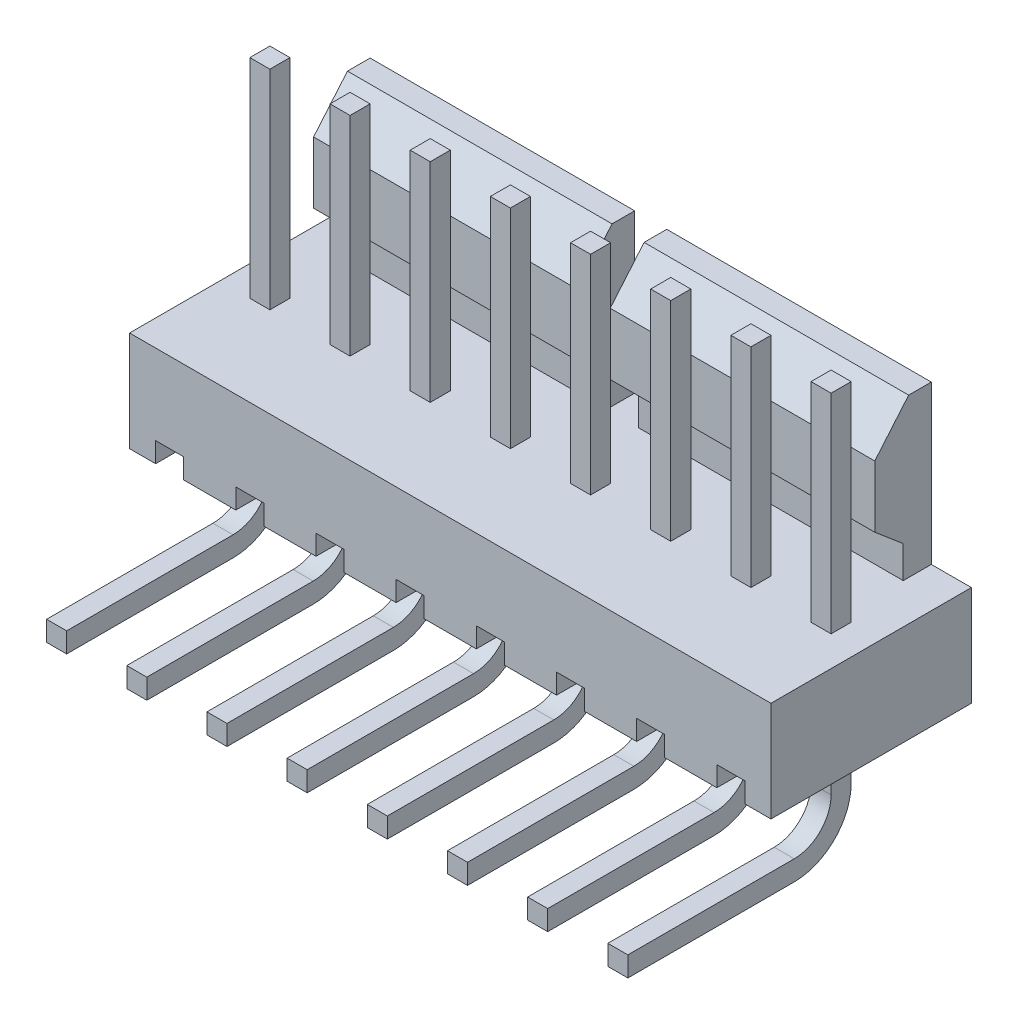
ISO-10303-21;
HEADER;
FILE_DESCRIPTION(('STEP AP214'),'2;1');
FILE_NAME('part.step','',(''),(''),'','','');
FILE_SCHEMA(('AUTOMOTIVE_DESIGN { 1 0 10303 214 1 1 1 1 }'));
ENDSEC;
DATA;
#1=APPLICATION_CONTEXT('core data for automotive mechanical design processes');
#2=APPLICATION_PROTOCOL_DEFINITION('international standard','automotive_design',2000,#1);
#3=PRODUCT_CONTEXT('',#1,'mechanical');
#4=PRODUCT('Part','Part','',(#3));
#5=PRODUCT_RELATED_PRODUCT_CATEGORY('part','',(#4));
#6=PRODUCT_DEFINITION_FORMATION('','',#4);
#7=PRODUCT_DEFINITION_CONTEXT('part definition',#1,'design');
#8=PRODUCT_DEFINITION('design','',#6,#7);
#9=PRODUCT_DEFINITION_SHAPE('','',#8);
#10=(LENGTH_UNIT() NAMED_UNIT(*) SI_UNIT(.MILLI.,.METRE.));
#11=(NAMED_UNIT(*) PLANE_ANGLE_UNIT() SI_UNIT($,.RADIAN.));
#12=(NAMED_UNIT(*) SI_UNIT($,.STERADIAN.) SOLID_ANGLE_UNIT());
#13=UNCERTAINTY_MEASURE_WITH_UNIT(LENGTH_MEASURE(1.E-05),#10,'distance_accuracy_value','');
#14=(GEOMETRIC_REPRESENTATION_CONTEXT(3) GLOBAL_UNCERTAINTY_ASSIGNED_CONTEXT((#13)) GLOBAL_UNIT_ASSIGNED_CONTEXT((#10,
#11,#12)) REPRESENTATION_CONTEXT('',''));
#15=CARTESIAN_POINT('',(0.,0.,0.));
#16=DIRECTION('',(0.,0.,1.));
#17=DIRECTION('',(1.,0.,0.));
#18=AXIS2_PLACEMENT_3D('',#15,#16,#17);
#19=CARTESIAN_POINT('',(0.9525,-2.8321,1.4859));
#20=DIRECTION('',(1.,0.,0.));
#21=DIRECTION('',(0.,0.,-1.));
#22=AXIS2_PLACEMENT_3D('',#19,#20,#21);
#23=CYLINDRICAL_SURFACE('',#22,1.1684);
#24=CARTESIAN_POINT('',(1.5875,-2.8321,1.4859));
#25=DIRECTION('',(1.,0.,0.));
#26=DIRECTION('',(0.,0.,-1.));
#27=AXIS2_PLACEMENT_3D('',#24,#25,#26);
#28=CIRCLE('',#27,1.1684);
#29=CARTESIAN_POINT('',(1.5875,-2.8321,0.3175));
#30=VERTEX_POINT('',#29);
#31=CARTESIAN_POINT('',(1.5875,-4.0005,1.4859));
#32=VERTEX_POINT('',#31);
#33=EDGE_CURVE('E912',#30,#32,#28,.F.);
#34=ORIENTED_EDGE('',*,*,#33,.F.);
#35=DIRECTION('',(1.,0.,0.));
#36=VECTOR('',#35,1.);
#37=CARTESIAN_POINT('',(0.9525,-2.8321,0.3175));
#38=LINE('',#37,#36);
#39=CARTESIAN_POINT('',(0.9525,-2.8321,0.3175));
#40=VERTEX_POINT('',#39);
#41=EDGE_CURVE('E908',#40,#30,#38,.T.);
#42=ORIENTED_EDGE('',*,*,#41,.F.);
#43=CARTESIAN_POINT('',(0.9525,-2.8321,1.4859));
#44=DIRECTION('',(1.,0.,0.));
#45=DIRECTION('',(0.,0.,-1.));
#46=AXIS2_PLACEMENT_3D('',#43,#44,#45);
#47=CIRCLE('',#46,1.1684);
#48=CARTESIAN_POINT('',(0.9525,-4.0005,1.4859));
#49=VERTEX_POINT('',#48);
#50=EDGE_CURVE('E20',#40,#49,#47,.F.);
#51=ORIENTED_EDGE('',*,*,#50,.T.);
#52=DIRECTION('',(1.,0.,0.));
#53=VECTOR('',#52,1.);
#54=CARTESIAN_POINT('',(0.9525,-4.0005,1.4859));
#55=LINE('',#54,#53);
#56=EDGE_CURVE('E917',#32,#49,#55,.F.);
#57=ORIENTED_EDGE('',*,*,#56,.F.);
#58=EDGE_LOOP('',(#34,#42,#51,#57));
#59=FACE_BOUND('',#58,.T.);
#60=ADVANCED_FACE('F17',(#59),#23,.F.);
#61=CARTESIAN_POINT('',(0.9525,-4.0005,1.4859));
#62=DIRECTION('',(0.,1.,0.));
#63=DIRECTION('',(0.,0.,1.));
#64=AXIS2_PLACEMENT_3D('',#61,#62,#63);
#65=PLANE('',#64);
#66=ORIENTED_EDGE('',*,*,#56,.T.);
#67=DIRECTION('',(0.,0.,-1.));
#68=VECTOR('',#67,1.);
#69=CARTESIAN_POINT('',(0.9525,-4.0005,3.175));
#70=LINE('',#69,#68);
#71=CARTESIAN_POINT('',(0.9525,-4.0005,6.7564));
#72=VERTEX_POINT('',#71);
#73=EDGE_CURVE('E928',#49,#72,#70,.F.);
#74=ORIENTED_EDGE('',*,*,#73,.T.);
#75=DIRECTION('',(1.,0.,0.));
#76=VECTOR('',#75,1.);
#77=CARTESIAN_POINT('',(0.9525,-4.0005,6.7564));
#78=LINE('',#77,#76);
#79=CARTESIAN_POINT('',(1.5875,-4.0005,6.7564));
#80=VERTEX_POINT('',#79);
#81=EDGE_CURVE('E1001',#80,#72,#78,.F.);
#82=ORIENTED_EDGE('',*,*,#81,.F.);
#83=DIRECTION('',(0.,0.,-1.));
#84=VECTOR('',#83,1.);
#85=CARTESIAN_POINT('',(1.5875,-4.0005,3.175));
#86=LINE('',#85,#84);
#87=EDGE_CURVE('E1008',#32,#80,#86,.F.);
#88=ORIENTED_EDGE('',*,*,#87,.F.);
#89=EDGE_LOOP('',(#66,#74,#82,#88));
#90=FACE_BOUND('',#89,.T.);
#91=ADVANCED_FACE('F1155',(#90),#65,.T.);
#92=CARTESIAN_POINT('',(0.9525,-4.0005,6.7564));
#93=DIRECTION('',(0.,0.,1.));
#94=DIRECTION('',(1.,0.,0.));
#95=AXIS2_PLACEMENT_3D('',#92,#93,#94);
#96=PLANE('',#95);
#97=ORIENTED_EDGE('',*,*,#81,.T.);
#98=DIRECTION('',(0.,1.,0.));
#99=VECTOR('',#98,1.);
#100=CARTESIAN_POINT('',(0.9525,-0.9525,6.7564));
#101=LINE('',#100,#99);
#102=CARTESIAN_POINT('',(0.9525,-4.6355,6.7564));
#103=VERTEX_POINT('',#102);
#104=EDGE_CURVE('E1016',#72,#103,#101,.F.);
#105=ORIENTED_EDGE('',*,*,#104,.T.);
#106=DIRECTION('',(1.,0.,0.));
#107=VECTOR('',#106,1.);
#108=CARTESIAN_POINT('',(0.9525,-4.6355,6.7564));
#109=LINE('',#108,#107);
#110=CARTESIAN_POINT('',(1.5875,-4.6355,6.7564));
#111=VERTEX_POINT('',#110);
#112=EDGE_CURVE('E998',#111,#103,#109,.F.);
#113=ORIENTED_EDGE('',*,*,#112,.F.);
#114=DIRECTION('',(0.,1.,0.));
#115=VECTOR('',#114,1.);
#116=CARTESIAN_POINT('',(1.5875,-0.9525,6.7564));
#117=LINE('',#116,#115);
#118=EDGE_CURVE('E1004',#80,#111,#117,.F.);
#119=ORIENTED_EDGE('',*,*,#118,.F.);
#120=EDGE_LOOP('',(#97,#105,#113,#119));
#121=FACE_BOUND('',#120,.T.);
#122=ADVANCED_FACE('F1159',(#121),#96,.T.);
#123=CARTESIAN_POINT('',(0.9525,-4.6355,6.7564));
#124=DIRECTION('',(0.,-1.,0.));
#125=DIRECTION('',(0.,0.,-1.));
#126=AXIS2_PLACEMENT_3D('',#123,#124,#125);
#127=PLANE('',#126);
#128=ORIENTED_EDGE('',*,*,#112,.T.);
#129=DIRECTION('',(0.,0.,-1.));
#130=VECTOR('',#129,1.);
#131=CARTESIAN_POINT('',(0.9525,-4.6355,3.175));
#132=LINE('',#131,#130);
#133=CARTESIAN_POINT('',(0.9525,-4.6355,1.4859));
#134=VERTEX_POINT('',#133);
#135=EDGE_CURVE('E1018',#103,#134,#132,.T.);
#136=ORIENTED_EDGE('',*,*,#135,.T.);
#137=DIRECTION('',(1.,0.,0.));
#138=VECTOR('',#137,1.);
#139=CARTESIAN_POINT('',(0.9525,-4.6355,1.4859));
#140=LINE('',#139,#138);
#141=CARTESIAN_POINT('',(1.5875,-4.6355,1.4859));
#142=VERTEX_POINT('',#141);
#143=EDGE_CURVE('E992',#142,#134,#140,.F.);
#144=ORIENTED_EDGE('',*,*,#143,.F.);
#145=DIRECTION('',(0.,0.,-1.));
#146=VECTOR('',#145,1.);
#147=CARTESIAN_POINT('',(1.5875,-4.6355,3.175));
#148=LINE('',#147,#146);
#149=EDGE_CURVE('E1007',#111,#142,#148,.T.);
#150=ORIENTED_EDGE('',*,*,#149,.F.);
#151=EDGE_LOOP('',(#128,#136,#144,#150));
#152=FACE_BOUND('',#151,.T.);
#153=ADVANCED_FACE('F2579',(#152),#127,.T.);
#154=CARTESIAN_POINT('',(0.9525,-2.8321,1.4859));
#155=DIRECTION('',(1.,0.,0.));
#156=DIRECTION('',(0.,0.,-1.));
#157=AXIS2_PLACEMENT_3D('',#154,#155,#156);
#158=CYLINDRICAL_SURFACE('',#157,1.8034);
#159=CARTESIAN_POINT('',(1.5875,-2.8321,1.4859));
#160=DIRECTION('',(1.,0.,0.));
#161=DIRECTION('',(0.,0.,-1.));
#162=AXIS2_PLACEMENT_3D('',#159,#160,#161);
#163=CIRCLE('',#162,1.8034);
#164=CARTESIAN_POINT('',(1.5875,-2.8321,-0.3175));
#165=VERTEX_POINT('',#164);
#166=EDGE_CURVE('E1138',#142,#165,#163,.T.);
#167=ORIENTED_EDGE('',*,*,#166,.F.);
#168=ORIENTED_EDGE('',*,*,#143,.T.);
#169=CARTESIAN_POINT('',(0.9525,-2.8321,1.4859));
#170=DIRECTION('',(1.,0.,0.));
#171=DIRECTION('',(0.,0.,-1.));
#172=AXIS2_PLACEMENT_3D('',#169,#170,#171);
#173=CIRCLE('',#172,1.8034);
#174=CARTESIAN_POINT('',(0.9525,-2.8321,-0.3175));
#175=VERTEX_POINT('',#174);
#176=EDGE_CURVE('E1143',#134,#175,#173,.T.);
#177=ORIENTED_EDGE('',*,*,#176,.T.);
#178=DIRECTION('',(-1.,0.,0.));
#179=VECTOR('',#178,1.);
#180=CARTESIAN_POINT('',(0.9525,-2.8321,-0.3175));
#181=LINE('',#180,#179);
#182=EDGE_CURVE('E989',#165,#175,#181,.T.);
#183=ORIENTED_EDGE('',*,*,#182,.F.);
#184=EDGE_LOOP('',(#167,#168,#177,#183));
#185=FACE_BOUND('',#184,.T.);
#186=ADVANCED_FACE('F1168',(#185),#158,.T.);
#187=CARTESIAN_POINT('',(0.9525,-2.8321,-0.3175));
#188=DIRECTION('',(0.,0.,-1.));
#189=DIRECTION('',(-1.,0.,0.));
#190=AXIS2_PLACEMENT_3D('',#187,#188,#189);
#191=PLANE('',#190);
#192=DIRECTION('',(0.,1.,0.));
#193=VECTOR('',#192,1.);
#194=CARTESIAN_POINT('',(0.9525,-0.9525,-0.3175));
#195=LINE('',#194,#193);
#196=CARTESIAN_POINT('',(0.9525,-0.9525,-0.3175));
#197=VERTEX_POINT('',#196);
#198=EDGE_CURVE('E1142',#175,#197,#195,.T.);
#199=ORIENTED_EDGE('',*,*,#198,.T.);
#200=DIRECTION('',(-1.,0.,0.));
#201=VECTOR('',#200,1.);
#202=CARTESIAN_POINT('',(0.9525,-0.9525,-0.3175));
#203=LINE('',#202,#201);
#204=CARTESIAN_POINT('',(1.5875,-0.9525,-0.3175));
#205=VERTEX_POINT('',#204);
#206=EDGE_CURVE('E982',#197,#205,#203,.F.);
#207=ORIENTED_EDGE('',*,*,#206,.T.);
#208=DIRECTION('',(0.,1.,0.));
#209=VECTOR('',#208,1.);
#210=CARTESIAN_POINT('',(1.5875,-0.9525,-0.3175));
#211=LINE('',#210,#209);
#212=EDGE_CURVE('E1141',#165,#205,#211,.T.);
#213=ORIENTED_EDGE('',*,*,#212,.F.);
#214=ORIENTED_EDGE('',*,*,#182,.T.);
#215=EDGE_LOOP('',(#199,#207,#213,#214));
#216=FACE_BOUND('',#215,.T.);
#217=ADVANCED_FACE('F1163',(#216),#191,.T.);
#218=CARTESIAN_POINT('',(-1.5875,-2.8321,1.4859));
#219=DIRECTION('',(1.,0.,0.));
#220=DIRECTION('',(0.,0.,-1.));
#221=AXIS2_PLACEMENT_3D('',#218,#219,#220);
#222=CYLINDRICAL_SURFACE('',#221,1.1684);
#223=CARTESIAN_POINT('',(-0.9525,-2.8321,1.4859));
#224=DIRECTION('',(1.,0.,0.));
#225=DIRECTION('',(0.,0.,-1.));
#226=AXIS2_PLACEMENT_3D('',#223,#224,#225);
#227=CIRCLE('',#226,1.1684);
#228=CARTESIAN_POINT('',(-0.9525,-2.8321,0.3175));
#229=VERTEX_POINT('',#228);
#230=CARTESIAN_POINT('',(-0.9525,-4.0005,1.4859));
#231=VERTEX_POINT('',#230);
#232=EDGE_CURVE('E1129',#229,#231,#227,.F.);
#233=ORIENTED_EDGE('',*,*,#232,.F.);
#234=DIRECTION('',(1.,0.,0.));
#235=VECTOR('',#234,1.);
#236=CARTESIAN_POINT('',(-1.5875,-2.8321,0.3175));
#237=LINE('',#236,#235);
#238=CARTESIAN_POINT('',(-1.5875,-2.8321,0.3175));
#239=VERTEX_POINT('',#238);
#240=EDGE_CURVE('E980',#239,#229,#237,.T.);
#241=ORIENTED_EDGE('',*,*,#240,.F.);
#242=CARTESIAN_POINT('',(-1.5875,-2.8321,1.4859));
#243=DIRECTION('',(1.,0.,0.));
#244=DIRECTION('',(0.,0.,-1.));
#245=AXIS2_PLACEMENT_3D('',#242,#243,#244);
#246=CIRCLE('',#245,1.1684);
#247=CARTESIAN_POINT('',(-1.5875,-4.0005,1.4859));
#248=VERTEX_POINT('',#247);
#249=EDGE_CURVE('E1135',#239,#248,#246,.F.);
#250=ORIENTED_EDGE('',*,*,#249,.T.);
#251=DIRECTION('',(1.,0.,0.));
#252=VECTOR('',#251,1.);
#253=CARTESIAN_POINT('',(-1.5875,-4.0005,1.4859));
#254=LINE('',#253,#252);
#255=EDGE_CURVE('E975',#231,#248,#254,.F.);
#256=ORIENTED_EDGE('',*,*,#255,.F.);
#257=EDGE_LOOP('',(#233,#241,#250,#256));
#258=FACE_BOUND('',#257,.T.);
#259=ADVANCED_FACE('F2558',(#258),#222,.F.);
#260=CARTESIAN_POINT('',(-1.5875,-4.0005,1.4859));
#261=DIRECTION('',(0.,1.,0.));
#262=DIRECTION('',(0.,0.,1.));
#263=AXIS2_PLACEMENT_3D('',#260,#261,#262);
#264=PLANE('',#263);
#265=ORIENTED_EDGE('',*,*,#255,.T.);
#266=DIRECTION('',(0.,0.,-1.));
#267=VECTOR('',#266,1.);
#268=CARTESIAN_POINT('',(-1.5875,-4.0005,3.175));
#269=LINE('',#268,#267);
#270=CARTESIAN_POINT('',(-1.5875,-4.0005,6.7564));
#271=VERTEX_POINT('',#270);
#272=EDGE_CURVE('E986',#248,#271,#269,.F.);
#273=ORIENTED_EDGE('',*,*,#272,.T.);
#274=DIRECTION('',(1.,0.,0.));
#275=VECTOR('',#274,1.);
#276=CARTESIAN_POINT('',(-1.5875,-4.0005,6.7564));
#277=LINE('',#276,#275);
#278=CARTESIAN_POINT('',(-0.9525,-4.0005,6.7564));
#279=VERTEX_POINT('',#278);
#280=EDGE_CURVE('E963',#279,#271,#277,.F.);
#281=ORIENTED_EDGE('',*,*,#280,.F.);
#282=DIRECTION('',(0.,0.,-1.));
#283=VECTOR('',#282,1.);
#284=CARTESIAN_POINT('',(-0.9525,-4.0005,3.175));
#285=LINE('',#284,#283);
#286=EDGE_CURVE('E970',#231,#279,#285,.F.);
#287=ORIENTED_EDGE('',*,*,#286,.F.);
#288=EDGE_LOOP('',(#265,#273,#281,#287));
#289=FACE_BOUND('',#288,.T.);
#290=ADVANCED_FACE('F2550',(#289),#264,.T.);
#291=CARTESIAN_POINT('',(-1.5875,-4.0005,6.7564));
#292=DIRECTION('',(0.,0.,1.));
#293=DIRECTION('',(1.,0.,0.));
#294=AXIS2_PLACEMENT_3D('',#291,#292,#293);
#295=PLANE('',#294);
#296=ORIENTED_EDGE('',*,*,#280,.T.);
#297=DIRECTION('',(0.,1.,0.));
#298=VECTOR('',#297,1.);
#299=CARTESIAN_POINT('',(-1.5875,-0.9525,6.7564));
#300=LINE('',#299,#298);
#301=CARTESIAN_POINT('',(-1.5875,-4.6355,6.7564));
#302=VERTEX_POINT('',#301);
#303=EDGE_CURVE('E983',#271,#302,#300,.F.);
#304=ORIENTED_EDGE('',*,*,#303,.T.);
#305=DIRECTION('',(1.,0.,0.));
#306=VECTOR('',#305,1.);
#307=CARTESIAN_POINT('',(-1.5875,-4.6355,6.7564));
#308=LINE('',#307,#306);
#309=CARTESIAN_POINT('',(-0.9525,-4.6355,6.7564));
#310=VERTEX_POINT('',#309);
#311=EDGE_CURVE('E960',#310,#302,#308,.F.);
#312=ORIENTED_EDGE('',*,*,#311,.F.);
#313=DIRECTION('',(0.,1.,0.));
#314=VECTOR('',#313,1.);
#315=CARTESIAN_POINT('',(-0.9525,-0.9525,6.7564));
#316=LINE('',#315,#314);
#317=EDGE_CURVE('E966',#279,#310,#316,.F.);
#318=ORIENTED_EDGE('',*,*,#317,.F.);
#319=EDGE_LOOP('',(#296,#304,#312,#318));
#320=FACE_BOUND('',#319,.T.);
#321=ADVANCED_FACE('F2542',(#320),#295,.T.);
#322=CARTESIAN_POINT('',(-1.5875,-4.6355,6.7564));
#323=DIRECTION('',(0.,-1.,0.));
#324=DIRECTION('',(0.,0.,-1.));
#325=AXIS2_PLACEMENT_3D('',#322,#323,#324);
#326=PLANE('',#325);
#327=ORIENTED_EDGE('',*,*,#311,.T.);
#328=DIRECTION('',(0.,0.,-1.));
#329=VECTOR('',#328,1.);
#330=CARTESIAN_POINT('',(-1.5875,-4.6355,3.175));
#331=LINE('',#330,#329);
#332=CARTESIAN_POINT('',(-1.5875,-4.6355,1.4859));
#333=VERTEX_POINT('',#332);
#334=EDGE_CURVE('E985',#302,#333,#331,.T.);
#335=ORIENTED_EDGE('',*,*,#334,.T.);
#336=DIRECTION('',(1.,0.,0.));
#337=VECTOR('',#336,1.);
#338=CARTESIAN_POINT('',(-1.5875,-4.6355,1.4859));
#339=LINE('',#338,#337);
#340=CARTESIAN_POINT('',(-0.9525,-4.6355,1.4859));
#341=VERTEX_POINT('',#340);
#342=EDGE_CURVE('E954',#341,#333,#339,.F.);
#343=ORIENTED_EDGE('',*,*,#342,.F.);
#344=DIRECTION('',(0.,0.,-1.));
#345=VECTOR('',#344,1.);
#346=CARTESIAN_POINT('',(-0.9525,-4.6355,3.175));
#347=LINE('',#346,#345);
#348=EDGE_CURVE('E969',#310,#341,#347,.T.);
#349=ORIENTED_EDGE('',*,*,#348,.F.);
#350=EDGE_LOOP('',(#327,#335,#343,#349));
#351=FACE_BOUND('',#350,.T.);
#352=ADVANCED_FACE('F2534',(#351),#326,.T.);
#353=CARTESIAN_POINT('',(-1.5875,-2.8321,1.4859));
#354=DIRECTION('',(1.,0.,0.));
#355=DIRECTION('',(0.,0.,-1.));
#356=AXIS2_PLACEMENT_3D('',#353,#354,#355);
#357=CYLINDRICAL_SURFACE('',#356,1.8034);
#358=CARTESIAN_POINT('',(-0.9525,-2.8321,1.4859));
#359=DIRECTION('',(1.,0.,0.));
#360=DIRECTION('',(0.,0.,-1.));
#361=AXIS2_PLACEMENT_3D('',#358,#359,#360);
#362=CIRCLE('',#361,1.8034);
#363=CARTESIAN_POINT('',(-0.9525,-2.8321,-0.3175));
#364=VERTEX_POINT('',#363);
#365=EDGE_CURVE('E1125',#341,#364,#362,.T.);
#366=ORIENTED_EDGE('',*,*,#365,.F.);
#367=ORIENTED_EDGE('',*,*,#342,.T.);
#368=CARTESIAN_POINT('',(-1.5875,-2.8321,1.4859));
#369=DIRECTION('',(1.,0.,0.));
#370=DIRECTION('',(0.,0.,-1.));
#371=AXIS2_PLACEMENT_3D('',#368,#369,#370);
#372=CIRCLE('',#371,1.8034);
#373=CARTESIAN_POINT('',(-1.5875,-2.8321,-0.3175));
#374=VERTEX_POINT('',#373);
#375=EDGE_CURVE('E1133',#333,#374,#372,.T.);
#376=ORIENTED_EDGE('',*,*,#375,.T.);
#377=DIRECTION('',(-1.,0.,0.));
#378=VECTOR('',#377,1.);
#379=CARTESIAN_POINT('',(-1.5875,-2.8321,-0.3175));
#380=LINE('',#379,#378);
#381=EDGE_CURVE('E951',#364,#374,#380,.T.);
#382=ORIENTED_EDGE('',*,*,#381,.F.);
#383=EDGE_LOOP('',(#366,#367,#376,#382));
#384=FACE_BOUND('',#383,.T.);
#385=ADVANCED_FACE('F2526',(#384),#357,.T.);
#386=CARTESIAN_POINT('',(-1.5875,-2.8321,-0.3175));
#387=DIRECTION('',(0.,0.,-1.));
#388=DIRECTION('',(-1.,0.,0.));
#389=AXIS2_PLACEMENT_3D('',#386,#387,#388);
#390=PLANE('',#389);
#391=DIRECTION('',(0.,1.,0.));
#392=VECTOR('',#391,1.);
#393=CARTESIAN_POINT('',(-1.5875,-0.9525,-0.3175));
#394=LINE('',#393,#392);
#395=CARTESIAN_POINT('',(-1.5875,-0.9525,-0.3175));
#396=VERTEX_POINT('',#395);
#397=EDGE_CURVE('E1132',#374,#396,#394,.T.);
#398=ORIENTED_EDGE('',*,*,#397,.T.);
#399=DIRECTION('',(-1.,0.,0.));
#400=VECTOR('',#399,1.);
#401=CARTESIAN_POINT('',(-1.5875,-0.9525,-0.3175));
#402=LINE('',#401,#400);
#403=CARTESIAN_POINT('',(-0.9525,-0.9525,-0.3175));
#404=VERTEX_POINT('',#403);
#405=EDGE_CURVE('E948',#396,#404,#402,.F.);
#406=ORIENTED_EDGE('',*,*,#405,.T.);
#407=DIRECTION('',(0.,1.,0.));
#408=VECTOR('',#407,1.);
#409=CARTESIAN_POINT('',(-0.9525,-0.9525,-0.3175));
#410=LINE('',#409,#408);
#411=EDGE_CURVE('E1128',#364,#404,#410,.T.);
#412=ORIENTED_EDGE('',*,*,#411,.F.);
#413=ORIENTED_EDGE('',*,*,#381,.T.);
#414=EDGE_LOOP('',(#398,#406,#412,#413));
#415=FACE_BOUND('',#414,.T.);
#416=ADVANCED_FACE('F2519',(#415),#390,.T.);
#417=CARTESIAN_POINT('',(0.9525,-0.9525,3.175));
#418=DIRECTION('',(1.,0.,0.));
#419=DIRECTION('',(0.,0.,-1.));
#420=AXIS2_PLACEMENT_3D('',#417,#418,#419);
#421=PLANE('',#420);
#422=ORIENTED_EDGE('',*,*,#176,.F.);
#423=ORIENTED_EDGE('',*,*,#135,.F.);
#424=ORIENTED_EDGE('',*,*,#104,.F.);
#425=ORIENTED_EDGE('',*,*,#73,.F.);
#426=ORIENTED_EDGE('',*,*,#50,.F.);
#427=DIRECTION('',(0.,1.,0.));
#428=VECTOR('',#427,1.);
#429=CARTESIAN_POINT('',(0.9525,-0.9525,0.3175));
#430=LINE('',#429,#428);
#431=CARTESIAN_POINT('',(0.9525,-0.9525,0.3175));
#432=VERTEX_POINT('',#431);
#433=EDGE_CURVE('E925',#432,#40,#430,.F.);
#434=ORIENTED_EDGE('',*,*,#433,.F.);
#435=DIRECTION('',(0.,0.,-1.));
#436=VECTOR('',#435,1.);
#437=CARTESIAN_POINT('',(0.9525,-0.9525,3.175));
#438=LINE('',#437,#436);
#439=EDGE_CURVE('E929',#197,#432,#438,.F.);
#440=ORIENTED_EDGE('',*,*,#439,.F.);
#441=ORIENTED_EDGE('',*,*,#198,.F.);
#442=EDGE_LOOP('',(#422,#423,#424,#425,#426,#434,#440,#441));
#443=FACE_BOUND('',#442,.T.);
#444=ADVANCED_FACE('F923',(#443),#421,.F.);
#445=CARTESIAN_POINT('',(1.5875,-0.9525,3.175));
#446=DIRECTION('',(1.,0.,0.));
#447=DIRECTION('',(0.,0.,-1.));
#448=AXIS2_PLACEMENT_3D('',#445,#446,#447);
#449=PLANE('',#448);
#450=ORIENTED_EDGE('',*,*,#212,.T.);
#451=DIRECTION('',(0.,0.,-1.));
#452=VECTOR('',#451,1.);
#453=CARTESIAN_POINT('',(1.5875,-0.9525,3.175));
#454=LINE('',#453,#452);
#455=CARTESIAN_POINT('',(1.5875,-0.9525,0.3175));
#456=VERTEX_POINT('',#455);
#457=EDGE_CURVE('E1185',#205,#456,#454,.F.);
#458=ORIENTED_EDGE('',*,*,#457,.T.);
#459=DIRECTION('',(0.,1.,0.));
#460=VECTOR('',#459,1.);
#461=CARTESIAN_POINT('',(1.5875,-0.9525,0.3175));
#462=LINE('',#461,#460);
#463=EDGE_CURVE('E933',#30,#456,#462,.T.);
#464=ORIENTED_EDGE('',*,*,#463,.F.);
#465=ORIENTED_EDGE('',*,*,#33,.T.);
#466=ORIENTED_EDGE('',*,*,#87,.T.);
#467=ORIENTED_EDGE('',*,*,#118,.T.);
#468=ORIENTED_EDGE('',*,*,#149,.T.);
#469=ORIENTED_EDGE('',*,*,#166,.T.);
#470=EDGE_LOOP('',(#450,#458,#464,#465,#466,#467,#468,#469));
#471=FACE_BOUND('',#470,.T.);
#472=ADVANCED_FACE('F1172',(#471),#449,.T.);
#473=CARTESIAN_POINT('',(-10.16,-1.5875,3.175));
#474=DIRECTION('',(0.,-1.,0.));
#475=DIRECTION('',(0.,0.,-1.));
#476=AXIS2_PLACEMENT_3D('',#473,#474,#475);
#477=PLANE('',#476);
#478=DIRECTION('',(1.,0.,0.));
#479=VECTOR('',#478,1.);
#480=CARTESIAN_POINT('',(-10.16,-1.5875,-3.175));
#481=LINE('',#480,#479);
#482=CARTESIAN_POINT('',(-0.8255,-1.5875,-3.175));
#483=VERTEX_POINT('',#482);
#484=CARTESIAN_POINT('',(0.8255,-1.5875,-3.175));
#485=VERTEX_POINT('',#484);
#486=EDGE_CURVE('E1262',#483,#485,#481,.T.);
#487=ORIENTED_EDGE('',*,*,#486,.T.);
#488=DIRECTION('',(0.,0.,1.));
#489=VECTOR('',#488,1.);
#490=CARTESIAN_POINT('',(0.8255,-1.5875,3.175));
#491=LINE('',#490,#489);
#492=CARTESIAN_POINT('',(0.8255,-1.5875,3.175));
#493=VERTEX_POINT('',#492);
#494=EDGE_CURVE('E1217',#485,#493,#491,.T.);
#495=ORIENTED_EDGE('',*,*,#494,.T.);
#496=DIRECTION('',(1.,0.,0.));
#497=VECTOR('',#496,1.);
#498=CARTESIAN_POINT('',(-10.16,-1.5875,3.175));
#499=LINE('',#498,#497);
#500=CARTESIAN_POINT('',(-0.8255,-1.5875,3.175));
#501=VERTEX_POINT('',#500);
#502=EDGE_CURVE('E1187',#493,#501,#499,.F.);
#503=ORIENTED_EDGE('',*,*,#502,.T.);
#504=DIRECTION('',(0.,0.,-1.));
#505=VECTOR('',#504,1.);
#506=CARTESIAN_POINT('',(-0.8255,-1.5875,3.175));
#507=LINE('',#506,#505);
#508=EDGE_CURVE('E936',#501,#483,#507,.T.);
#509=ORIENTED_EDGE('',*,*,#508,.T.);
#510=EDGE_LOOP('',(#487,#495,#503,#509));
#511=FACE_BOUND('',#510,.T.);
#512=ADVANCED_FACE('F1319',(#511),#477,.T.);
#513=CARTESIAN_POINT('',(-1.5875,-0.9525,3.175));
#514=DIRECTION('',(1.,0.,0.));
#515=DIRECTION('',(0.,0.,-1.));
#516=AXIS2_PLACEMENT_3D('',#513,#514,#515);
#517=PLANE('',#516);
#518=ORIENTED_EDGE('',*,*,#375,.F.);
#519=ORIENTED_EDGE('',*,*,#334,.F.);
#520=ORIENTED_EDGE('',*,*,#303,.F.);
#521=ORIENTED_EDGE('',*,*,#272,.F.);
#522=ORIENTED_EDGE('',*,*,#249,.F.);
#523=DIRECTION('',(0.,1.,0.));
#524=VECTOR('',#523,1.);
#525=CARTESIAN_POINT('',(-1.5875,-0.9525,0.3175));
#526=LINE('',#525,#524);
#527=CARTESIAN_POINT('',(-1.5875,-0.9525,0.3175));
#528=VERTEX_POINT('',#527);
#529=EDGE_CURVE('E1211',#528,#239,#526,.F.);
#530=ORIENTED_EDGE('',*,*,#529,.F.);
#531=DIRECTION('',(0.,0.,-1.));
#532=VECTOR('',#531,1.);
#533=CARTESIAN_POINT('',(-1.5875,-0.9525,3.175));
#534=LINE('',#533,#532);
#535=EDGE_CURVE('E1137',#396,#528,#534,.F.);
#536=ORIENTED_EDGE('',*,*,#535,.F.);
#537=ORIENTED_EDGE('',*,*,#397,.F.);
#538=EDGE_LOOP('',(#518,#519,#520,#521,#522,#530,#536,#537));
#539=FACE_BOUND('',#538,.T.);
#540=ADVANCED_FACE('F1332',(#539),#517,.F.);
#541=CARTESIAN_POINT('',(-0.9525,-0.9525,3.175));
#542=DIRECTION('',(1.,0.,0.));
#543=DIRECTION('',(0.,0.,-1.));
#544=AXIS2_PLACEMENT_3D('',#541,#542,#543);
#545=PLANE('',#544);
#546=ORIENTED_EDGE('',*,*,#411,.T.);
#547=DIRECTION('',(0.,0.,-1.));
#548=VECTOR('',#547,1.);
#549=CARTESIAN_POINT('',(-0.9525,-0.9525,3.175));
#550=LINE('',#549,#548);
#551=CARTESIAN_POINT('',(-0.9525,-0.9525,0.3175));
#552=VERTEX_POINT('',#551);
#553=EDGE_CURVE('E1220',#404,#552,#550,.F.);
#554=ORIENTED_EDGE('',*,*,#553,.T.);
#555=DIRECTION('',(0.,1.,0.));
#556=VECTOR('',#555,1.);
#557=CARTESIAN_POINT('',(-0.9525,-0.9525,0.3175));
#558=LINE('',#557,#556);
#559=EDGE_CURVE('E1207',#229,#552,#558,.T.);
#560=ORIENTED_EDGE('',*,*,#559,.F.);
#561=ORIENTED_EDGE('',*,*,#232,.T.);
#562=ORIENTED_EDGE('',*,*,#286,.T.);
#563=ORIENTED_EDGE('',*,*,#317,.T.);
#564=ORIENTED_EDGE('',*,*,#348,.T.);
#565=ORIENTED_EDGE('',*,*,#365,.T.);
#566=EDGE_LOOP('',(#546,#554,#560,#561,#562,#563,#564,#565));
#567=FACE_BOUND('',#566,.T.);
#568=ADVANCED_FACE('F1324',(#567),#545,.T.);
#569=CARTESIAN_POINT('',(0.8255,-0.9525,3.175));
#570=DIRECTION('',(-1.,0.,0.));
#571=DIRECTION('',(0.,0.,1.));
#572=AXIS2_PLACEMENT_3D('',#569,#570,#571);
#573=PLANE('',#572);
#574=DIRECTION('',(0.,0.,1.));
#575=VECTOR('',#574,1.);
#576=CARTESIAN_POINT('',(0.8255,-0.9525,3.175));
#577=LINE('',#576,#575);
#578=CARTESIAN_POINT('',(0.8255,-0.9525,-3.175));
#579=VERTEX_POINT('',#578);
#580=CARTESIAN_POINT('',(0.8255,-0.9525,3.175));
#581=VERTEX_POINT('',#580);
#582=EDGE_CURVE('E1196',#579,#581,#577,.T.);
#583=ORIENTED_EDGE('',*,*,#582,.T.);
#584=DIRECTION('',(0.,1.,0.));
#585=VECTOR('',#584,1.);
#586=CARTESIAN_POINT('',(0.8255,-0.9525,3.175));
#587=LINE('',#586,#585);
#588=EDGE_CURVE('E939',#493,#581,#587,.T.);
#589=ORIENTED_EDGE('',*,*,#588,.F.);
#590=ORIENTED_EDGE('',*,*,#494,.F.);
#591=DIRECTION('',(0.,1.,0.));
#592=VECTOR('',#591,1.);
#593=CARTESIAN_POINT('',(0.8255,-0.9525,-3.175));
#594=LINE('',#593,#592);
#595=EDGE_CURVE('E934',#579,#485,#594,.F.);
#596=ORIENTED_EDGE('',*,*,#595,.F.);
#597=EDGE_LOOP('',(#583,#589,#590,#596));
#598=FACE_BOUND('',#597,.T.);
#599=ADVANCED_FACE('F1322',(#598),#573,.F.);
#600=CARTESIAN_POINT('',(0.9525,-0.9525,0.3175));
#601=DIRECTION('',(0.,0.,1.));
#602=DIRECTION('',(1.,0.,0.));
#603=AXIS2_PLACEMENT_3D('',#600,#601,#602);
#604=PLANE('',#603);
#605=ORIENTED_EDGE('',*,*,#463,.T.);
#606=DIRECTION('',(1.,0.,0.));
#607=VECTOR('',#606,1.);
#608=CARTESIAN_POINT('',(1.7145,-0.9525,0.3175));
#609=LINE('',#608,#607);
#610=EDGE_CURVE('E932',#456,#432,#609,.F.);
#611=ORIENTED_EDGE('',*,*,#610,.T.);
#612=ORIENTED_EDGE('',*,*,#433,.T.);
#613=ORIENTED_EDGE('',*,*,#41,.T.);
#614=EDGE_LOOP('',(#605,#611,#612,#613));
#615=FACE_BOUND('',#614,.T.);
#616=ADVANCED_FACE('F930',(#615),#604,.T.);
#617=CARTESIAN_POINT('',(-0.8255,-1.5875,3.175));
#618=DIRECTION('',(1.,0.,0.));
#619=DIRECTION('',(0.,0.,-1.));
#620=AXIS2_PLACEMENT_3D('',#617,#618,#619);
#621=PLANE('',#620);
#622=DIRECTION('',(0.,0.,1.));
#623=VECTOR('',#622,1.);
#624=CARTESIAN_POINT('',(-0.8255,-0.9525,3.175));
#625=LINE('',#624,#623);
#626=CARTESIAN_POINT('',(-0.8255,-0.9525,3.175));
#627=VERTEX_POINT('',#626);
#628=CARTESIAN_POINT('',(-0.8255,-0.9525,-3.175));
#629=VERTEX_POINT('',#628);
#630=EDGE_CURVE('E1244',#627,#629,#625,.F.);
#631=ORIENTED_EDGE('',*,*,#630,.T.);
#632=DIRECTION('',(0.,1.,0.));
#633=VECTOR('',#632,1.);
#634=CARTESIAN_POINT('',(-0.8255,-1.5875,-3.175));
#635=LINE('',#634,#633);
#636=EDGE_CURVE('E1212',#483,#629,#635,.T.);
#637=ORIENTED_EDGE('',*,*,#636,.F.);
#638=ORIENTED_EDGE('',*,*,#508,.F.);
#639=DIRECTION('',(0.,1.,0.));
#640=VECTOR('',#639,1.);
#641=CARTESIAN_POINT('',(-0.8255,-1.5875,3.175));
#642=LINE('',#641,#640);
#643=EDGE_CURVE('E1208',#627,#501,#642,.F.);
#644=ORIENTED_EDGE('',*,*,#643,.F.);
#645=EDGE_LOOP('',(#631,#637,#638,#644));
#646=FACE_BOUND('',#645,.T.);
#647=ADVANCED_FACE('F1307',(#646),#621,.F.);
#648=CARTESIAN_POINT('',(-1.5875,-0.9525,0.3175));
#649=DIRECTION('',(0.,0.,1.));
#650=DIRECTION('',(1.,0.,0.));
#651=AXIS2_PLACEMENT_3D('',#648,#649,#650);
#652=PLANE('',#651);
#653=ORIENTED_EDGE('',*,*,#559,.T.);
#654=DIRECTION('',(1.,0.,0.));
#655=VECTOR('',#654,1.);
#656=CARTESIAN_POINT('',(-0.8255,-0.9525,0.3175));
#657=LINE('',#656,#655);
#658=EDGE_CURVE('E1240',#552,#528,#657,.F.);
#659=ORIENTED_EDGE('',*,*,#658,.T.);
#660=ORIENTED_EDGE('',*,*,#529,.T.);
#661=ORIENTED_EDGE('',*,*,#240,.T.);
#662=EDGE_LOOP('',(#653,#659,#660,#661));
#663=FACE_BOUND('',#662,.T.);
#664=ADVANCED_FACE('F1271',(#663),#652,.T.);
#665=CARTESIAN_POINT('',(1.7145,-0.9525,3.175));
#666=DIRECTION('',(0.,1.,0.));
#667=DIRECTION('',(0.,0.,1.));
#668=AXIS2_PLACEMENT_3D('',#665,#666,#667);
#669=PLANE('',#668);
#670=ORIENTED_EDGE('',*,*,#457,.F.);
#671=ORIENTED_EDGE('',*,*,#206,.F.);
#672=ORIENTED_EDGE('',*,*,#439,.T.);
#673=ORIENTED_EDGE('',*,*,#610,.F.);
#674=EDGE_LOOP('',(#670,#671,#672,#673));
#675=FACE_BOUND('',#674,.T.);
#676=DIRECTION('',(1.,0.,0.));
#677=VECTOR('',#676,1.);
#678=CARTESIAN_POINT('',(1.7145,-0.9525,3.175));
#679=LINE('',#678,#677);
#680=CARTESIAN_POINT('',(1.7145,-0.9525,3.175));
#681=VERTEX_POINT('',#680);
#682=EDGE_CURVE('E1192',#581,#681,#679,.T.);
#683=ORIENTED_EDGE('',*,*,#682,.F.);
#684=ORIENTED_EDGE('',*,*,#582,.F.);
#685=DIRECTION('',(1.,0.,0.));
#686=VECTOR('',#685,1.);
#687=CARTESIAN_POINT('',(1.7145,-0.9525,-3.175));
#688=LINE('',#687,#686);
#689=CARTESIAN_POINT('',(1.7145,-0.9525,-3.175));
#690=VERTEX_POINT('',#689);
#691=EDGE_CURVE('E1202',#690,#579,#688,.F.);
#692=ORIENTED_EDGE('',*,*,#691,.F.);
#693=DIRECTION('',(0.,0.,-1.));
#694=VECTOR('',#693,1.);
#695=CARTESIAN_POINT('',(1.7145,-0.9525,3.175));
#696=LINE('',#695,#694);
#697=EDGE_CURVE('E1276',#690,#681,#696,.F.);
#698=ORIENTED_EDGE('',*,*,#697,.T.);
#699=EDGE_LOOP('',(#683,#684,#692,#698));
#700=FACE_BOUND('',#699,.T.);
#701=ADVANCED_FACE('F1267',(#675,#700),#669,.F.);
#702=CARTESIAN_POINT('',(-0.8255,-0.9525,3.175));
#703=DIRECTION('',(0.,1.,0.));
#704=DIRECTION('',(0.,0.,1.));
#705=AXIS2_PLACEMENT_3D('',#702,#703,#704);
#706=PLANE('',#705);
#707=ORIENTED_EDGE('',*,*,#553,.F.);
#708=ORIENTED_EDGE('',*,*,#405,.F.);
#709=ORIENTED_EDGE('',*,*,#535,.T.);
#710=ORIENTED_EDGE('',*,*,#658,.F.);
#711=EDGE_LOOP('',(#707,#708,#709,#710));
#712=FACE_BOUND('',#711,.T.);
#713=DIRECTION('',(1.,0.,0.));
#714=VECTOR('',#713,1.);
#715=CARTESIAN_POINT('',(-0.8255,-0.9525,3.175));
#716=LINE('',#715,#714);
#717=CARTESIAN_POINT('',(-1.7145,-0.9525,3.175));
#718=VERTEX_POINT('',#717);
#719=EDGE_CURVE('E1194',#718,#627,#716,.T.);
#720=ORIENTED_EDGE('',*,*,#719,.F.);
#721=DIRECTION('',(0.,0.,1.));
#722=VECTOR('',#721,1.);
#723=CARTESIAN_POINT('',(-1.7145,-0.9525,3.175));
#724=LINE('',#723,#722);
#725=CARTESIAN_POINT('',(-1.7145,-0.9525,-3.175));
#726=VERTEX_POINT('',#725);
#727=EDGE_CURVE('E1310',#718,#726,#724,.F.);
#728=ORIENTED_EDGE('',*,*,#727,.T.);
#729=DIRECTION('',(1.,0.,0.));
#730=VECTOR('',#729,1.);
#731=CARTESIAN_POINT('',(-0.8255,-0.9525,-3.175));
#732=LINE('',#731,#730);
#733=EDGE_CURVE('E1191',#629,#726,#732,.F.);
#734=ORIENTED_EDGE('',*,*,#733,.F.);
#735=ORIENTED_EDGE('',*,*,#630,.F.);
#736=EDGE_LOOP('',(#720,#728,#734,#735));
#737=FACE_BOUND('',#736,.T.);
#738=ADVANCED_FACE('F1270',(#712,#737),#706,.F.);
#739=CARTESIAN_POINT('',(1.7145,-1.5875,3.175));
#740=DIRECTION('',(1.,0.,0.));
#741=DIRECTION('',(0.,0.,-1.));
#742=AXIS2_PLACEMENT_3D('',#739,#740,#741);
#743=PLANE('',#742);
#744=ORIENTED_EDGE('',*,*,#697,.F.);
#745=DIRECTION('',(0.,1.,0.));
#746=VECTOR('',#745,1.);
#747=CARTESIAN_POINT('',(1.7145,-1.5875,-3.175));
#748=LINE('',#747,#746);
#749=CARTESIAN_POINT('',(1.7145,-1.5875,-3.175));
#750=VERTEX_POINT('',#749);
#751=EDGE_CURVE('E1243',#750,#690,#748,.T.);
#752=ORIENTED_EDGE('',*,*,#751,.F.);
#753=DIRECTION('',(0.,0.,-1.));
#754=VECTOR('',#753,1.);
#755=CARTESIAN_POINT('',(1.7145,-1.5875,3.175));
#756=LINE('',#755,#754);
#757=CARTESIAN_POINT('',(1.7145,-1.5875,3.175));
#758=VERTEX_POINT('',#757);
#759=EDGE_CURVE('E1284',#758,#750,#756,.T.);
#760=ORIENTED_EDGE('',*,*,#759,.F.);
#761=DIRECTION('',(0.,1.,0.));
#762=VECTOR('',#761,1.);
#763=CARTESIAN_POINT('',(1.7145,-1.5875,3.175));
#764=LINE('',#763,#762);
#765=EDGE_CURVE('E1279',#681,#758,#764,.F.);
#766=ORIENTED_EDGE('',*,*,#765,.F.);
#767=EDGE_LOOP('',(#744,#752,#760,#766));
#768=FACE_BOUND('',#767,.T.);
#769=ADVANCED_FACE('F1282',(#768),#743,.F.);
#770=CARTESIAN_POINT('',(3.4925,-2.8321,1.4859));
#771=DIRECTION('',(1.,0.,0.));
#772=DIRECTION('',(0.,0.,-1.));
#773=AXIS2_PLACEMENT_3D('',#770,#771,#772);
#774=CYLINDRICAL_SURFACE('',#773,1.1684);
#775=CARTESIAN_POINT('',(4.1275,-2.8321,1.4859));
#776=DIRECTION('',(1.,0.,0.));
#777=DIRECTION('',(0.,0.,-1.));
#778=AXIS2_PLACEMENT_3D('',#775,#776,#777);
#779=CIRCLE('',#778,1.1684);
#780=CARTESIAN_POINT('',(4.1275,-2.8321,0.3175));
#781=VERTEX_POINT('',#780);
#782=CARTESIAN_POINT('',(4.1275,-4.0005,1.4859));
#783=VERTEX_POINT('',#782);
#784=EDGE_CURVE('E1113',#781,#783,#779,.F.);
#785=ORIENTED_EDGE('',*,*,#784,.F.);
#786=DIRECTION('',(1.,0.,0.));
#787=VECTOR('',#786,1.);
#788=CARTESIAN_POINT('',(3.4925,-2.8321,0.3175));
#789=LINE('',#788,#787);
#790=CARTESIAN_POINT('',(3.4925,-2.8321,0.3175));
#791=VERTEX_POINT('',#790);
#792=EDGE_CURVE('E1286',#791,#781,#789,.T.);
#793=ORIENTED_EDGE('',*,*,#792,.F.);
#794=CARTESIAN_POINT('',(3.4925,-2.8321,1.4859));
#795=DIRECTION('',(1.,0.,0.));
#796=DIRECTION('',(0.,0.,-1.));
#797=AXIS2_PLACEMENT_3D('',#794,#795,#796);
#798=CIRCLE('',#797,1.1684);
#799=CARTESIAN_POINT('',(3.4925,-4.0005,1.4859));
#800=VERTEX_POINT('',#799);
#801=EDGE_CURVE('E1121',#791,#800,#798,.F.);
#802=ORIENTED_EDGE('',*,*,#801,.T.);
#803=DIRECTION('',(1.,0.,0.));
#804=VECTOR('',#803,1.);
#805=CARTESIAN_POINT('',(3.4925,-4.0005,1.4859));
#806=LINE('',#805,#804);
#807=EDGE_CURVE('E1288',#783,#800,#806,.F.);
#808=ORIENTED_EDGE('',*,*,#807,.F.);
#809=EDGE_LOOP('',(#785,#793,#802,#808));
#810=FACE_BOUND('',#809,.T.);
#811=ADVANCED_FACE('F1888',(#810),#774,.F.);
#812=CARTESIAN_POINT('',(3.4925,-4.0005,1.4859));
#813=DIRECTION('',(0.,1.,0.));
#814=DIRECTION('',(0.,0.,1.));
#815=AXIS2_PLACEMENT_3D('',#812,#813,#814);
#816=PLANE('',#815);
#817=ORIENTED_EDGE('',*,*,#807,.T.);
#818=DIRECTION('',(0.,0.,-1.));
#819=VECTOR('',#818,1.);
#820=CARTESIAN_POINT('',(3.4925,-4.0005,3.175));
#821=LINE('',#820,#819);
#822=CARTESIAN_POINT('',(3.4925,-4.0005,6.7564));
#823=VERTEX_POINT('',#822);
#824=EDGE_CURVE('E1123',#800,#823,#821,.F.);
#825=ORIENTED_EDGE('',*,*,#824,.T.);
#826=DIRECTION('',(1.,0.,0.));
#827=VECTOR('',#826,1.);
#828=CARTESIAN_POINT('',(3.4925,-4.0005,6.7564));
#829=LINE('',#828,#827);
#830=CARTESIAN_POINT('',(4.1275,-4.0005,6.7564));
#831=VERTEX_POINT('',#830);
#832=EDGE_CURVE('E2729',#831,#823,#829,.F.);
#833=ORIENTED_EDGE('',*,*,#832,.F.);
#834=DIRECTION('',(0.,0.,-1.));
#835=VECTOR('',#834,1.);
#836=CARTESIAN_POINT('',(4.1275,-4.0005,3.175));
#837=LINE('',#836,#835);
#838=EDGE_CURVE('E1116',#783,#831,#837,.F.);
#839=ORIENTED_EDGE('',*,*,#838,.F.);
#840=EDGE_LOOP('',(#817,#825,#833,#839));
#841=FACE_BOUND('',#840,.T.);
#842=ADVANCED_FACE('F1884',(#841),#816,.T.);
#843=CARTESIAN_POINT('',(3.4925,-4.0005,6.7564));
#844=DIRECTION('',(0.,0.,1.));
#845=DIRECTION('',(1.,0.,0.));
#846=AXIS2_PLACEMENT_3D('',#843,#844,#845);
#847=PLANE('',#846);
#848=ORIENTED_EDGE('',*,*,#832,.T.);
#849=DIRECTION('',(0.,1.,0.));
#850=VECTOR('',#849,1.);
#851=CARTESIAN_POINT('',(3.4925,-0.9525,6.7564));
#852=LINE('',#851,#850);
#853=CARTESIAN_POINT('',(3.4925,-4.6355,6.7564));
#854=VERTEX_POINT('',#853);
#855=EDGE_CURVE('E2663',#823,#854,#852,.F.);
#856=ORIENTED_EDGE('',*,*,#855,.T.);
#857=DIRECTION('',(1.,0.,0.));
#858=VECTOR('',#857,1.);
#859=CARTESIAN_POINT('',(3.4925,-4.6355,6.7564));
#860=LINE('',#859,#858);
#861=CARTESIAN_POINT('',(4.1275,-4.6355,6.7564));
#862=VERTEX_POINT('',#861);
#863=EDGE_CURVE('E2726',#862,#854,#860,.F.);
#864=ORIENTED_EDGE('',*,*,#863,.F.);
#865=DIRECTION('',(0.,1.,0.));
#866=VECTOR('',#865,1.);
#867=CARTESIAN_POINT('',(4.1275,-0.9525,6.7564));
#868=LINE('',#867,#866);
#869=EDGE_CURVE('E2732',#831,#862,#868,.F.);
#870=ORIENTED_EDGE('',*,*,#869,.F.);
#871=EDGE_LOOP('',(#848,#856,#864,#870));
#872=FACE_BOUND('',#871,.T.);
#873=ADVANCED_FACE('F1880',(#872),#847,.T.);
#874=CARTESIAN_POINT('',(3.4925,-4.6355,6.7564));
#875=DIRECTION('',(0.,-1.,0.));
#876=DIRECTION('',(0.,0.,-1.));
#877=AXIS2_PLACEMENT_3D('',#874,#875,#876);
#878=PLANE('',#877);
#879=ORIENTED_EDGE('',*,*,#863,.T.);
#880=DIRECTION('',(0.,0.,-1.));
#881=VECTOR('',#880,1.);
#882=CARTESIAN_POINT('',(3.4925,-4.6355,3.175));
#883=LINE('',#882,#881);
#884=CARTESIAN_POINT('',(3.4925,-4.6355,1.4859));
#885=VERTEX_POINT('',#884);
#886=EDGE_CURVE('E1120',#854,#885,#883,.T.);
#887=ORIENTED_EDGE('',*,*,#886,.T.);
#888=DIRECTION('',(1.,0.,0.));
#889=VECTOR('',#888,1.);
#890=CARTESIAN_POINT('',(3.4925,-4.6355,1.4859));
#891=LINE('',#890,#889);
#892=CARTESIAN_POINT('',(4.1275,-4.6355,1.4859));
#893=VERTEX_POINT('',#892);
#894=EDGE_CURVE('E2720',#893,#885,#891,.F.);
#895=ORIENTED_EDGE('',*,*,#894,.F.);
#896=DIRECTION('',(0.,0.,-1.));
#897=VECTOR('',#896,1.);
#898=CARTESIAN_POINT('',(4.1275,-4.6355,3.175));
#899=LINE('',#898,#897);
#900=EDGE_CURVE('E1112',#862,#893,#899,.T.);
#901=ORIENTED_EDGE('',*,*,#900,.F.);
#902=EDGE_LOOP('',(#879,#887,#895,#901));
#903=FACE_BOUND('',#902,.T.);
#904=ADVANCED_FACE('F1876',(#903),#878,.T.);
#905=CARTESIAN_POINT('',(3.4925,-2.8321,1.4859));
#906=DIRECTION('',(1.,0.,0.));
#907=DIRECTION('',(0.,0.,-1.));
#908=AXIS2_PLACEMENT_3D('',#905,#906,#907);
#909=CYLINDRICAL_SURFACE('',#908,1.8034);
#910=CARTESIAN_POINT('',(4.1275,-2.8321,1.4859));
#911=DIRECTION('',(1.,0.,0.));
#912=DIRECTION('',(0.,0.,-1.));
#913=AXIS2_PLACEMENT_3D('',#910,#911,#912);
#914=CIRCLE('',#913,1.8034);
#915=CARTESIAN_POINT('',(4.1275,-2.8321,-0.3175));
#916=VERTEX_POINT('',#915);
#917=EDGE_CURVE('E1108',#893,#916,#914,.T.);
#918=ORIENTED_EDGE('',*,*,#917,.F.);
#919=ORIENTED_EDGE('',*,*,#894,.T.);
#920=CARTESIAN_POINT('',(3.4925,-2.8321,1.4859));
#921=DIRECTION('',(1.,0.,0.));
#922=DIRECTION('',(0.,0.,-1.));
#923=AXIS2_PLACEMENT_3D('',#920,#921,#922);
#924=CIRCLE('',#923,1.8034);
#925=CARTESIAN_POINT('',(3.4925,-2.8321,-0.3175));
#926=VERTEX_POINT('',#925);
#927=EDGE_CURVE('E1118',#885,#926,#924,.T.);
#928=ORIENTED_EDGE('',*,*,#927,.T.);
#929=DIRECTION('',(-1.,0.,0.));
#930=VECTOR('',#929,1.);
#931=CARTESIAN_POINT('',(3.4925,-2.8321,-0.3175));
#932=LINE('',#931,#930);
#933=EDGE_CURVE('E2717',#916,#926,#932,.T.);
#934=ORIENTED_EDGE('',*,*,#933,.F.);
#935=EDGE_LOOP('',(#918,#919,#928,#934));
#936=FACE_BOUND('',#935,.T.);
#937=ADVANCED_FACE('F1872',(#936),#909,.T.);
#938=CARTESIAN_POINT('',(3.4925,-2.8321,-0.3175));
#939=DIRECTION('',(0.,0.,-1.));
#940=DIRECTION('',(-1.,0.,0.));
#941=AXIS2_PLACEMENT_3D('',#938,#939,#940);
#942=PLANE('',#941);
#943=DIRECTION('',(0.,1.,0.));
#944=VECTOR('',#943,1.);
#945=CARTESIAN_POINT('',(3.4925,-0.9525,-0.3175));
#946=LINE('',#945,#944);
#947=CARTESIAN_POINT('',(3.4925,-0.9525,-0.3175));
#948=VERTEX_POINT('',#947);
#949=EDGE_CURVE('E1117',#926,#948,#946,.T.);
#950=ORIENTED_EDGE('',*,*,#949,.T.);
#951=DIRECTION('',(-1.,0.,0.));
#952=VECTOR('',#951,1.);
#953=CARTESIAN_POINT('',(3.4925,-0.9525,-0.3175));
#954=LINE('',#953,#952);
#955=CARTESIAN_POINT('',(4.1275,-0.9525,-0.3175));
#956=VERTEX_POINT('',#955);
#957=EDGE_CURVE('E2716',#948,#956,#954,.F.);
#958=ORIENTED_EDGE('',*,*,#957,.T.);
#959=DIRECTION('',(0.,1.,0.));
#960=VECTOR('',#959,1.);
#961=CARTESIAN_POINT('',(4.1275,-0.9525,-0.3175));
#962=LINE('',#961,#960);
#963=EDGE_CURVE('E1111',#916,#956,#962,.T.);
#964=ORIENTED_EDGE('',*,*,#963,.F.);
#965=ORIENTED_EDGE('',*,*,#933,.T.);
#966=EDGE_LOOP('',(#950,#958,#964,#965));
#967=FACE_BOUND('',#966,.T.);
#968=ADVANCED_FACE('F1868',(#967),#942,.T.);
#969=CARTESIAN_POINT('',(-1.7145,-0.9525,3.175));
#970=DIRECTION('',(-1.,0.,0.));
#971=DIRECTION('',(0.,0.,1.));
#972=AXIS2_PLACEMENT_3D('',#969,#970,#971);
#973=PLANE('',#972);
#974=ORIENTED_EDGE('',*,*,#727,.F.);
#975=DIRECTION('',(0.,1.,0.));
#976=VECTOR('',#975,1.);
#977=CARTESIAN_POINT('',(-1.7145,-0.9525,3.175));
#978=LINE('',#977,#976);
#979=CARTESIAN_POINT('',(-1.7145,-1.5875,3.175));
#980=VERTEX_POINT('',#979);
#981=EDGE_CURVE('E1301',#980,#718,#978,.T.);
#982=ORIENTED_EDGE('',*,*,#981,.F.);
#983=DIRECTION('',(0.,0.,-1.));
#984=VECTOR('',#983,1.);
#985=CARTESIAN_POINT('',(-1.7145,-1.5875,3.175));
#986=LINE('',#985,#984);
#987=CARTESIAN_POINT('',(-1.7145,-1.5875,-3.175));
#988=VERTEX_POINT('',#987);
#989=EDGE_CURVE('E2831',#988,#980,#986,.F.);
#990=ORIENTED_EDGE('',*,*,#989,.F.);
#991=DIRECTION('',(0.,1.,0.));
#992=VECTOR('',#991,1.);
#993=CARTESIAN_POINT('',(-1.7145,-0.9525,-3.175));
#994=LINE('',#993,#992);
#995=EDGE_CURVE('E1314',#726,#988,#994,.F.);
#996=ORIENTED_EDGE('',*,*,#995,.F.);
#997=EDGE_LOOP('',(#974,#982,#990,#996));
#998=FACE_BOUND('',#997,.T.);
#999=ADVANCED_FACE('F1864',(#998),#973,.F.);
#1000=CARTESIAN_POINT('',(-4.1275,-2.8321,1.4859));
#1001=DIRECTION('',(1.,0.,0.));
#1002=DIRECTION('',(0.,0.,-1.));
#1003=AXIS2_PLACEMENT_3D('',#1000,#1001,#1002);
#1004=CYLINDRICAL_SURFACE('',#1003,1.1684);
#1005=CARTESIAN_POINT('',(-3.4925,-2.8321,1.4859));
#1006=DIRECTION('',(1.,0.,0.));
#1007=DIRECTION('',(0.,0.,-1.));
#1008=AXIS2_PLACEMENT_3D('',#1005,#1006,#1007);
#1009=CIRCLE('',#1008,1.1684);
#1010=CARTESIAN_POINT('',(-3.4925,-2.8321,0.3175));
#1011=VERTEX_POINT('',#1010);
#1012=CARTESIAN_POINT('',(-3.4925,-4.0005,1.4859));
#1013=VERTEX_POINT('',#1012);
#1014=EDGE_CURVE('E1096',#1011,#1013,#1009,.F.);
#1015=ORIENTED_EDGE('',*,*,#1014,.F.);
#1016=DIRECTION('',(1.,0.,0.));
#1017=VECTOR('',#1016,1.);
#1018=CARTESIAN_POINT('',(-4.1275,-2.8321,0.3175));
#1019=LINE('',#1018,#1017);
#1020=CARTESIAN_POINT('',(-4.1275,-2.8321,0.3175));
#1021=VERTEX_POINT('',#1020);
#1022=EDGE_CURVE('E2707',#1021,#1011,#1019,.T.);
#1023=ORIENTED_EDGE('',*,*,#1022,.F.);
#1024=CARTESIAN_POINT('',(-4.1275,-2.8321,1.4859));
#1025=DIRECTION('',(1.,0.,0.));
#1026=DIRECTION('',(0.,0.,-1.));
#1027=AXIS2_PLACEMENT_3D('',#1024,#1025,#1026);
#1028=CIRCLE('',#1027,1.1684);
#1029=CARTESIAN_POINT('',(-4.1275,-4.0005,1.4859));
#1030=VERTEX_POINT('',#1029);
#1031=EDGE_CURVE('E1104',#1021,#1030,#1028,.F.);
#1032=ORIENTED_EDGE('',*,*,#1031,.T.);
#1033=DIRECTION('',(1.,0.,0.));
#1034=VECTOR('',#1033,1.);
#1035=CARTESIAN_POINT('',(-4.1275,-4.0005,1.4859));
#1036=LINE('',#1035,#1034);
#1037=EDGE_CURVE('E2702',#1013,#1030,#1036,.F.);
#1038=ORIENTED_EDGE('',*,*,#1037,.F.);
#1039=EDGE_LOOP('',(#1015,#1023,#1032,#1038));
#1040=FACE_BOUND('',#1039,.T.);
#1041=ADVANCED_FACE('F1860',(#1040),#1004,.F.);
#1042=CARTESIAN_POINT('',(-4.1275,-4.0005,1.4859));
#1043=DIRECTION('',(0.,1.,0.));
#1044=DIRECTION('',(0.,0.,1.));
#1045=AXIS2_PLACEMENT_3D('',#1042,#1043,#1044);
#1046=PLANE('',#1045);
#1047=ORIENTED_EDGE('',*,*,#1037,.T.);
#1048=DIRECTION('',(0.,0.,-1.));
#1049=VECTOR('',#1048,1.);
#1050=CARTESIAN_POINT('',(-4.1275,-4.0005,3.175));
#1051=LINE('',#1050,#1049);
#1052=CARTESIAN_POINT('',(-4.1275,-4.0005,6.7564));
#1053=VERTEX_POINT('',#1052);
#1054=EDGE_CURVE('E1106',#1030,#1053,#1051,.F.);
#1055=ORIENTED_EDGE('',*,*,#1054,.T.);
#1056=DIRECTION('',(1.,0.,0.));
#1057=VECTOR('',#1056,1.);
#1058=CARTESIAN_POINT('',(-4.1275,-4.0005,6.7564));
#1059=LINE('',#1058,#1057);
#1060=CARTESIAN_POINT('',(-3.4925,-4.0005,6.7564));
#1061=VERTEX_POINT('',#1060);
#1062=EDGE_CURVE('E2692',#1061,#1053,#1059,.F.);
#1063=ORIENTED_EDGE('',*,*,#1062,.F.);
#1064=DIRECTION('',(0.,0.,-1.));
#1065=VECTOR('',#1064,1.);
#1066=CARTESIAN_POINT('',(-3.4925,-4.0005,3.175));
#1067=LINE('',#1066,#1065);
#1068=EDGE_CURVE('E1099',#1013,#1061,#1067,.F.);
#1069=ORIENTED_EDGE('',*,*,#1068,.F.);
#1070=EDGE_LOOP('',(#1047,#1055,#1063,#1069));
#1071=FACE_BOUND('',#1070,.T.);
#1072=ADVANCED_FACE('F1856',(#1071),#1046,.T.);
#1073=CARTESIAN_POINT('',(-4.1275,-4.0005,6.7564));
#1074=DIRECTION('',(0.,0.,1.));
#1075=DIRECTION('',(1.,0.,0.));
#1076=AXIS2_PLACEMENT_3D('',#1073,#1074,#1075);
#1077=PLANE('',#1076);
#1078=ORIENTED_EDGE('',*,*,#1062,.T.);
#1079=DIRECTION('',(0.,1.,0.));
#1080=VECTOR('',#1079,1.);
#1081=CARTESIAN_POINT('',(-4.1275,-0.9525,6.7564));
#1082=LINE('',#1081,#1080);
#1083=CARTESIAN_POINT('',(-4.1275,-4.6355,6.7564));
#1084=VERTEX_POINT('',#1083);
#1085=EDGE_CURVE('E2709',#1053,#1084,#1082,.F.);
#1086=ORIENTED_EDGE('',*,*,#1085,.T.);
#1087=DIRECTION('',(1.,0.,0.));
#1088=VECTOR('',#1087,1.);
#1089=CARTESIAN_POINT('',(-4.1275,-4.6355,6.7564));
#1090=LINE('',#1089,#1088);
#1091=CARTESIAN_POINT('',(-3.4925,-4.6355,6.7564));
#1092=VERTEX_POINT('',#1091);
#1093=EDGE_CURVE('E2689',#1092,#1084,#1090,.F.);
#1094=ORIENTED_EDGE('',*,*,#1093,.F.);
#1095=DIRECTION('',(0.,1.,0.));
#1096=VECTOR('',#1095,1.);
#1097=CARTESIAN_POINT('',(-3.4925,-0.9525,6.7564));
#1098=LINE('',#1097,#1096);
#1099=EDGE_CURVE('E2695',#1061,#1092,#1098,.F.);
#1100=ORIENTED_EDGE('',*,*,#1099,.F.);
#1101=EDGE_LOOP('',(#1078,#1086,#1094,#1100));
#1102=FACE_BOUND('',#1101,.T.);
#1103=ADVANCED_FACE('F1852',(#1102),#1077,.T.);
#1104=CARTESIAN_POINT('',(-4.1275,-4.6355,6.7564));
#1105=DIRECTION('',(0.,-1.,0.));
#1106=DIRECTION('',(0.,0.,-1.));
#1107=AXIS2_PLACEMENT_3D('',#1104,#1105,#1106);
#1108=PLANE('',#1107);
#1109=ORIENTED_EDGE('',*,*,#1093,.T.);
#1110=DIRECTION('',(0.,0.,-1.));
#1111=VECTOR('',#1110,1.);
#1112=CARTESIAN_POINT('',(-4.1275,-4.6355,3.175));
#1113=LINE('',#1112,#1111);
#1114=CARTESIAN_POINT('',(-4.1275,-4.6355,1.4859));
#1115=VERTEX_POINT('',#1114);
#1116=EDGE_CURVE('E1103',#1084,#1115,#1113,.T.);
#1117=ORIENTED_EDGE('',*,*,#1116,.T.);
#1118=DIRECTION('',(1.,0.,0.));
#1119=VECTOR('',#1118,1.);
#1120=CARTESIAN_POINT('',(-4.1275,-4.6355,1.4859));
#1121=LINE('',#1120,#1119);
#1122=CARTESIAN_POINT('',(-3.4925,-4.6355,1.4859));
#1123=VERTEX_POINT('',#1122);
#1124=EDGE_CURVE('E2683',#1123,#1115,#1121,.F.);
#1125=ORIENTED_EDGE('',*,*,#1124,.F.);
#1126=DIRECTION('',(0.,0.,-1.));
#1127=VECTOR('',#1126,1.);
#1128=CARTESIAN_POINT('',(-3.4925,-4.6355,3.175));
#1129=LINE('',#1128,#1127);
#1130=EDGE_CURVE('E1095',#1092,#1123,#1129,.T.);
#1131=ORIENTED_EDGE('',*,*,#1130,.F.);
#1132=EDGE_LOOP('',(#1109,#1117,#1125,#1131));
#1133=FACE_BOUND('',#1132,.T.);
#1134=ADVANCED_FACE('F1848',(#1133),#1108,.T.);
#1135=CARTESIAN_POINT('',(-4.1275,-2.8321,1.4859));
#1136=DIRECTION('',(1.,0.,0.));
#1137=DIRECTION('',(0.,0.,-1.));
#1138=AXIS2_PLACEMENT_3D('',#1135,#1136,#1137);
#1139=CYLINDRICAL_SURFACE('',#1138,1.8034);
#1140=CARTESIAN_POINT('',(-3.4925,-2.8321,1.4859));
#1141=DIRECTION('',(1.,0.,0.));
#1142=DIRECTION('',(0.,0.,-1.));
#1143=AXIS2_PLACEMENT_3D('',#1140,#1141,#1142);
#1144=CIRCLE('',#1143,1.8034);
#1145=CARTESIAN_POINT('',(-3.4925,-2.8321,-0.3175));
#1146=VERTEX_POINT('',#1145);
#1147=EDGE_CURVE('E1091',#1123,#1146,#1144,.T.);
#1148=ORIENTED_EDGE('',*,*,#1147,.F.);
#1149=ORIENTED_EDGE('',*,*,#1124,.T.);
#1150=CARTESIAN_POINT('',(-4.1275,-2.8321,1.4859));
#1151=DIRECTION('',(1.,0.,0.));
#1152=DIRECTION('',(0.,0.,-1.));
#1153=AXIS2_PLACEMENT_3D('',#1150,#1151,#1152);
#1154=CIRCLE('',#1153,1.8034);
#1155=CARTESIAN_POINT('',(-4.1275,-2.8321,-0.3175));
#1156=VERTEX_POINT('',#1155);
#1157=EDGE_CURVE('E1101',#1115,#1156,#1154,.T.);
#1158=ORIENTED_EDGE('',*,*,#1157,.T.);
#1159=DIRECTION('',(-1.,0.,0.));
#1160=VECTOR('',#1159,1.);
#1161=CARTESIAN_POINT('',(-4.1275,-2.8321,-0.3175));
#1162=LINE('',#1161,#1160);
#1163=EDGE_CURVE('E2680',#1146,#1156,#1162,.T.);
#1164=ORIENTED_EDGE('',*,*,#1163,.F.);
#1165=EDGE_LOOP('',(#1148,#1149,#1158,#1164));
#1166=FACE_BOUND('',#1165,.T.);
#1167=ADVANCED_FACE('F1844',(#1166),#1139,.T.);
#1168=CARTESIAN_POINT('',(-4.1275,-2.8321,-0.3175));
#1169=DIRECTION('',(0.,0.,-1.));
#1170=DIRECTION('',(-1.,0.,0.));
#1171=AXIS2_PLACEMENT_3D('',#1168,#1169,#1170);
#1172=PLANE('',#1171);
#1173=DIRECTION('',(0.,1.,0.));
#1174=VECTOR('',#1173,1.);
#1175=CARTESIAN_POINT('',(-4.1275,-0.9525,-0.3175));
#1176=LINE('',#1175,#1174);
#1177=CARTESIAN_POINT('',(-4.1275,-0.9525,-0.3175));
#1178=VERTEX_POINT('',#1177);
#1179=EDGE_CURVE('E1100',#1156,#1178,#1176,.T.);
#1180=ORIENTED_EDGE('',*,*,#1179,.T.);
#1181=DIRECTION('',(-1.,0.,0.));
#1182=VECTOR('',#1181,1.);
#1183=CARTESIAN_POINT('',(-4.1275,-0.9525,-0.3175));
#1184=LINE('',#1183,#1182);
#1185=CARTESIAN_POINT('',(-3.4925,-0.9525,-0.3175));
#1186=VERTEX_POINT('',#1185);
#1187=EDGE_CURVE('E2679',#1178,#1186,#1184,.F.);
#1188=ORIENTED_EDGE('',*,*,#1187,.T.);
#1189=DIRECTION('',(0.,1.,0.));
#1190=VECTOR('',#1189,1.);
#1191=CARTESIAN_POINT('',(-3.4925,-0.9525,-0.3175));
#1192=LINE('',#1191,#1190);
#1193=EDGE_CURVE('E1094',#1146,#1186,#1192,.T.);
#1194=ORIENTED_EDGE('',*,*,#1193,.F.);
#1195=ORIENTED_EDGE('',*,*,#1163,.T.);
#1196=EDGE_LOOP('',(#1180,#1188,#1194,#1195));
#1197=FACE_BOUND('',#1196,.T.);
#1198=ADVANCED_FACE('F1840',(#1197),#1172,.T.);
#1199=CARTESIAN_POINT('',(-10.16,-1.5875,3.175));
#1200=DIRECTION('',(0.,-1.,0.));
#1201=DIRECTION('',(0.,0.,-1.));
#1202=AXIS2_PLACEMENT_3D('',#1199,#1200,#1201);
#1203=PLANE('',#1202);
#1204=DIRECTION('',(1.,0.,0.));
#1205=VECTOR('',#1204,1.);
#1206=CARTESIAN_POINT('',(-10.16,-1.5875,-3.175));
#1207=LINE('',#1206,#1205);
#1208=CARTESIAN_POINT('',(3.3655,-1.5875,-3.175));
#1209=VERTEX_POINT('',#1208);
#1210=EDGE_CURVE('E2672',#750,#1209,#1207,.T.);
#1211=ORIENTED_EDGE('',*,*,#1210,.T.);
#1212=DIRECTION('',(0.,0.,1.));
#1213=VECTOR('',#1212,1.);
#1214=CARTESIAN_POINT('',(3.3655,-1.5875,3.175));
#1215=LINE('',#1214,#1213);
#1216=CARTESIAN_POINT('',(3.3655,-1.5875,3.175));
#1217=VERTEX_POINT('',#1216);
#1218=EDGE_CURVE('E2786',#1209,#1217,#1215,.T.);
#1219=ORIENTED_EDGE('',*,*,#1218,.T.);
#1220=DIRECTION('',(1.,0.,0.));
#1221=VECTOR('',#1220,1.);
#1222=CARTESIAN_POINT('',(-10.16,-1.5875,3.175));
#1223=LINE('',#1222,#1221);
#1224=EDGE_CURVE('E2677',#1217,#758,#1223,.F.);
#1225=ORIENTED_EDGE('',*,*,#1224,.T.);
#1226=ORIENTED_EDGE('',*,*,#759,.T.);
#1227=EDGE_LOOP('',(#1211,#1219,#1225,#1226));
#1228=FACE_BOUND('',#1227,.T.);
#1229=ADVANCED_FACE('F1836',(#1228),#1203,.T.);
#1230=CARTESIAN_POINT('',(3.4925,-0.9525,3.175));
#1231=DIRECTION('',(1.,0.,0.));
#1232=DIRECTION('',(0.,0.,-1.));
#1233=AXIS2_PLACEMENT_3D('',#1230,#1231,#1232);
#1234=PLANE('',#1233);
#1235=ORIENTED_EDGE('',*,*,#927,.F.);
#1236=ORIENTED_EDGE('',*,*,#886,.F.);
#1237=ORIENTED_EDGE('',*,*,#855,.F.);
#1238=ORIENTED_EDGE('',*,*,#824,.F.);
#1239=ORIENTED_EDGE('',*,*,#801,.F.);
#1240=DIRECTION('',(0.,1.,0.));
#1241=VECTOR('',#1240,1.);
#1242=CARTESIAN_POINT('',(3.4925,-0.9525,0.3175));
#1243=LINE('',#1242,#1241);
#1244=CARTESIAN_POINT('',(3.4925,-0.9525,0.3175));
#1245=VERTEX_POINT('',#1244);
#1246=EDGE_CURVE('E2634',#1245,#791,#1243,.F.);
#1247=ORIENTED_EDGE('',*,*,#1246,.F.);
#1248=DIRECTION('',(0.,0.,-1.));
#1249=VECTOR('',#1248,1.);
#1250=CARTESIAN_POINT('',(3.4925,-0.9525,3.175));
#1251=LINE('',#1250,#1249);
#1252=EDGE_CURVE('E1124',#948,#1245,#1251,.F.);
#1253=ORIENTED_EDGE('',*,*,#1252,.F.);
#1254=ORIENTED_EDGE('',*,*,#949,.F.);
#1255=EDGE_LOOP('',(#1235,#1236,#1237,#1238,#1239,#1247,#1253,#1254));
#1256=FACE_BOUND('',#1255,.T.);
#1257=ADVANCED_FACE('F1832',(#1256),#1234,.F.);
#1258=CARTESIAN_POINT('',(4.1275,-0.9525,3.175));
#1259=DIRECTION('',(1.,0.,0.));
#1260=DIRECTION('',(0.,0.,-1.));
#1261=AXIS2_PLACEMENT_3D('',#1258,#1259,#1260);
#1262=PLANE('',#1261);
#1263=ORIENTED_EDGE('',*,*,#963,.T.);
#1264=DIRECTION('',(0.,0.,-1.));
#1265=VECTOR('',#1264,1.);
#1266=CARTESIAN_POINT('',(4.1275,-0.9525,3.175));
#1267=LINE('',#1266,#1265);
#1268=CARTESIAN_POINT('',(4.1275,-0.9525,0.3175));
#1269=VERTEX_POINT('',#1268);
#1270=EDGE_CURVE('E2630',#956,#1269,#1267,.F.);
#1271=ORIENTED_EDGE('',*,*,#1270,.T.);
#1272=DIRECTION('',(0.,1.,0.));
#1273=VECTOR('',#1272,1.);
#1274=CARTESIAN_POINT('',(4.1275,-0.9525,0.3175));
#1275=LINE('',#1274,#1273);
#1276=EDGE_CURVE('E2627',#781,#1269,#1275,.T.);
#1277=ORIENTED_EDGE('',*,*,#1276,.F.);
#1278=ORIENTED_EDGE('',*,*,#784,.T.);
#1279=ORIENTED_EDGE('',*,*,#838,.T.);
#1280=ORIENTED_EDGE('',*,*,#869,.T.);
#1281=ORIENTED_EDGE('',*,*,#900,.T.);
#1282=ORIENTED_EDGE('',*,*,#917,.T.);
#1283=EDGE_LOOP('',(#1263,#1271,#1277,#1278,#1279,#1280,#1281,#1282));
#1284=FACE_BOUND('',#1283,.T.);
#1285=ADVANCED_FACE('F1828',(#1284),#1262,.T.);
#1286=CARTESIAN_POINT('',(-10.16,-1.5875,3.175));
#1287=DIRECTION('',(0.,-1.,0.));
#1288=DIRECTION('',(0.,0.,-1.));
#1289=AXIS2_PLACEMENT_3D('',#1286,#1287,#1288);
#1290=PLANE('',#1289);
#1291=DIRECTION('',(1.,0.,0.));
#1292=VECTOR('',#1291,1.);
#1293=CARTESIAN_POINT('',(-10.16,-1.5875,-3.175));
#1294=LINE('',#1293,#1292);
#1295=CARTESIAN_POINT('',(-3.3655,-1.5875,-3.175));
#1296=VERTEX_POINT('',#1295);
#1297=EDGE_CURVE('E2836',#1296,#988,#1294,.T.);
#1298=ORIENTED_EDGE('',*,*,#1297,.T.);
#1299=ORIENTED_EDGE('',*,*,#989,.T.);
#1300=DIRECTION('',(1.,0.,0.));
#1301=VECTOR('',#1300,1.);
#1302=CARTESIAN_POINT('',(-10.16,-1.5875,3.175));
#1303=LINE('',#1302,#1301);
#1304=CARTESIAN_POINT('',(-3.3655,-1.5875,3.175));
#1305=VERTEX_POINT('',#1304);
#1306=EDGE_CURVE('E2649',#980,#1305,#1303,.F.);
#1307=ORIENTED_EDGE('',*,*,#1306,.T.);
#1308=DIRECTION('',(0.,0.,-1.));
#1309=VECTOR('',#1308,1.);
#1310=CARTESIAN_POINT('',(-3.3655,-1.5875,3.175));
#1311=LINE('',#1310,#1309);
#1312=EDGE_CURVE('E2633',#1305,#1296,#1311,.T.);
#1313=ORIENTED_EDGE('',*,*,#1312,.T.);
#1314=EDGE_LOOP('',(#1298,#1299,#1307,#1313));
#1315=FACE_BOUND('',#1314,.T.);
#1316=ADVANCED_FACE('F1824',(#1315),#1290,.T.);
#1317=CARTESIAN_POINT('',(-4.1275,-0.9525,3.175));
#1318=DIRECTION('',(1.,0.,0.));
#1319=DIRECTION('',(0.,0.,-1.));
#1320=AXIS2_PLACEMENT_3D('',#1317,#1318,#1319);
#1321=PLANE('',#1320);
#1322=ORIENTED_EDGE('',*,*,#1157,.F.);
#1323=ORIENTED_EDGE('',*,*,#1116,.F.);
#1324=ORIENTED_EDGE('',*,*,#1085,.F.);
#1325=ORIENTED_EDGE('',*,*,#1054,.F.);
#1326=ORIENTED_EDGE('',*,*,#1031,.F.);
#1327=DIRECTION('',(0.,1.,0.));
#1328=VECTOR('',#1327,1.);
#1329=CARTESIAN_POINT('',(-4.1275,-0.9525,0.3175));
#1330=LINE('',#1329,#1328);
#1331=CARTESIAN_POINT('',(-4.1275,-0.9525,0.3175));
#1332=VERTEX_POINT('',#1331);
#1333=EDGE_CURVE('E2780',#1332,#1021,#1330,.F.);
#1334=ORIENTED_EDGE('',*,*,#1333,.F.);
#1335=DIRECTION('',(0.,0.,-1.));
#1336=VECTOR('',#1335,1.);
#1337=CARTESIAN_POINT('',(-4.1275,-0.9525,3.175));
#1338=LINE('',#1337,#1336);
#1339=EDGE_CURVE('E1107',#1178,#1332,#1338,.F.);
#1340=ORIENTED_EDGE('',*,*,#1339,.F.);
#1341=ORIENTED_EDGE('',*,*,#1179,.F.);
#1342=EDGE_LOOP('',(#1322,#1323,#1324,#1325,#1326,#1334,#1340,#1341));
#1343=FACE_BOUND('',#1342,.T.);
#1344=ADVANCED_FACE('F1820',(#1343),#1321,.F.);
#1345=CARTESIAN_POINT('',(-3.4925,-0.9525,3.175));
#1346=DIRECTION('',(1.,0.,0.));
#1347=DIRECTION('',(0.,0.,-1.));
#1348=AXIS2_PLACEMENT_3D('',#1345,#1346,#1347);
#1349=PLANE('',#1348);
#1350=ORIENTED_EDGE('',*,*,#1193,.T.);
#1351=DIRECTION('',(0.,0.,-1.));
#1352=VECTOR('',#1351,1.);
#1353=CARTESIAN_POINT('',(-3.4925,-0.9525,3.175));
#1354=LINE('',#1353,#1352);
#1355=CARTESIAN_POINT('',(-3.4925,-0.9525,0.3175));
#1356=VERTEX_POINT('',#1355);
#1357=EDGE_CURVE('E2789',#1186,#1356,#1354,.F.);
#1358=ORIENTED_EDGE('',*,*,#1357,.T.);
#1359=DIRECTION('',(0.,1.,0.));
#1360=VECTOR('',#1359,1.);
#1361=CARTESIAN_POINT('',(-3.4925,-0.9525,0.3175));
#1362=LINE('',#1361,#1360);
#1363=EDGE_CURVE('E2776',#1011,#1356,#1362,.T.);
#1364=ORIENTED_EDGE('',*,*,#1363,.F.);
#1365=ORIENTED_EDGE('',*,*,#1014,.T.);
#1366=ORIENTED_EDGE('',*,*,#1068,.T.);
#1367=ORIENTED_EDGE('',*,*,#1099,.T.);
#1368=ORIENTED_EDGE('',*,*,#1130,.T.);
#1369=ORIENTED_EDGE('',*,*,#1147,.T.);
#1370=EDGE_LOOP('',(#1350,#1358,#1364,#1365,#1366,#1367,#1368,#1369));
#1371=FACE_BOUND('',#1370,.T.);
#1372=ADVANCED_FACE('F1816',(#1371),#1349,.T.);
#1373=CARTESIAN_POINT('',(3.3655,-0.9525,3.175));
#1374=DIRECTION('',(-1.,0.,0.));
#1375=DIRECTION('',(0.,0.,1.));
#1376=AXIS2_PLACEMENT_3D('',#1373,#1374,#1375);
#1377=PLANE('',#1376);
#1378=DIRECTION('',(0.,0.,1.));
#1379=VECTOR('',#1378,1.);
#1380=CARTESIAN_POINT('',(3.3655,-0.9525,3.175));
#1381=LINE('',#1380,#1379);
#1382=CARTESIAN_POINT('',(3.3655,-0.9525,-3.175));
#1383=VERTEX_POINT('',#1382);
#1384=CARTESIAN_POINT('',(3.3655,-0.9525,3.175));
#1385=VERTEX_POINT('',#1384);
#1386=EDGE_CURVE('E2765',#1383,#1385,#1381,.T.);
#1387=ORIENTED_EDGE('',*,*,#1386,.T.);
#1388=DIRECTION('',(0.,1.,0.));
#1389=VECTOR('',#1388,1.);
#1390=CARTESIAN_POINT('',(3.3655,-0.9525,3.175));
#1391=LINE('',#1390,#1389);
#1392=EDGE_CURVE('E2784',#1217,#1385,#1391,.T.);
#1393=ORIENTED_EDGE('',*,*,#1392,.F.);
#1394=ORIENTED_EDGE('',*,*,#1218,.F.);
#1395=DIRECTION('',(0.,1.,0.));
#1396=VECTOR('',#1395,1.);
#1397=CARTESIAN_POINT('',(3.3655,-0.9525,-3.175));
#1398=LINE('',#1397,#1396);
#1399=EDGE_CURVE('E2640',#1383,#1209,#1398,.F.);
#1400=ORIENTED_EDGE('',*,*,#1399,.F.);
#1401=EDGE_LOOP('',(#1387,#1393,#1394,#1400));
#1402=FACE_BOUND('',#1401,.T.);
#1403=ADVANCED_FACE('F1812',(#1402),#1377,.F.);
#1404=CARTESIAN_POINT('',(3.4925,-0.9525,0.3175));
#1405=DIRECTION('',(0.,0.,1.));
#1406=DIRECTION('',(1.,0.,0.));
#1407=AXIS2_PLACEMENT_3D('',#1404,#1405,#1406);
#1408=PLANE('',#1407);
#1409=ORIENTED_EDGE('',*,*,#1276,.T.);
#1410=DIRECTION('',(1.,0.,0.));
#1411=VECTOR('',#1410,1.);
#1412=CARTESIAN_POINT('',(4.2545,-0.9525,0.3175));
#1413=LINE('',#1412,#1411);
#1414=EDGE_CURVE('E2652',#1269,#1245,#1413,.F.);
#1415=ORIENTED_EDGE('',*,*,#1414,.T.);
#1416=ORIENTED_EDGE('',*,*,#1246,.T.);
#1417=ORIENTED_EDGE('',*,*,#792,.T.);
#1418=EDGE_LOOP('',(#1409,#1415,#1416,#1417));
#1419=FACE_BOUND('',#1418,.T.);
#1420=ADVANCED_FACE('F1808',(#1419),#1408,.T.);
#1421=CARTESIAN_POINT('',(-3.3655,-1.5875,3.175));
#1422=DIRECTION('',(1.,0.,0.));
#1423=DIRECTION('',(0.,0.,-1.));
#1424=AXIS2_PLACEMENT_3D('',#1421,#1422,#1423);
#1425=PLANE('',#1424);
#1426=DIRECTION('',(0.,0.,1.));
#1427=VECTOR('',#1426,1.);
#1428=CARTESIAN_POINT('',(-3.3655,-0.9525,3.175));
#1429=LINE('',#1428,#1427);
#1430=CARTESIAN_POINT('',(-3.3655,-0.9525,3.175));
#1431=VERTEX_POINT('',#1430);
#1432=CARTESIAN_POINT('',(-3.3655,-0.9525,-3.175));
#1433=VERTEX_POINT('',#1432);
#1434=EDGE_CURVE('E2813',#1431,#1433,#1429,.F.);
#1435=ORIENTED_EDGE('',*,*,#1434,.T.);
#1436=DIRECTION('',(0.,1.,0.));
#1437=VECTOR('',#1436,1.);
#1438=CARTESIAN_POINT('',(-3.3655,-1.5875,-3.175));
#1439=LINE('',#1438,#1437);
#1440=EDGE_CURVE('E2637',#1296,#1433,#1439,.T.);
#1441=ORIENTED_EDGE('',*,*,#1440,.F.);
#1442=ORIENTED_EDGE('',*,*,#1312,.F.);
#1443=DIRECTION('',(0.,1.,0.));
#1444=VECTOR('',#1443,1.);
#1445=CARTESIAN_POINT('',(-3.3655,-1.5875,3.175));
#1446=LINE('',#1445,#1444);
#1447=EDGE_CURVE('E2777',#1431,#1305,#1446,.F.);
#1448=ORIENTED_EDGE('',*,*,#1447,.F.);
#1449=EDGE_LOOP('',(#1435,#1441,#1442,#1448));
#1450=FACE_BOUND('',#1449,.T.);
#1451=ADVANCED_FACE('F1804',(#1450),#1425,.F.);
#1452=CARTESIAN_POINT('',(-4.1275,-0.9525,0.3175));
#1453=DIRECTION('',(0.,0.,1.));
#1454=DIRECTION('',(1.,0.,0.));
#1455=AXIS2_PLACEMENT_3D('',#1452,#1453,#1454);
#1456=PLANE('',#1455);
#1457=ORIENTED_EDGE('',*,*,#1363,.T.);
#1458=DIRECTION('',(1.,0.,0.));
#1459=VECTOR('',#1458,1.);
#1460=CARTESIAN_POINT('',(-3.3655,-0.9525,0.3175));
#1461=LINE('',#1460,#1459);
#1462=EDGE_CURVE('E2809',#1356,#1332,#1461,.F.);
#1463=ORIENTED_EDGE('',*,*,#1462,.T.);
#1464=ORIENTED_EDGE('',*,*,#1333,.T.);
#1465=ORIENTED_EDGE('',*,*,#1022,.T.);
#1466=EDGE_LOOP('',(#1457,#1463,#1464,#1465));
#1467=FACE_BOUND('',#1466,.T.);
#1468=ADVANCED_FACE('F1800',(#1467),#1456,.T.);
#1469=CARTESIAN_POINT('',(4.2545,-0.9525,3.175));
#1470=DIRECTION('',(0.,1.,0.));
#1471=DIRECTION('',(0.,0.,1.));
#1472=AXIS2_PLACEMENT_3D('',#1469,#1470,#1471);
#1473=PLANE('',#1472);
#1474=ORIENTED_EDGE('',*,*,#1270,.F.);
#1475=ORIENTED_EDGE('',*,*,#957,.F.);
#1476=ORIENTED_EDGE('',*,*,#1252,.T.);
#1477=ORIENTED_EDGE('',*,*,#1414,.F.);
#1478=EDGE_LOOP('',(#1474,#1475,#1476,#1477));
#1479=FACE_BOUND('',#1478,.T.);
#1480=DIRECTION('',(1.,0.,0.));
#1481=VECTOR('',#1480,1.);
#1482=CARTESIAN_POINT('',(4.2545,-0.9525,3.175));
#1483=LINE('',#1482,#1481);
#1484=CARTESIAN_POINT('',(4.2545,-0.9525,3.175));
#1485=VERTEX_POINT('',#1484);
#1486=EDGE_CURVE('E2655',#1385,#1485,#1483,.T.);
#1487=ORIENTED_EDGE('',*,*,#1486,.F.);
#1488=ORIENTED_EDGE('',*,*,#1386,.F.);
#1489=DIRECTION('',(1.,0.,0.));
#1490=VECTOR('',#1489,1.);
#1491=CARTESIAN_POINT('',(4.2545,-0.9525,-3.175));
#1492=LINE('',#1491,#1490);
#1493=CARTESIAN_POINT('',(4.2545,-0.9525,-3.175));
#1494=VERTEX_POINT('',#1493);
#1495=EDGE_CURVE('E2770',#1494,#1383,#1492,.F.);
#1496=ORIENTED_EDGE('',*,*,#1495,.F.);
#1497=DIRECTION('',(0.,0.,-1.));
#1498=VECTOR('',#1497,1.);
#1499=CARTESIAN_POINT('',(4.2545,-0.9525,3.175));
#1500=LINE('',#1499,#1498);
#1501=EDGE_CURVE('E2767',#1494,#1485,#1500,.F.);
#1502=ORIENTED_EDGE('',*,*,#1501,.T.);
#1503=EDGE_LOOP('',(#1487,#1488,#1496,#1502));
#1504=FACE_BOUND('',#1503,.T.);
#1505=ADVANCED_FACE('F1796',(#1479,#1504),#1473,.F.);
#1506=CARTESIAN_POINT('',(-3.3655,-0.9525,3.175));
#1507=DIRECTION('',(0.,1.,0.));
#1508=DIRECTION('',(0.,0.,1.));
#1509=AXIS2_PLACEMENT_3D('',#1506,#1507,#1508);
#1510=PLANE('',#1509);
#1511=ORIENTED_EDGE('',*,*,#1357,.F.);
#1512=ORIENTED_EDGE('',*,*,#1187,.F.);
#1513=ORIENTED_EDGE('',*,*,#1339,.T.);
#1514=ORIENTED_EDGE('',*,*,#1462,.F.);
#1515=EDGE_LOOP('',(#1511,#1512,#1513,#1514));
#1516=FACE_BOUND('',#1515,.T.);
#1517=DIRECTION('',(1.,0.,0.));
#1518=VECTOR('',#1517,1.);
#1519=CARTESIAN_POINT('',(-3.3655,-0.9525,3.175));
#1520=LINE('',#1519,#1518);
#1521=CARTESIAN_POINT('',(-4.2545,-0.9525,3.175));
#1522=VERTEX_POINT('',#1521);
#1523=EDGE_CURVE('E2843',#1522,#1431,#1520,.T.);
#1524=ORIENTED_EDGE('',*,*,#1523,.F.);
#1525=DIRECTION('',(0.,0.,1.));
#1526=VECTOR('',#1525,1.);
#1527=CARTESIAN_POINT('',(-4.2545,-0.9525,3.175));
#1528=LINE('',#1527,#1526);
#1529=CARTESIAN_POINT('',(-4.2545,-0.9525,-3.175));
#1530=VERTEX_POINT('',#1529);
#1531=EDGE_CURVE('E2853',#1522,#1530,#1528,.F.);
#1532=ORIENTED_EDGE('',*,*,#1531,.T.);
#1533=DIRECTION('',(1.,0.,0.));
#1534=VECTOR('',#1533,1.);
#1535=CARTESIAN_POINT('',(-3.3655,-0.9525,-3.175));
#1536=LINE('',#1535,#1534);
#1537=EDGE_CURVE('E2654',#1433,#1530,#1536,.F.);
#1538=ORIENTED_EDGE('',*,*,#1537,.F.);
#1539=ORIENTED_EDGE('',*,*,#1434,.F.);
#1540=EDGE_LOOP('',(#1524,#1532,#1538,#1539));
#1541=FACE_BOUND('',#1540,.T.);
#1542=ADVANCED_FACE('F1792',(#1516,#1541),#1510,.F.);
#1543=CARTESIAN_POINT('',(4.2545,-1.5875,3.175));
#1544=DIRECTION('',(1.,0.,0.));
#1545=DIRECTION('',(0.,0.,-1.));
#1546=AXIS2_PLACEMENT_3D('',#1543,#1544,#1545);
#1547=PLANE('',#1546);
#1548=ORIENTED_EDGE('',*,*,#1501,.F.);
#1549=DIRECTION('',(0.,1.,0.));
#1550=VECTOR('',#1549,1.);
#1551=CARTESIAN_POINT('',(4.2545,-1.5875,-3.175));
#1552=LINE('',#1551,#1550);
#1553=CARTESIAN_POINT('',(4.2545,-1.5875,-3.175));
#1554=VERTEX_POINT('',#1553);
#1555=EDGE_CURVE('E2812',#1554,#1494,#1552,.T.);
#1556=ORIENTED_EDGE('',*,*,#1555,.F.);
#1557=DIRECTION('',(0.,0.,-1.));
#1558=VECTOR('',#1557,1.);
#1559=CARTESIAN_POINT('',(4.2545,-1.5875,3.175));
#1560=LINE('',#1559,#1558);
#1561=CARTESIAN_POINT('',(4.2545,-1.5875,3.175));
#1562=VERTEX_POINT('',#1561);
#1563=EDGE_CURVE('E2913',#1562,#1554,#1560,.T.);
#1564=ORIENTED_EDGE('',*,*,#1563,.F.);
#1565=DIRECTION('',(0.,1.,0.));
#1566=VECTOR('',#1565,1.);
#1567=CARTESIAN_POINT('',(4.2545,-1.5875,3.175));
#1568=LINE('',#1567,#1566);
#1569=EDGE_CURVE('E2899',#1485,#1562,#1568,.F.);
#1570=ORIENTED_EDGE('',*,*,#1569,.F.);
#1571=EDGE_LOOP('',(#1548,#1556,#1564,#1570));
#1572=FACE_BOUND('',#1571,.T.);
#1573=ADVANCED_FACE('F1788',(#1572),#1547,.F.);
#1574=CARTESIAN_POINT('',(6.0325,-2.8321,1.4859));
#1575=DIRECTION('',(1.,0.,0.));
#1576=DIRECTION('',(0.,0.,-1.));
#1577=AXIS2_PLACEMENT_3D('',#1574,#1575,#1576);
#1578=CYLINDRICAL_SURFACE('',#1577,1.1684);
#1579=CARTESIAN_POINT('',(6.6675,-2.8321,1.4859));
#1580=DIRECTION('',(1.,0.,0.));
#1581=DIRECTION('',(0.,0.,-1.));
#1582=AXIS2_PLACEMENT_3D('',#1579,#1580,#1581);
#1583=CIRCLE('',#1582,1.1684);
#1584=CARTESIAN_POINT('',(6.6675,-2.8321,0.3175));
#1585=VERTEX_POINT('',#1584);
#1586=CARTESIAN_POINT('',(6.6675,-4.0005,1.4859));
#1587=VERTEX_POINT('',#1586);
#1588=EDGE_CURVE('E1079',#1585,#1587,#1583,.F.);
#1589=ORIENTED_EDGE('',*,*,#1588,.F.);
#1590=DIRECTION('',(1.,0.,0.));
#1591=VECTOR('',#1590,1.);
#1592=CARTESIAN_POINT('',(6.0325,-2.8321,0.3175));
#1593=LINE('',#1592,#1591);
#1594=CARTESIAN_POINT('',(6.0325,-2.8321,0.3175));
#1595=VERTEX_POINT('',#1594);
#1596=EDGE_CURVE('E2897',#1595,#1585,#1593,.T.);
#1597=ORIENTED_EDGE('',*,*,#1596,.F.);
#1598=CARTESIAN_POINT('',(6.0325,-2.8321,1.4859));
#1599=DIRECTION('',(1.,0.,0.));
#1600=DIRECTION('',(0.,0.,-1.));
#1601=AXIS2_PLACEMENT_3D('',#1598,#1599,#1600);
#1602=CIRCLE('',#1601,1.1684);
#1603=CARTESIAN_POINT('',(6.0325,-4.0005,1.4859));
#1604=VERTEX_POINT('',#1603);
#1605=EDGE_CURVE('E1087',#1595,#1604,#1602,.F.);
#1606=ORIENTED_EDGE('',*,*,#1605,.T.);
#1607=DIRECTION('',(1.,0.,0.));
#1608=VECTOR('',#1607,1.);
#1609=CARTESIAN_POINT('',(6.0325,-4.0005,1.4859));
#1610=LINE('',#1609,#1608);
#1611=EDGE_CURVE('E2892',#1587,#1604,#1610,.F.);
#1612=ORIENTED_EDGE('',*,*,#1611,.F.);
#1613=EDGE_LOOP('',(#1589,#1597,#1606,#1612));
#1614=FACE_BOUND('',#1613,.T.);
#1615=ADVANCED_FACE('F1784',(#1614),#1578,.F.);
#1616=CARTESIAN_POINT('',(6.0325,-4.0005,1.4859));
#1617=DIRECTION('',(0.,1.,0.));
#1618=DIRECTION('',(0.,0.,1.));
#1619=AXIS2_PLACEMENT_3D('',#1616,#1617,#1618);
#1620=PLANE('',#1619);
#1621=ORIENTED_EDGE('',*,*,#1611,.T.);
#1622=DIRECTION('',(0.,0.,-1.));
#1623=VECTOR('',#1622,1.);
#1624=CARTESIAN_POINT('',(6.0325,-4.0005,3.175));
#1625=LINE('',#1624,#1623);
#1626=CARTESIAN_POINT('',(6.0325,-4.0005,6.7564));
#1627=VERTEX_POINT('',#1626);
#1628=EDGE_CURVE('E1089',#1604,#1627,#1625,.F.);
#1629=ORIENTED_EDGE('',*,*,#1628,.T.);
#1630=DIRECTION('',(1.,0.,0.));
#1631=VECTOR('',#1630,1.);
#1632=CARTESIAN_POINT('',(6.0325,-4.0005,6.7564));
#1633=LINE('',#1632,#1631);
#1634=CARTESIAN_POINT('',(6.6675,-4.0005,6.7564));
#1635=VERTEX_POINT('',#1634);
#1636=EDGE_CURVE('E2882',#1635,#1627,#1633,.F.);
#1637=ORIENTED_EDGE('',*,*,#1636,.F.);
#1638=DIRECTION('',(0.,0.,-1.));
#1639=VECTOR('',#1638,1.);
#1640=CARTESIAN_POINT('',(6.6675,-4.0005,3.175));
#1641=LINE('',#1640,#1639);
#1642=EDGE_CURVE('E1082',#1587,#1635,#1641,.F.);
#1643=ORIENTED_EDGE('',*,*,#1642,.F.);
#1644=EDGE_LOOP('',(#1621,#1629,#1637,#1643));
#1645=FACE_BOUND('',#1644,.T.);
#1646=ADVANCED_FACE('F1780',(#1645),#1620,.T.);
#1647=CARTESIAN_POINT('',(6.0325,-4.0005,6.7564));
#1648=DIRECTION('',(0.,0.,1.));
#1649=DIRECTION('',(1.,0.,0.));
#1650=AXIS2_PLACEMENT_3D('',#1647,#1648,#1649);
#1651=PLANE('',#1650);
#1652=ORIENTED_EDGE('',*,*,#1636,.T.);
#1653=DIRECTION('',(0.,1.,0.));
#1654=VECTOR('',#1653,1.);
#1655=CARTESIAN_POINT('',(6.0325,-0.9525,6.7564));
#1656=LINE('',#1655,#1654);
#1657=CARTESIAN_POINT('',(6.0325,-4.6355,6.7564));
#1658=VERTEX_POINT('',#1657);
#1659=EDGE_CURVE('E2900',#1627,#1658,#1656,.F.);
#1660=ORIENTED_EDGE('',*,*,#1659,.T.);
#1661=DIRECTION('',(1.,0.,0.));
#1662=VECTOR('',#1661,1.);
#1663=CARTESIAN_POINT('',(6.0325,-4.6355,6.7564));
#1664=LINE('',#1663,#1662);
#1665=CARTESIAN_POINT('',(6.6675,-4.6355,6.7564));
#1666=VERTEX_POINT('',#1665);
#1667=EDGE_CURVE('E2879',#1666,#1658,#1664,.F.);
#1668=ORIENTED_EDGE('',*,*,#1667,.F.);
#1669=DIRECTION('',(0.,1.,0.));
#1670=VECTOR('',#1669,1.);
#1671=CARTESIAN_POINT('',(6.6675,-0.9525,6.7564));
#1672=LINE('',#1671,#1670);
#1673=EDGE_CURVE('E2885',#1635,#1666,#1672,.F.);
#1674=ORIENTED_EDGE('',*,*,#1673,.F.);
#1675=EDGE_LOOP('',(#1652,#1660,#1668,#1674));
#1676=FACE_BOUND('',#1675,.T.);
#1677=ADVANCED_FACE('F1776',(#1676),#1651,.T.);
#1678=CARTESIAN_POINT('',(6.0325,-4.6355,6.7564));
#1679=DIRECTION('',(0.,-1.,0.));
#1680=DIRECTION('',(0.,0.,-1.));
#1681=AXIS2_PLACEMENT_3D('',#1678,#1679,#1680);
#1682=PLANE('',#1681);
#1683=ORIENTED_EDGE('',*,*,#1667,.T.);
#1684=DIRECTION('',(0.,0.,-1.));
#1685=VECTOR('',#1684,1.);
#1686=CARTESIAN_POINT('',(6.0325,-4.6355,3.175));
#1687=LINE('',#1686,#1685);
#1688=CARTESIAN_POINT('',(6.0325,-4.6355,1.4859));
#1689=VERTEX_POINT('',#1688);
#1690=EDGE_CURVE('E1086',#1658,#1689,#1687,.T.);
#1691=ORIENTED_EDGE('',*,*,#1690,.T.);
#1692=DIRECTION('',(1.,0.,0.));
#1693=VECTOR('',#1692,1.);
#1694=CARTESIAN_POINT('',(6.0325,-4.6355,1.4859));
#1695=LINE('',#1694,#1693);
#1696=CARTESIAN_POINT('',(6.6675,-4.6355,1.4859));
#1697=VERTEX_POINT('',#1696);
#1698=EDGE_CURVE('E2873',#1697,#1689,#1695,.F.);
#1699=ORIENTED_EDGE('',*,*,#1698,.F.);
#1700=DIRECTION('',(0.,0.,-1.));
#1701=VECTOR('',#1700,1.);
#1702=CARTESIAN_POINT('',(6.6675,-4.6355,3.175));
#1703=LINE('',#1702,#1701);
#1704=EDGE_CURVE('E1078',#1666,#1697,#1703,.T.);
#1705=ORIENTED_EDGE('',*,*,#1704,.F.);
#1706=EDGE_LOOP('',(#1683,#1691,#1699,#1705));
#1707=FACE_BOUND('',#1706,.T.);
#1708=ADVANCED_FACE('F1772',(#1707),#1682,.T.);
#1709=CARTESIAN_POINT('',(6.0325,-2.8321,1.4859));
#1710=DIRECTION('',(1.,0.,0.));
#1711=DIRECTION('',(0.,0.,-1.));
#1712=AXIS2_PLACEMENT_3D('',#1709,#1710,#1711);
#1713=CYLINDRICAL_SURFACE('',#1712,1.8034);
#1714=CARTESIAN_POINT('',(6.6675,-2.8321,1.4859));
#1715=DIRECTION('',(1.,0.,0.));
#1716=DIRECTION('',(0.,0.,-1.));
#1717=AXIS2_PLACEMENT_3D('',#1714,#1715,#1716);
#1718=CIRCLE('',#1717,1.8034);
#1719=CARTESIAN_POINT('',(6.6675,-2.8321,-0.3175));
#1720=VERTEX_POINT('',#1719);
#1721=EDGE_CURVE('E1074',#1697,#1720,#1718,.T.);
#1722=ORIENTED_EDGE('',*,*,#1721,.F.);
#1723=ORIENTED_EDGE('',*,*,#1698,.T.);
#1724=CARTESIAN_POINT('',(6.0325,-2.8321,1.4859));
#1725=DIRECTION('',(1.,0.,0.));
#1726=DIRECTION('',(0.,0.,-1.));
#1727=AXIS2_PLACEMENT_3D('',#1724,#1725,#1726);
#1728=CIRCLE('',#1727,1.8034);
#1729=CARTESIAN_POINT('',(6.0325,-2.8321,-0.3175));
#1730=VERTEX_POINT('',#1729);
#1731=EDGE_CURVE('E1084',#1689,#1730,#1728,.T.);
#1732=ORIENTED_EDGE('',*,*,#1731,.T.);
#1733=DIRECTION('',(-1.,0.,0.));
#1734=VECTOR('',#1733,1.);
#1735=CARTESIAN_POINT('',(6.0325,-2.8321,-0.3175));
#1736=LINE('',#1735,#1734);
#1737=EDGE_CURVE('E2870',#1720,#1730,#1736,.T.);
#1738=ORIENTED_EDGE('',*,*,#1737,.F.);
#1739=EDGE_LOOP('',(#1722,#1723,#1732,#1738));
#1740=FACE_BOUND('',#1739,.T.);
#1741=ADVANCED_FACE('F1768',(#1740),#1713,.T.);
#1742=CARTESIAN_POINT('',(6.0325,-2.8321,-0.3175));
#1743=DIRECTION('',(0.,0.,-1.));
#1744=DIRECTION('',(-1.,0.,0.));
#1745=AXIS2_PLACEMENT_3D('',#1742,#1743,#1744);
#1746=PLANE('',#1745);
#1747=DIRECTION('',(0.,1.,0.));
#1748=VECTOR('',#1747,1.);
#1749=CARTESIAN_POINT('',(6.0325,-0.9525,-0.3175));
#1750=LINE('',#1749,#1748);
#1751=CARTESIAN_POINT('',(6.0325,-0.9525,-0.3175));
#1752=VERTEX_POINT('',#1751);
#1753=EDGE_CURVE('E1083',#1730,#1752,#1750,.T.);
#1754=ORIENTED_EDGE('',*,*,#1753,.T.);
#1755=DIRECTION('',(-1.,0.,0.));
#1756=VECTOR('',#1755,1.);
#1757=CARTESIAN_POINT('',(6.0325,-0.9525,-0.3175));
#1758=LINE('',#1757,#1756);
#1759=CARTESIAN_POINT('',(6.6675,-0.9525,-0.3175));
#1760=VERTEX_POINT('',#1759);
#1761=EDGE_CURVE('E2869',#1752,#1760,#1758,.F.);
#1762=ORIENTED_EDGE('',*,*,#1761,.T.);
#1763=DIRECTION('',(0.,1.,0.));
#1764=VECTOR('',#1763,1.);
#1765=CARTESIAN_POINT('',(6.6675,-0.9525,-0.3175));
#1766=LINE('',#1765,#1764);
#1767=EDGE_CURVE('E1077',#1720,#1760,#1766,.T.);
#1768=ORIENTED_EDGE('',*,*,#1767,.F.);
#1769=ORIENTED_EDGE('',*,*,#1737,.T.);
#1770=EDGE_LOOP('',(#1754,#1762,#1768,#1769));
#1771=FACE_BOUND('',#1770,.T.);
#1772=ADVANCED_FACE('F1764',(#1771),#1746,.T.);
#1773=CARTESIAN_POINT('',(-4.2545,-0.9525,3.175));
#1774=DIRECTION('',(-1.,0.,0.));
#1775=DIRECTION('',(0.,0.,1.));
#1776=AXIS2_PLACEMENT_3D('',#1773,#1774,#1775);
#1777=PLANE('',#1776);
#1778=ORIENTED_EDGE('',*,*,#1531,.F.);
#1779=DIRECTION('',(0.,1.,0.));
#1780=VECTOR('',#1779,1.);
#1781=CARTESIAN_POINT('',(-4.2545,-0.9525,3.175));
#1782=LINE('',#1781,#1780);
#1783=CARTESIAN_POINT('',(-4.2545,-1.5875,3.175));
#1784=VERTEX_POINT('',#1783);
#1785=EDGE_CURVE('E2855',#1784,#1522,#1782,.T.);
#1786=ORIENTED_EDGE('',*,*,#1785,.F.);
#1787=DIRECTION('',(0.,0.,-1.));
#1788=VECTOR('',#1787,1.);
#1789=CARTESIAN_POINT('',(-4.2545,-1.5875,3.175));
#1790=LINE('',#1789,#1788);
#1791=CARTESIAN_POINT('',(-4.2545,-1.5875,-3.175));
#1792=VERTEX_POINT('',#1791);
#1793=EDGE_CURVE('E2858',#1792,#1784,#1790,.F.);
#1794=ORIENTED_EDGE('',*,*,#1793,.F.);
#1795=DIRECTION('',(0.,1.,0.));
#1796=VECTOR('',#1795,1.);
#1797=CARTESIAN_POINT('',(-4.2545,-0.9525,-3.175));
#1798=LINE('',#1797,#1796);
#1799=EDGE_CURVE('E2849',#1530,#1792,#1798,.F.);
#1800=ORIENTED_EDGE('',*,*,#1799,.F.);
#1801=EDGE_LOOP('',(#1778,#1786,#1794,#1800));
#1802=FACE_BOUND('',#1801,.T.);
#1803=ADVANCED_FACE('F1760',(#1802),#1777,.F.);
#1804=CARTESIAN_POINT('',(-6.6675,-2.8321,1.4859));
#1805=DIRECTION('',(1.,0.,0.));
#1806=DIRECTION('',(0.,0.,-1.));
#1807=AXIS2_PLACEMENT_3D('',#1804,#1805,#1806);
#1808=CYLINDRICAL_SURFACE('',#1807,1.1684);
#1809=CARTESIAN_POINT('',(-6.0325,-2.8321,1.4859));
#1810=DIRECTION('',(1.,0.,0.));
#1811=DIRECTION('',(0.,0.,-1.));
#1812=AXIS2_PLACEMENT_3D('',#1809,#1810,#1811);
#1813=CIRCLE('',#1812,1.1684);
#1814=CARTESIAN_POINT('',(-6.0325,-2.8321,0.3175));
#1815=VERTEX_POINT('',#1814);
#1816=CARTESIAN_POINT('',(-6.0325,-4.0005,1.4859));
#1817=VERTEX_POINT('',#1816);
#1818=EDGE_CURVE('E1062',#1815,#1817,#1813,.F.);
#1819=ORIENTED_EDGE('',*,*,#1818,.F.);
#1820=DIRECTION('',(1.,0.,0.));
#1821=VECTOR('',#1820,1.);
#1822=CARTESIAN_POINT('',(-6.6675,-2.8321,0.3175));
#1823=LINE('',#1822,#1821);
#1824=CARTESIAN_POINT('',(-6.6675,-2.8321,0.3175));
#1825=VERTEX_POINT('',#1824);
#1826=EDGE_CURVE('E2860',#1825,#1815,#1823,.T.);
#1827=ORIENTED_EDGE('',*,*,#1826,.F.);
#1828=CARTESIAN_POINT('',(-6.6675,-2.8321,1.4859));
#1829=DIRECTION('',(1.,0.,0.));
#1830=DIRECTION('',(0.,0.,-1.));
#1831=AXIS2_PLACEMENT_3D('',#1828,#1829,#1830);
#1832=CIRCLE('',#1831,1.1684);
#1833=CARTESIAN_POINT('',(-6.6675,-4.0005,1.4859));
#1834=VERTEX_POINT('',#1833);
#1835=EDGE_CURVE('E1070',#1825,#1834,#1832,.F.);
#1836=ORIENTED_EDGE('',*,*,#1835,.T.);
#1837=DIRECTION('',(1.,0.,0.));
#1838=VECTOR('',#1837,1.);
#1839=CARTESIAN_POINT('',(-6.6675,-4.0005,1.4859));
#1840=LINE('',#1839,#1838);
#1841=EDGE_CURVE('E2862',#1817,#1834,#1840,.F.);
#1842=ORIENTED_EDGE('',*,*,#1841,.F.);
#1843=EDGE_LOOP('',(#1819,#1827,#1836,#1842));
#1844=FACE_BOUND('',#1843,.T.);
#1845=ADVANCED_FACE('F1756',(#1844),#1808,.F.);
#1846=CARTESIAN_POINT('',(-6.6675,-4.0005,1.4859));
#1847=DIRECTION('',(0.,1.,0.));
#1848=DIRECTION('',(0.,0.,1.));
#1849=AXIS2_PLACEMENT_3D('',#1846,#1847,#1848);
#1850=PLANE('',#1849);
#1851=ORIENTED_EDGE('',*,*,#1841,.T.);
#1852=DIRECTION('',(0.,0.,-1.));
#1853=VECTOR('',#1852,1.);
#1854=CARTESIAN_POINT('',(-6.6675,-4.0005,3.175));
#1855=LINE('',#1854,#1853);
#1856=CARTESIAN_POINT('',(-6.6675,-4.0005,6.7564));
#1857=VERTEX_POINT('',#1856);
#1858=EDGE_CURVE('E1072',#1834,#1857,#1855,.F.);
#1859=ORIENTED_EDGE('',*,*,#1858,.T.);
#1860=DIRECTION('',(1.,0.,0.));
#1861=VECTOR('',#1860,1.);
#1862=CARTESIAN_POINT('',(-6.6675,-4.0005,6.7564));
#1863=LINE('',#1862,#1861);
#1864=CARTESIAN_POINT('',(-6.0325,-4.0005,6.7564));
#1865=VERTEX_POINT('',#1864);
#1866=EDGE_CURVE('E3050',#1865,#1857,#1863,.F.);
#1867=ORIENTED_EDGE('',*,*,#1866,.F.);
#1868=DIRECTION('',(0.,0.,-1.));
#1869=VECTOR('',#1868,1.);
#1870=CARTESIAN_POINT('',(-6.0325,-4.0005,3.175));
#1871=LINE('',#1870,#1869);
#1872=EDGE_CURVE('E1065',#1817,#1865,#1871,.F.);
#1873=ORIENTED_EDGE('',*,*,#1872,.F.);
#1874=EDGE_LOOP('',(#1851,#1859,#1867,#1873));
#1875=FACE_BOUND('',#1874,.T.);
#1876=ADVANCED_FACE('F1752',(#1875),#1850,.T.);
#1877=CARTESIAN_POINT('',(-6.6675,-4.0005,6.7564));
#1878=DIRECTION('',(0.,0.,1.));
#1879=DIRECTION('',(1.,0.,0.));
#1880=AXIS2_PLACEMENT_3D('',#1877,#1878,#1879);
#1881=PLANE('',#1880);
#1882=ORIENTED_EDGE('',*,*,#1866,.T.);
#1883=DIRECTION('',(0.,1.,0.));
#1884=VECTOR('',#1883,1.);
#1885=CARTESIAN_POINT('',(-6.6675,-0.9525,6.7564));
#1886=LINE('',#1885,#1884);
#1887=CARTESIAN_POINT('',(-6.6675,-4.6355,6.7564));
#1888=VERTEX_POINT('',#1887);
#1889=EDGE_CURVE('E2971',#1857,#1888,#1886,.F.);
#1890=ORIENTED_EDGE('',*,*,#1889,.T.);
#1891=DIRECTION('',(1.,0.,0.));
#1892=VECTOR('',#1891,1.);
#1893=CARTESIAN_POINT('',(-6.6675,-4.6355,6.7564));
#1894=LINE('',#1893,#1892);
#1895=CARTESIAN_POINT('',(-6.0325,-4.6355,6.7564));
#1896=VERTEX_POINT('',#1895);
#1897=EDGE_CURVE('E3047',#1896,#1888,#1894,.F.);
#1898=ORIENTED_EDGE('',*,*,#1897,.F.);
#1899=DIRECTION('',(0.,1.,0.));
#1900=VECTOR('',#1899,1.);
#1901=CARTESIAN_POINT('',(-6.0325,-0.9525,6.7564));
#1902=LINE('',#1901,#1900);
#1903=EDGE_CURVE('E2942',#1865,#1896,#1902,.F.);
#1904=ORIENTED_EDGE('',*,*,#1903,.F.);
#1905=EDGE_LOOP('',(#1882,#1890,#1898,#1904));
#1906=FACE_BOUND('',#1905,.T.);
#1907=ADVANCED_FACE('F1748',(#1906),#1881,.T.);
#1908=CARTESIAN_POINT('',(-6.6675,-4.6355,6.7564));
#1909=DIRECTION('',(0.,-1.,0.));
#1910=DIRECTION('',(0.,0.,-1.));
#1911=AXIS2_PLACEMENT_3D('',#1908,#1909,#1910);
#1912=PLANE('',#1911);
#1913=ORIENTED_EDGE('',*,*,#1897,.T.);
#1914=DIRECTION('',(0.,0.,-1.));
#1915=VECTOR('',#1914,1.);
#1916=CARTESIAN_POINT('',(-6.6675,-4.6355,3.175));
#1917=LINE('',#1916,#1915);
#1918=CARTESIAN_POINT('',(-6.6675,-4.6355,1.4859));
#1919=VERTEX_POINT('',#1918);
#1920=EDGE_CURVE('E1069',#1888,#1919,#1917,.T.);
#1921=ORIENTED_EDGE('',*,*,#1920,.T.);
#1922=DIRECTION('',(1.,0.,0.));
#1923=VECTOR('',#1922,1.);
#1924=CARTESIAN_POINT('',(-6.6675,-4.6355,1.4859));
#1925=LINE('',#1924,#1923);
#1926=CARTESIAN_POINT('',(-6.0325,-4.6355,1.4859));
#1927=VERTEX_POINT('',#1926);
#1928=EDGE_CURVE('E3041',#1927,#1919,#1925,.F.);
#1929=ORIENTED_EDGE('',*,*,#1928,.F.);
#1930=DIRECTION('',(0.,0.,-1.));
#1931=VECTOR('',#1930,1.);
#1932=CARTESIAN_POINT('',(-6.0325,-4.6355,3.175));
#1933=LINE('',#1932,#1931);
#1934=EDGE_CURVE('E1061',#1896,#1927,#1933,.T.);
#1935=ORIENTED_EDGE('',*,*,#1934,.F.);
#1936=EDGE_LOOP('',(#1913,#1921,#1929,#1935));
#1937=FACE_BOUND('',#1936,.T.);
#1938=ADVANCED_FACE('F1744',(#1937),#1912,.T.);
#1939=CARTESIAN_POINT('',(-6.6675,-2.8321,1.4859));
#1940=DIRECTION('',(1.,0.,0.));
#1941=DIRECTION('',(0.,0.,-1.));
#1942=AXIS2_PLACEMENT_3D('',#1939,#1940,#1941);
#1943=CYLINDRICAL_SURFACE('',#1942,1.8034);
#1944=CARTESIAN_POINT('',(-6.0325,-2.8321,1.4859));
#1945=DIRECTION('',(1.,0.,0.));
#1946=DIRECTION('',(0.,0.,-1.));
#1947=AXIS2_PLACEMENT_3D('',#1944,#1945,#1946);
#1948=CIRCLE('',#1947,1.8034);
#1949=CARTESIAN_POINT('',(-6.0325,-2.8321,-0.3175));
#1950=VERTEX_POINT('',#1949);
#1951=EDGE_CURVE('E1057',#1927,#1950,#1948,.T.);
#1952=ORIENTED_EDGE('',*,*,#1951,.F.);
#1953=ORIENTED_EDGE('',*,*,#1928,.T.);
#1954=CARTESIAN_POINT('',(-6.6675,-2.8321,1.4859));
#1955=DIRECTION('',(1.,0.,0.));
#1956=DIRECTION('',(0.,0.,-1.));
#1957=AXIS2_PLACEMENT_3D('',#1954,#1955,#1956);
#1958=CIRCLE('',#1957,1.8034);
#1959=CARTESIAN_POINT('',(-6.6675,-2.8321,-0.3175));
#1960=VERTEX_POINT('',#1959);
#1961=EDGE_CURVE('E1067',#1919,#1960,#1958,.T.);
#1962=ORIENTED_EDGE('',*,*,#1961,.T.);
#1963=DIRECTION('',(-1.,0.,0.));
#1964=VECTOR('',#1963,1.);
#1965=CARTESIAN_POINT('',(-6.6675,-2.8321,-0.3175));
#1966=LINE('',#1965,#1964);
#1967=EDGE_CURVE('E3038',#1950,#1960,#1966,.T.);
#1968=ORIENTED_EDGE('',*,*,#1967,.F.);
#1969=EDGE_LOOP('',(#1952,#1953,#1962,#1968));
#1970=FACE_BOUND('',#1969,.T.);
#1971=ADVANCED_FACE('F1740',(#1970),#1943,.T.);
#1972=CARTESIAN_POINT('',(-6.6675,-2.8321,-0.3175));
#1973=DIRECTION('',(0.,0.,-1.));
#1974=DIRECTION('',(-1.,0.,0.));
#1975=AXIS2_PLACEMENT_3D('',#1972,#1973,#1974);
#1976=PLANE('',#1975);
#1977=DIRECTION('',(0.,1.,0.));
#1978=VECTOR('',#1977,1.);
#1979=CARTESIAN_POINT('',(-6.6675,-0.9525,-0.3175));
#1980=LINE('',#1979,#1978);
#1981=CARTESIAN_POINT('',(-6.6675,-0.9525,-0.3175));
#1982=VERTEX_POINT('',#1981);
#1983=EDGE_CURVE('E1066',#1960,#1982,#1980,.T.);
#1984=ORIENTED_EDGE('',*,*,#1983,.T.);
#1985=DIRECTION('',(-1.,0.,0.));
#1986=VECTOR('',#1985,1.);
#1987=CARTESIAN_POINT('',(-6.6675,-0.9525,-0.3175));
#1988=LINE('',#1987,#1986);
#1989=CARTESIAN_POINT('',(-6.0325,-0.9525,-0.3175));
#1990=VERTEX_POINT('',#1989);
#1991=EDGE_CURVE('E2920',#1982,#1990,#1988,.F.);
#1992=ORIENTED_EDGE('',*,*,#1991,.T.);
#1993=DIRECTION('',(0.,1.,0.));
#1994=VECTOR('',#1993,1.);
#1995=CARTESIAN_POINT('',(-6.0325,-0.9525,-0.3175));
#1996=LINE('',#1995,#1994);
#1997=EDGE_CURVE('E1060',#1950,#1990,#1996,.T.);
#1998=ORIENTED_EDGE('',*,*,#1997,.F.);
#1999=ORIENTED_EDGE('',*,*,#1967,.T.);
#2000=EDGE_LOOP('',(#1984,#1992,#1998,#1999));
#2001=FACE_BOUND('',#2000,.T.);
#2002=ADVANCED_FACE('F1736',(#2001),#1976,.T.);
#2003=CARTESIAN_POINT('',(-10.16,-1.5875,3.175));
#2004=DIRECTION('',(0.,-1.,0.));
#2005=DIRECTION('',(0.,0.,-1.));
#2006=AXIS2_PLACEMENT_3D('',#2003,#2004,#2005);
#2007=PLANE('',#2006);
#2008=DIRECTION('',(1.,0.,0.));
#2009=VECTOR('',#2008,1.);
#2010=CARTESIAN_POINT('',(-10.16,-1.5875,-3.175));
#2011=LINE('',#2010,#2009);
#2012=CARTESIAN_POINT('',(5.9055,-1.5875,-3.175));
#2013=VERTEX_POINT('',#2012);
#2014=EDGE_CURVE('E2910',#1554,#2013,#2011,.T.);
#2015=ORIENTED_EDGE('',*,*,#2014,.T.);
#2016=DIRECTION('',(0.,0.,1.));
#2017=VECTOR('',#2016,1.);
#2018=CARTESIAN_POINT('',(5.9055,-1.5875,3.175));
#2019=LINE('',#2018,#2017);
#2020=CARTESIAN_POINT('',(5.9055,-1.5875,3.175));
#2021=VERTEX_POINT('',#2020);
#2022=EDGE_CURVE('E2923',#2013,#2021,#2019,.T.);
#2023=ORIENTED_EDGE('',*,*,#2022,.T.);
#2024=DIRECTION('',(1.,0.,0.));
#2025=VECTOR('',#2024,1.);
#2026=CARTESIAN_POINT('',(-10.16,-1.5875,3.175));
#2027=LINE('',#2026,#2025);
#2028=EDGE_CURVE('E2915',#2021,#1562,#2027,.F.);
#2029=ORIENTED_EDGE('',*,*,#2028,.T.);
#2030=ORIENTED_EDGE('',*,*,#1563,.T.);
#2031=EDGE_LOOP('',(#2015,#2023,#2029,#2030));
#2032=FACE_BOUND('',#2031,.T.);
#2033=ADVANCED_FACE('F1732',(#2032),#2007,.T.);
#2034=CARTESIAN_POINT('',(6.0325,-0.9525,3.175));
#2035=DIRECTION('',(1.,0.,0.));
#2036=DIRECTION('',(0.,0.,-1.));
#2037=AXIS2_PLACEMENT_3D('',#2034,#2035,#2036);
#2038=PLANE('',#2037);
#2039=ORIENTED_EDGE('',*,*,#1731,.F.);
#2040=ORIENTED_EDGE('',*,*,#1690,.F.);
#2041=ORIENTED_EDGE('',*,*,#1659,.F.);
#2042=ORIENTED_EDGE('',*,*,#1628,.F.);
#2043=ORIENTED_EDGE('',*,*,#1605,.F.);
#2044=DIRECTION('',(0.,1.,0.));
#2045=VECTOR('',#2044,1.);
#2046=CARTESIAN_POINT('',(6.0325,-0.9525,0.3175));
#2047=LINE('',#2046,#2045);
#2048=CARTESIAN_POINT('',(6.0325,-0.9525,0.3175));
#2049=VERTEX_POINT('',#2048);
#2050=EDGE_CURVE('E2932',#2049,#1595,#2047,.F.);
#2051=ORIENTED_EDGE('',*,*,#2050,.F.);
#2052=DIRECTION('',(0.,0.,-1.));
#2053=VECTOR('',#2052,1.);
#2054=CARTESIAN_POINT('',(6.0325,-0.9525,3.175));
#2055=LINE('',#2054,#2053);
#2056=EDGE_CURVE('E1090',#1752,#2049,#2055,.F.);
#2057=ORIENTED_EDGE('',*,*,#2056,.F.);
#2058=ORIENTED_EDGE('',*,*,#1753,.F.);
#2059=EDGE_LOOP('',(#2039,#2040,#2041,#2042,#2043,#2051,#2057,#2058));
#2060=FACE_BOUND('',#2059,.T.);
#2061=ADVANCED_FACE('F1728',(#2060),#2038,.F.);
#2062=CARTESIAN_POINT('',(6.6675,-0.9525,3.175));
#2063=DIRECTION('',(1.,0.,0.));
#2064=DIRECTION('',(0.,0.,-1.));
#2065=AXIS2_PLACEMENT_3D('',#2062,#2063,#2064);
#2066=PLANE('',#2065);
#2067=ORIENTED_EDGE('',*,*,#1767,.T.);
#2068=DIRECTION('',(0.,0.,-1.));
#2069=VECTOR('',#2068,1.);
#2070=CARTESIAN_POINT('',(6.6675,-0.9525,3.175));
#2071=LINE('',#2070,#2069);
#2072=CARTESIAN_POINT('',(6.6675,-0.9525,0.3175));
#2073=VERTEX_POINT('',#2072);
#2074=EDGE_CURVE('E2990',#1760,#2073,#2071,.F.);
#2075=ORIENTED_EDGE('',*,*,#2074,.T.);
#2076=DIRECTION('',(0.,1.,0.));
#2077=VECTOR('',#2076,1.);
#2078=CARTESIAN_POINT('',(6.6675,-0.9525,0.3175));
#2079=LINE('',#2078,#2077);
#2080=EDGE_CURVE('E3003',#1585,#2073,#2079,.T.);
#2081=ORIENTED_EDGE('',*,*,#2080,.F.);
#2082=ORIENTED_EDGE('',*,*,#1588,.T.);
#2083=ORIENTED_EDGE('',*,*,#1642,.T.);
#2084=ORIENTED_EDGE('',*,*,#1673,.T.);
#2085=ORIENTED_EDGE('',*,*,#1704,.T.);
#2086=ORIENTED_EDGE('',*,*,#1721,.T.);
#2087=EDGE_LOOP('',(#2067,#2075,#2081,#2082,#2083,#2084,#2085,#2086));
#2088=FACE_BOUND('',#2087,.T.);
#2089=ADVANCED_FACE('F1724',(#2088),#2066,.T.);
#2090=CARTESIAN_POINT('',(-10.16,-1.5875,3.175));
#2091=DIRECTION('',(0.,-1.,0.));
#2092=DIRECTION('',(0.,0.,-1.));
#2093=AXIS2_PLACEMENT_3D('',#2090,#2091,#2092);
#2094=PLANE('',#2093);
#2095=DIRECTION('',(1.,0.,0.));
#2096=VECTOR('',#2095,1.);
#2097=CARTESIAN_POINT('',(-10.16,-1.5875,-3.175));
#2098=LINE('',#2097,#2096);
#2099=CARTESIAN_POINT('',(-5.9055,-1.5875,-3.175));
#2100=VERTEX_POINT('',#2099);
#2101=EDGE_CURVE('E2986',#2100,#1792,#2098,.T.);
#2102=ORIENTED_EDGE('',*,*,#2101,.T.);
#2103=ORIENTED_EDGE('',*,*,#1793,.T.);
#2104=DIRECTION('',(1.,0.,0.));
#2105=VECTOR('',#2104,1.);
#2106=CARTESIAN_POINT('',(-10.16,-1.5875,3.175));
#2107=LINE('',#2106,#2105);
#2108=CARTESIAN_POINT('',(-5.9055,-1.5875,3.175));
#2109=VERTEX_POINT('',#2108);
#2110=EDGE_CURVE('E2988',#1784,#2109,#2107,.F.);
#2111=ORIENTED_EDGE('',*,*,#2110,.T.);
#2112=DIRECTION('',(0.,0.,-1.));
#2113=VECTOR('',#2112,1.);
#2114=CARTESIAN_POINT('',(-5.9055,-1.5875,3.175));
#2115=LINE('',#2114,#2113);
#2116=EDGE_CURVE('E3006',#2109,#2100,#2115,.T.);
#2117=ORIENTED_EDGE('',*,*,#2116,.T.);
#2118=EDGE_LOOP('',(#2102,#2103,#2111,#2117));
#2119=FACE_BOUND('',#2118,.T.);
#2120=ADVANCED_FACE('F1720',(#2119),#2094,.T.);
#2121=CARTESIAN_POINT('',(-6.6675,-0.9525,3.175));
#2122=DIRECTION('',(1.,0.,0.));
#2123=DIRECTION('',(0.,0.,-1.));
#2124=AXIS2_PLACEMENT_3D('',#2121,#2122,#2123);
#2125=PLANE('',#2124);
#2126=ORIENTED_EDGE('',*,*,#1961,.F.);
#2127=ORIENTED_EDGE('',*,*,#1920,.F.);
#2128=ORIENTED_EDGE('',*,*,#1889,.F.);
#2129=ORIENTED_EDGE('',*,*,#1858,.F.);
#2130=ORIENTED_EDGE('',*,*,#1835,.F.);
#2131=DIRECTION('',(0.,1.,0.));
#2132=VECTOR('',#2131,1.);
#2133=CARTESIAN_POINT('',(-6.6675,-0.9525,0.3175));
#2134=LINE('',#2133,#2132);
#2135=CARTESIAN_POINT('',(-6.6675,-0.9525,0.3175));
#2136=VERTEX_POINT('',#2135);
#2137=EDGE_CURVE('E2953',#2136,#1825,#2134,.F.);
#2138=ORIENTED_EDGE('',*,*,#2137,.F.);
#2139=DIRECTION('',(0.,0.,-1.));
#2140=VECTOR('',#2139,1.);
#2141=CARTESIAN_POINT('',(-6.6675,-0.9525,3.175));
#2142=LINE('',#2141,#2140);
#2143=EDGE_CURVE('E1073',#1982,#2136,#2142,.F.);
#2144=ORIENTED_EDGE('',*,*,#2143,.F.);
#2145=ORIENTED_EDGE('',*,*,#1983,.F.);
#2146=EDGE_LOOP('',(#2126,#2127,#2128,#2129,#2130,#2138,#2144,#2145));
#2147=FACE_BOUND('',#2146,.T.);
#2148=ADVANCED_FACE('F1716',(#2147),#2125,.F.);
#2149=CARTESIAN_POINT('',(-6.0325,-0.9525,3.175));
#2150=DIRECTION('',(1.,0.,0.));
#2151=DIRECTION('',(0.,0.,-1.));
#2152=AXIS2_PLACEMENT_3D('',#2149,#2150,#2151);
#2153=PLANE('',#2152);
#2154=ORIENTED_EDGE('',*,*,#1997,.T.);
#2155=DIRECTION('',(0.,0.,-1.));
#2156=VECTOR('',#2155,1.);
#2157=CARTESIAN_POINT('',(-6.0325,-0.9525,3.175));
#2158=LINE('',#2157,#2156);
#2159=CARTESIAN_POINT('',(-6.0325,-0.9525,0.3175));
#2160=VERTEX_POINT('',#2159);
#2161=EDGE_CURVE('E2925',#1990,#2160,#2158,.F.);
#2162=ORIENTED_EDGE('',*,*,#2161,.T.);
#2163=DIRECTION('',(0.,1.,0.));
#2164=VECTOR('',#2163,1.);
#2165=CARTESIAN_POINT('',(-6.0325,-0.9525,0.3175));
#2166=LINE('',#2165,#2164);
#2167=EDGE_CURVE('E2949',#1815,#2160,#2166,.T.);
#2168=ORIENTED_EDGE('',*,*,#2167,.F.);
#2169=ORIENTED_EDGE('',*,*,#1818,.T.);
#2170=ORIENTED_EDGE('',*,*,#1872,.T.);
#2171=ORIENTED_EDGE('',*,*,#1903,.T.);
#2172=ORIENTED_EDGE('',*,*,#1934,.T.);
#2173=ORIENTED_EDGE('',*,*,#1951,.T.);
#2174=EDGE_LOOP('',(#2154,#2162,#2168,#2169,#2170,#2171,#2172,#2173));
#2175=FACE_BOUND('',#2174,.T.);
#2176=ADVANCED_FACE('F1712',(#2175),#2153,.T.);
#2177=CARTESIAN_POINT('',(5.9055,-0.9525,3.175));
#2178=DIRECTION('',(-1.,0.,0.));
#2179=DIRECTION('',(0.,0.,1.));
#2180=AXIS2_PLACEMENT_3D('',#2177,#2178,#2179);
#2181=PLANE('',#2180);
#2182=DIRECTION('',(0.,0.,1.));
#2183=VECTOR('',#2182,1.);
#2184=CARTESIAN_POINT('',(5.9055,-0.9525,3.175));
#2185=LINE('',#2184,#2183);
#2186=CARTESIAN_POINT('',(5.9055,-0.9525,-3.175));
#2187=VERTEX_POINT('',#2186);
#2188=CARTESIAN_POINT('',(5.9055,-0.9525,3.175));
#2189=VERTEX_POINT('',#2188);
#2190=EDGE_CURVE('E2928',#2187,#2189,#2185,.T.);
#2191=ORIENTED_EDGE('',*,*,#2190,.T.);
#2192=DIRECTION('',(0.,1.,0.));
#2193=VECTOR('',#2192,1.);
#2194=CARTESIAN_POINT('',(5.9055,-0.9525,3.175));
#2195=LINE('',#2194,#2193);
#2196=EDGE_CURVE('E2918',#2021,#2189,#2195,.T.);
#2197=ORIENTED_EDGE('',*,*,#2196,.F.);
#2198=ORIENTED_EDGE('',*,*,#2022,.F.);
#2199=DIRECTION('',(0.,1.,0.));
#2200=VECTOR('',#2199,1.);
#2201=CARTESIAN_POINT('',(5.9055,-0.9525,-3.175));
#2202=LINE('',#2201,#2200);
#2203=EDGE_CURVE('E2930',#2187,#2013,#2202,.F.);
#2204=ORIENTED_EDGE('',*,*,#2203,.F.);
#2205=EDGE_LOOP('',(#2191,#2197,#2198,#2204));
#2206=FACE_BOUND('',#2205,.T.);
#2207=ADVANCED_FACE('F1708',(#2206),#2181,.F.);
#2208=CARTESIAN_POINT('',(6.0325,-0.9525,0.3175));
#2209=DIRECTION('',(0.,0.,1.));
#2210=DIRECTION('',(1.,0.,0.));
#2211=AXIS2_PLACEMENT_3D('',#2208,#2209,#2210);
#2212=PLANE('',#2211);
#2213=ORIENTED_EDGE('',*,*,#2080,.T.);
#2214=DIRECTION('',(1.,0.,0.));
#2215=VECTOR('',#2214,1.);
#2216=CARTESIAN_POINT('',(6.7945,-0.9525,0.3175));
#2217=LINE('',#2216,#2215);
#2218=EDGE_CURVE('E3012',#2073,#2049,#2217,.F.);
#2219=ORIENTED_EDGE('',*,*,#2218,.T.);
#2220=ORIENTED_EDGE('',*,*,#2050,.T.);
#2221=ORIENTED_EDGE('',*,*,#1596,.T.);
#2222=EDGE_LOOP('',(#2213,#2219,#2220,#2221));
#2223=FACE_BOUND('',#2222,.T.);
#2224=ADVANCED_FACE('F1704',(#2223),#2212,.T.);
#2225=CARTESIAN_POINT('',(-5.9055,-1.5875,3.175));
#2226=DIRECTION('',(1.,0.,0.));
#2227=DIRECTION('',(0.,0.,-1.));
#2228=AXIS2_PLACEMENT_3D('',#2225,#2226,#2227);
#2229=PLANE('',#2228);
#2230=DIRECTION('',(0.,0.,1.));
#2231=VECTOR('',#2230,1.);
#2232=CARTESIAN_POINT('',(-5.9055,-0.9525,3.175));
#2233=LINE('',#2232,#2231);
#2234=CARTESIAN_POINT('',(-5.9055,-0.9525,3.175));
#2235=VERTEX_POINT('',#2234);
#2236=CARTESIAN_POINT('',(-5.9055,-0.9525,-3.175));
#2237=VERTEX_POINT('',#2236);
#2238=EDGE_CURVE('E2963',#2235,#2237,#2233,.F.);
#2239=ORIENTED_EDGE('',*,*,#2238,.T.);
#2240=DIRECTION('',(0.,1.,0.));
#2241=VECTOR('',#2240,1.);
#2242=CARTESIAN_POINT('',(-5.9055,-1.5875,-3.175));
#2243=LINE('',#2242,#2241);
#2244=EDGE_CURVE('E3149',#2100,#2237,#2243,.T.);
#2245=ORIENTED_EDGE('',*,*,#2244,.F.);
#2246=ORIENTED_EDGE('',*,*,#2116,.F.);
#2247=DIRECTION('',(0.,1.,0.));
#2248=VECTOR('',#2247,1.);
#2249=CARTESIAN_POINT('',(-5.9055,-1.5875,3.175));
#2250=LINE('',#2249,#2248);
#2251=EDGE_CURVE('E2979',#2235,#2109,#2250,.F.);
#2252=ORIENTED_EDGE('',*,*,#2251,.F.);
#2253=EDGE_LOOP('',(#2239,#2245,#2246,#2252));
#2254=FACE_BOUND('',#2253,.T.);
#2255=ADVANCED_FACE('F1700',(#2254),#2229,.F.);
#2256=CARTESIAN_POINT('',(-6.6675,-0.9525,0.3175));
#2257=DIRECTION('',(0.,0.,1.));
#2258=DIRECTION('',(1.,0.,0.));
#2259=AXIS2_PLACEMENT_3D('',#2256,#2257,#2258);
#2260=PLANE('',#2259);
#2261=ORIENTED_EDGE('',*,*,#2167,.T.);
#2262=DIRECTION('',(1.,0.,0.));
#2263=VECTOR('',#2262,1.);
#2264=CARTESIAN_POINT('',(-5.9055,-0.9525,0.3175));
#2265=LINE('',#2264,#2263);
#2266=EDGE_CURVE('E2959',#2160,#2136,#2265,.F.);
#2267=ORIENTED_EDGE('',*,*,#2266,.T.);
#2268=ORIENTED_EDGE('',*,*,#2137,.T.);
#2269=ORIENTED_EDGE('',*,*,#1826,.T.);
#2270=EDGE_LOOP('',(#2261,#2267,#2268,#2269));
#2271=FACE_BOUND('',#2270,.T.);
#2272=ADVANCED_FACE('F1696',(#2271),#2260,.T.);
#2273=CARTESIAN_POINT('',(6.7945,-0.9525,3.175));
#2274=DIRECTION('',(0.,1.,0.));
#2275=DIRECTION('',(0.,0.,1.));
#2276=AXIS2_PLACEMENT_3D('',#2273,#2274,#2275);
#2277=PLANE('',#2276);
#2278=ORIENTED_EDGE('',*,*,#2074,.F.);
#2279=ORIENTED_EDGE('',*,*,#1761,.F.);
#2280=ORIENTED_EDGE('',*,*,#2056,.T.);
#2281=ORIENTED_EDGE('',*,*,#2218,.F.);
#2282=EDGE_LOOP('',(#2278,#2279,#2280,#2281));
#2283=FACE_BOUND('',#2282,.T.);
#2284=DIRECTION('',(1.,0.,0.));
#2285=VECTOR('',#2284,1.);
#2286=CARTESIAN_POINT('',(6.7945,-0.9525,3.175));
#2287=LINE('',#2286,#2285);
#2288=CARTESIAN_POINT('',(6.7945,-0.9525,3.175));
#2289=VERTEX_POINT('',#2288);
#2290=EDGE_CURVE('E3016',#2189,#2289,#2287,.T.);
#2291=ORIENTED_EDGE('',*,*,#2290,.F.);
#2292=ORIENTED_EDGE('',*,*,#2190,.F.);
#2293=DIRECTION('',(1.,0.,0.));
#2294=VECTOR('',#2293,1.);
#2295=CARTESIAN_POINT('',(6.7945,-0.9525,-3.175));
#2296=LINE('',#2295,#2294);
#2297=CARTESIAN_POINT('',(6.7945,-0.9525,-3.175));
#2298=VERTEX_POINT('',#2297);
#2299=EDGE_CURVE('E2952',#2298,#2187,#2296,.F.);
#2300=ORIENTED_EDGE('',*,*,#2299,.F.);
#2301=DIRECTION('',(0.,0.,-1.));
#2302=VECTOR('',#2301,1.);
#2303=CARTESIAN_POINT('',(6.7945,-0.9525,3.175));
#2304=LINE('',#2303,#2302);
#2305=EDGE_CURVE('E3139',#2298,#2289,#2304,.F.);
#2306=ORIENTED_EDGE('',*,*,#2305,.T.);
#2307=EDGE_LOOP('',(#2291,#2292,#2300,#2306));
#2308=FACE_BOUND('',#2307,.T.);
#2309=ADVANCED_FACE('F1692',(#2283,#2308),#2277,.F.);
#2310=CARTESIAN_POINT('',(-5.9055,-0.9525,3.175));
#2311=DIRECTION('',(0.,1.,0.));
#2312=DIRECTION('',(0.,0.,1.));
#2313=AXIS2_PLACEMENT_3D('',#2310,#2311,#2312);
#2314=PLANE('',#2313);
#2315=ORIENTED_EDGE('',*,*,#2161,.F.);
#2316=ORIENTED_EDGE('',*,*,#1991,.F.);
#2317=ORIENTED_EDGE('',*,*,#2143,.T.);
#2318=ORIENTED_EDGE('',*,*,#2266,.F.);
#2319=EDGE_LOOP('',(#2315,#2316,#2317,#2318));
#2320=FACE_BOUND('',#2319,.T.);
#2321=DIRECTION('',(1.,0.,0.));
#2322=VECTOR('',#2321,1.);
#2323=CARTESIAN_POINT('',(-5.9055,-0.9525,3.175));
#2324=LINE('',#2323,#2322);
#2325=CARTESIAN_POINT('',(-6.7945,-0.9525,3.175));
#2326=VERTEX_POINT('',#2325);
#2327=EDGE_CURVE('E3083',#2326,#2235,#2324,.T.);
#2328=ORIENTED_EDGE('',*,*,#2327,.F.);
#2329=DIRECTION('',(0.,0.,1.));
#2330=VECTOR('',#2329,1.);
#2331=CARTESIAN_POINT('',(-6.7945,-0.9525,3.175));
#2332=LINE('',#2331,#2330);
#2333=CARTESIAN_POINT('',(-6.7945,-0.9525,-3.175));
#2334=VERTEX_POINT('',#2333);
#2335=EDGE_CURVE('E3086',#2326,#2334,#2332,.F.);
#2336=ORIENTED_EDGE('',*,*,#2335,.T.);
#2337=DIRECTION('',(1.,0.,0.));
#2338=VECTOR('',#2337,1.);
#2339=CARTESIAN_POINT('',(-5.9055,-0.9525,-3.175));
#2340=LINE('',#2339,#2338);
#2341=EDGE_CURVE('E3015',#2237,#2334,#2340,.F.);
#2342=ORIENTED_EDGE('',*,*,#2341,.F.);
#2343=ORIENTED_EDGE('',*,*,#2238,.F.);
#2344=EDGE_LOOP('',(#2328,#2336,#2342,#2343));
#2345=FACE_BOUND('',#2344,.T.);
#2346=ADVANCED_FACE('F1688',(#2320,#2345),#2314,.F.);
#2347=CARTESIAN_POINT('',(6.7945,-1.5875,3.175));
#2348=DIRECTION('',(1.,0.,0.));
#2349=DIRECTION('',(0.,0.,-1.));
#2350=AXIS2_PLACEMENT_3D('',#2347,#2348,#2349);
#2351=PLANE('',#2350);
#2352=ORIENTED_EDGE('',*,*,#2305,.F.);
#2353=DIRECTION('',(0.,1.,0.));
#2354=VECTOR('',#2353,1.);
#2355=CARTESIAN_POINT('',(6.7945,-1.5875,-3.175));
#2356=LINE('',#2355,#2354);
#2357=CARTESIAN_POINT('',(6.7945,-1.5875,-3.175));
#2358=VERTEX_POINT('',#2357);
#2359=EDGE_CURVE('E2962',#2358,#2298,#2356,.T.);
#2360=ORIENTED_EDGE('',*,*,#2359,.F.);
#2361=DIRECTION('',(0.,0.,-1.));
#2362=VECTOR('',#2361,1.);
#2363=CARTESIAN_POINT('',(6.7945,-1.5875,3.175));
#2364=LINE('',#2363,#2362);
#2365=CARTESIAN_POINT('',(6.7945,-1.5875,3.175));
#2366=VERTEX_POINT('',#2365);
#2367=EDGE_CURVE('E3215',#2366,#2358,#2364,.T.);
#2368=ORIENTED_EDGE('',*,*,#2367,.F.);
#2369=DIRECTION('',(0.,1.,0.));
#2370=VECTOR('',#2369,1.);
#2371=CARTESIAN_POINT('',(6.7945,-1.5875,3.175));
#2372=LINE('',#2371,#2370);
#2373=EDGE_CURVE('E3133',#2289,#2366,#2372,.F.);
#2374=ORIENTED_EDGE('',*,*,#2373,.F.);
#2375=EDGE_LOOP('',(#2352,#2360,#2368,#2374));
#2376=FACE_BOUND('',#2375,.T.);
#2377=ADVANCED_FACE('F1684',(#2376),#2351,.F.);
#2378=CARTESIAN_POINT('',(8.5725,-2.8321,1.4859));
#2379=DIRECTION('',(1.,0.,0.));
#2380=DIRECTION('',(0.,0.,-1.));
#2381=AXIS2_PLACEMENT_3D('',#2378,#2379,#2380);
#2382=CYLINDRICAL_SURFACE('',#2381,1.1684);
#2383=CARTESIAN_POINT('',(9.2075,-2.8321,1.4859));
#2384=DIRECTION('',(1.,0.,0.));
#2385=DIRECTION('',(0.,0.,-1.));
#2386=AXIS2_PLACEMENT_3D('',#2383,#2384,#2385);
#2387=CIRCLE('',#2386,1.1684);
#2388=CARTESIAN_POINT('',(9.2075,-2.8321,0.3175));
#2389=VERTEX_POINT('',#2388);
#2390=CARTESIAN_POINT('',(9.2075,-4.0005,1.4859));
#2391=VERTEX_POINT('',#2390);
#2392=EDGE_CURVE('E1045',#2389,#2391,#2387,.F.);
#2393=ORIENTED_EDGE('',*,*,#2392,.F.);
#2394=DIRECTION('',(1.,0.,0.));
#2395=VECTOR('',#2394,1.);
#2396=CARTESIAN_POINT('',(8.5725,-2.8321,0.3175));
#2397=LINE('',#2396,#2395);
#2398=CARTESIAN_POINT('',(8.5725,-2.8321,0.3175));
#2399=VERTEX_POINT('',#2398);
#2400=EDGE_CURVE('E3131',#2399,#2389,#2397,.T.);
#2401=ORIENTED_EDGE('',*,*,#2400,.F.);
#2402=CARTESIAN_POINT('',(8.5725,-2.8321,1.4859));
#2403=DIRECTION('',(1.,0.,0.));
#2404=DIRECTION('',(0.,0.,-1.));
#2405=AXIS2_PLACEMENT_3D('',#2402,#2403,#2404);
#2406=CIRCLE('',#2405,1.1684);
#2407=CARTESIAN_POINT('',(8.5725,-4.0005,1.4859));
#2408=VERTEX_POINT('',#2407);
#2409=EDGE_CURVE('E1053',#2399,#2408,#2406,.F.);
#2410=ORIENTED_EDGE('',*,*,#2409,.T.);
#2411=DIRECTION('',(1.,0.,0.));
#2412=VECTOR('',#2411,1.);
#2413=CARTESIAN_POINT('',(8.5725,-4.0005,1.4859));
#2414=LINE('',#2413,#2412);
#2415=EDGE_CURVE('E3126',#2391,#2408,#2414,.F.);
#2416=ORIENTED_EDGE('',*,*,#2415,.F.);
#2417=EDGE_LOOP('',(#2393,#2401,#2410,#2416));
#2418=FACE_BOUND('',#2417,.T.);
#2419=ADVANCED_FACE('F1680',(#2418),#2382,.F.);
#2420=CARTESIAN_POINT('',(8.5725,-4.0005,1.4859));
#2421=DIRECTION('',(0.,1.,0.));
#2422=DIRECTION('',(0.,0.,1.));
#2423=AXIS2_PLACEMENT_3D('',#2420,#2421,#2422);
#2424=PLANE('',#2423);
#2425=ORIENTED_EDGE('',*,*,#2415,.T.);
#2426=DIRECTION('',(0.,0.,-1.));
#2427=VECTOR('',#2426,1.);
#2428=CARTESIAN_POINT('',(8.5725,-4.0005,3.175));
#2429=LINE('',#2428,#2427);
#2430=CARTESIAN_POINT('',(8.5725,-4.0005,6.7564));
#2431=VERTEX_POINT('',#2430);
#2432=EDGE_CURVE('E1055',#2408,#2431,#2429,.F.);
#2433=ORIENTED_EDGE('',*,*,#2432,.T.);
#2434=DIRECTION('',(1.,0.,0.));
#2435=VECTOR('',#2434,1.);
#2436=CARTESIAN_POINT('',(8.5725,-4.0005,6.7564));
#2437=LINE('',#2436,#2435);
#2438=CARTESIAN_POINT('',(9.2075,-4.0005,6.7564));
#2439=VERTEX_POINT('',#2438);
#2440=EDGE_CURVE('E3116',#2439,#2431,#2437,.F.);
#2441=ORIENTED_EDGE('',*,*,#2440,.F.);
#2442=DIRECTION('',(0.,0.,-1.));
#2443=VECTOR('',#2442,1.);
#2444=CARTESIAN_POINT('',(9.2075,-4.0005,3.175));
#2445=LINE('',#2444,#2443);
#2446=EDGE_CURVE('E1048',#2391,#2439,#2445,.F.);
#2447=ORIENTED_EDGE('',*,*,#2446,.F.);
#2448=EDGE_LOOP('',(#2425,#2433,#2441,#2447));
#2449=FACE_BOUND('',#2448,.T.);
#2450=ADVANCED_FACE('F1676',(#2449),#2424,.T.);
#2451=CARTESIAN_POINT('',(8.5725,-4.0005,6.7564));
#2452=DIRECTION('',(0.,0.,1.));
#2453=DIRECTION('',(1.,0.,0.));
#2454=AXIS2_PLACEMENT_3D('',#2451,#2452,#2453);
#2455=PLANE('',#2454);
#2456=ORIENTED_EDGE('',*,*,#2440,.T.);
#2457=DIRECTION('',(0.,1.,0.));
#2458=VECTOR('',#2457,1.);
#2459=CARTESIAN_POINT('',(8.5725,-0.9525,6.7564));
#2460=LINE('',#2459,#2458);
#2461=CARTESIAN_POINT('',(8.5725,-4.6355,6.7564));
#2462=VERTEX_POINT('',#2461);
#2463=EDGE_CURVE('E3134',#2431,#2462,#2460,.F.);
#2464=ORIENTED_EDGE('',*,*,#2463,.T.);
#2465=DIRECTION('',(1.,0.,0.));
#2466=VECTOR('',#2465,1.);
#2467=CARTESIAN_POINT('',(8.5725,-4.6355,6.7564));
#2468=LINE('',#2467,#2466);
#2469=CARTESIAN_POINT('',(9.2075,-4.6355,6.7564));
#2470=VERTEX_POINT('',#2469);
#2471=EDGE_CURVE('E3113',#2470,#2462,#2468,.F.);
#2472=ORIENTED_EDGE('',*,*,#2471,.F.);
#2473=DIRECTION('',(0.,1.,0.));
#2474=VECTOR('',#2473,1.);
#2475=CARTESIAN_POINT('',(9.2075,-0.9525,6.7564));
#2476=LINE('',#2475,#2474);
#2477=EDGE_CURVE('E3119',#2439,#2470,#2476,.F.);
#2478=ORIENTED_EDGE('',*,*,#2477,.F.);
#2479=EDGE_LOOP('',(#2456,#2464,#2472,#2478));
#2480=FACE_BOUND('',#2479,.T.);
#2481=ADVANCED_FACE('F1672',(#2480),#2455,.T.);
#2482=CARTESIAN_POINT('',(8.5725,-4.6355,6.7564));
#2483=DIRECTION('',(0.,-1.,0.));
#2484=DIRECTION('',(0.,0.,-1.));
#2485=AXIS2_PLACEMENT_3D('',#2482,#2483,#2484);
#2486=PLANE('',#2485);
#2487=ORIENTED_EDGE('',*,*,#2471,.T.);
#2488=DIRECTION('',(0.,0.,-1.));
#2489=VECTOR('',#2488,1.);
#2490=CARTESIAN_POINT('',(8.5725,-4.6355,3.175));
#2491=LINE('',#2490,#2489);
#2492=CARTESIAN_POINT('',(8.5725,-4.6355,1.4859));
#2493=VERTEX_POINT('',#2492);
#2494=EDGE_CURVE('E1052',#2462,#2493,#2491,.T.);
#2495=ORIENTED_EDGE('',*,*,#2494,.T.);
#2496=DIRECTION('',(1.,0.,0.));
#2497=VECTOR('',#2496,1.);
#2498=CARTESIAN_POINT('',(8.5725,-4.6355,1.4859));
#2499=LINE('',#2498,#2497);
#2500=CARTESIAN_POINT('',(9.2075,-4.6355,1.4859));
#2501=VERTEX_POINT('',#2500);
#2502=EDGE_CURVE('E3107',#2501,#2493,#2499,.F.);
#2503=ORIENTED_EDGE('',*,*,#2502,.F.);
#2504=DIRECTION('',(0.,0.,-1.));
#2505=VECTOR('',#2504,1.);
#2506=CARTESIAN_POINT('',(9.2075,-4.6355,3.175));
#2507=LINE('',#2506,#2505);
#2508=EDGE_CURVE('E1044',#2470,#2501,#2507,.T.);
#2509=ORIENTED_EDGE('',*,*,#2508,.F.);
#2510=EDGE_LOOP('',(#2487,#2495,#2503,#2509));
#2511=FACE_BOUND('',#2510,.T.);
#2512=ADVANCED_FACE('F1668',(#2511),#2486,.T.);
#2513=CARTESIAN_POINT('',(8.5725,-2.8321,1.4859));
#2514=DIRECTION('',(1.,0.,0.));
#2515=DIRECTION('',(0.,0.,-1.));
#2516=AXIS2_PLACEMENT_3D('',#2513,#2514,#2515);
#2517=CYLINDRICAL_SURFACE('',#2516,1.8034);
#2518=CARTESIAN_POINT('',(9.2075,-2.8321,1.4859));
#2519=DIRECTION('',(1.,0.,0.));
#2520=DIRECTION('',(0.,0.,-1.));
#2521=AXIS2_PLACEMENT_3D('',#2518,#2519,#2520);
#2522=CIRCLE('',#2521,1.8034);
#2523=CARTESIAN_POINT('',(9.2075,-2.8321,-0.3175));
#2524=VERTEX_POINT('',#2523);
#2525=EDGE_CURVE('E1040',#2501,#2524,#2522,.T.);
#2526=ORIENTED_EDGE('',*,*,#2525,.F.);
#2527=ORIENTED_EDGE('',*,*,#2502,.T.);
#2528=CARTESIAN_POINT('',(8.5725,-2.8321,1.4859));
#2529=DIRECTION('',(1.,0.,0.));
#2530=DIRECTION('',(0.,0.,-1.));
#2531=AXIS2_PLACEMENT_3D('',#2528,#2529,#2530);
#2532=CIRCLE('',#2531,1.8034);
#2533=CARTESIAN_POINT('',(8.5725,-2.8321,-0.3175));
#2534=VERTEX_POINT('',#2533);
#2535=EDGE_CURVE('E1050',#2493,#2534,#2532,.T.);
#2536=ORIENTED_EDGE('',*,*,#2535,.T.);
#2537=DIRECTION('',(-1.,0.,0.));
#2538=VECTOR('',#2537,1.);
#2539=CARTESIAN_POINT('',(8.5725,-2.8321,-0.3175));
#2540=LINE('',#2539,#2538);
#2541=EDGE_CURVE('E3104',#2524,#2534,#2540,.T.);
#2542=ORIENTED_EDGE('',*,*,#2541,.F.);
#2543=EDGE_LOOP('',(#2526,#2527,#2536,#2542));
#2544=FACE_BOUND('',#2543,.T.);
#2545=ADVANCED_FACE('F1664',(#2544),#2517,.T.);
#2546=CARTESIAN_POINT('',(8.5725,-2.8321,-0.3175));
#2547=DIRECTION('',(0.,0.,-1.));
#2548=DIRECTION('',(-1.,0.,0.));
#2549=AXIS2_PLACEMENT_3D('',#2546,#2547,#2548);
#2550=PLANE('',#2549);
#2551=DIRECTION('',(0.,1.,0.));
#2552=VECTOR('',#2551,1.);
#2553=CARTESIAN_POINT('',(8.5725,-0.9525,-0.3175));
#2554=LINE('',#2553,#2552);
#2555=CARTESIAN_POINT('',(8.5725,-0.9525,-0.3175));
#2556=VERTEX_POINT('',#2555);
#2557=EDGE_CURVE('E1049',#2534,#2556,#2554,.T.);
#2558=ORIENTED_EDGE('',*,*,#2557,.T.);
#2559=DIRECTION('',(-1.,0.,0.));
#2560=VECTOR('',#2559,1.);
#2561=CARTESIAN_POINT('',(8.5725,-0.9525,-0.3175));
#2562=LINE('',#2561,#2560);
#2563=CARTESIAN_POINT('',(9.2075,-0.9525,-0.3175));
#2564=VERTEX_POINT('',#2563);
#2565=EDGE_CURVE('E3100',#2556,#2564,#2562,.F.);
#2566=ORIENTED_EDGE('',*,*,#2565,.T.);
#2567=DIRECTION('',(0.,1.,0.));
#2568=VECTOR('',#2567,1.);
#2569=CARTESIAN_POINT('',(9.2075,-0.9525,-0.3175));
#2570=LINE('',#2569,#2568);
#2571=EDGE_CURVE('E1043',#2524,#2564,#2570,.T.);
#2572=ORIENTED_EDGE('',*,*,#2571,.F.);
#2573=ORIENTED_EDGE('',*,*,#2541,.T.);
#2574=EDGE_LOOP('',(#2558,#2566,#2572,#2573));
#2575=FACE_BOUND('',#2574,.T.);
#2576=ADVANCED_FACE('F1660',(#2575),#2550,.T.);
#2577=CARTESIAN_POINT('',(-6.7945,-0.9525,3.175));
#2578=DIRECTION('',(-1.,0.,0.));
#2579=DIRECTION('',(0.,0.,1.));
#2580=AXIS2_PLACEMENT_3D('',#2577,#2578,#2579);
#2581=PLANE('',#2580);
#2582=ORIENTED_EDGE('',*,*,#2335,.F.);
#2583=DIRECTION('',(0.,1.,0.));
#2584=VECTOR('',#2583,1.);
#2585=CARTESIAN_POINT('',(-6.7945,-0.9525,3.175));
#2586=LINE('',#2585,#2584);
#2587=CARTESIAN_POINT('',(-6.7945,-1.5875,3.175));
#2588=VERTEX_POINT('',#2587);
#2589=EDGE_CURVE('E3094',#2588,#2326,#2586,.T.);
#2590=ORIENTED_EDGE('',*,*,#2589,.F.);
#2591=DIRECTION('',(0.,0.,-1.));
#2592=VECTOR('',#2591,1.);
#2593=CARTESIAN_POINT('',(-6.7945,-1.5875,3.175));
#2594=LINE('',#2593,#2592);
#2595=CARTESIAN_POINT('',(-6.7945,-1.5875,-3.175));
#2596=VERTEX_POINT('',#2595);
#2597=EDGE_CURVE('E3156',#2596,#2588,#2594,.F.);
#2598=ORIENTED_EDGE('',*,*,#2597,.F.);
#2599=DIRECTION('',(0.,1.,0.));
#2600=VECTOR('',#2599,1.);
#2601=CARTESIAN_POINT('',(-6.7945,-0.9525,-3.175));
#2602=LINE('',#2601,#2600);
#2603=EDGE_CURVE('E3096',#2334,#2596,#2602,.F.);
#2604=ORIENTED_EDGE('',*,*,#2603,.F.);
#2605=EDGE_LOOP('',(#2582,#2590,#2598,#2604));
#2606=FACE_BOUND('',#2605,.T.);
#2607=ADVANCED_FACE('F1656',(#2606),#2581,.F.);
#2608=CARTESIAN_POINT('',(-9.2075,-2.8321,-0.3175));
#2609=DIRECTION('',(0.,0.,-1.));
#2610=DIRECTION('',(-1.,0.,0.));
#2611=AXIS2_PLACEMENT_3D('',#2608,#2609,#2610);
#2612=PLANE('',#2611);
#2613=DIRECTION('',(1.,0.,0.));
#2614=VECTOR('',#2613,1.);
#2615=CARTESIAN_POINT('',(-9.2075,-2.8321,-0.3175));
#2616=LINE('',#2615,#2614);
#2617=CARTESIAN_POINT('',(-9.2075,-2.8321,-0.3175));
#2618=VERTEX_POINT('',#2617);
#2619=CARTESIAN_POINT('',(-8.5725,-2.8321,-0.3175));
#2620=VERTEX_POINT('',#2619);
#2621=EDGE_CURVE('E3224',#2618,#2620,#2616,.T.);
#2622=ORIENTED_EDGE('',*,*,#2621,.F.);
#2623=DIRECTION('',(0.,1.,0.));
#2624=VECTOR('',#2623,1.);
#2625=CARTESIAN_POINT('',(-9.2075,-0.9525,-0.3175));
#2626=LINE('',#2625,#2624);
#2627=CARTESIAN_POINT('',(-9.2075,-0.9525,-0.3175));
#2628=VERTEX_POINT('',#2627);
#2629=EDGE_CURVE('E3298',#2618,#2628,#2626,.T.);
#2630=ORIENTED_EDGE('',*,*,#2629,.T.);
#2631=DIRECTION('',(-1.,0.,0.));
#2632=VECTOR('',#2631,1.);
#2633=CARTESIAN_POINT('',(-9.2075,-0.9525,-0.3175));
#2634=LINE('',#2633,#2632);
#2635=CARTESIAN_POINT('',(-8.5725,-0.9525,-0.3175));
#2636=VERTEX_POINT('',#2635);
#2637=EDGE_CURVE('E3098',#2628,#2636,#2634,.F.);
#2638=ORIENTED_EDGE('',*,*,#2637,.T.);
#2639=DIRECTION('',(0.,1.,0.));
#2640=VECTOR('',#2639,1.);
#2641=CARTESIAN_POINT('',(-8.5725,-0.9525,-0.3175));
#2642=LINE('',#2641,#2640);
#2643=EDGE_CURVE('E1033',#2620,#2636,#2642,.T.);
#2644=ORIENTED_EDGE('',*,*,#2643,.F.);
#2645=EDGE_LOOP('',(#2622,#2630,#2638,#2644));
#2646=FACE_BOUND('',#2645,.T.);
#2647=ADVANCED_FACE('F1652',(#2646),#2612,.T.);
#2648=CARTESIAN_POINT('',(-9.2075,-2.8321,1.4859));
#2649=DIRECTION('',(1.,0.,0.));
#2650=DIRECTION('',(0.,0.,-1.));
#2651=AXIS2_PLACEMENT_3D('',#2648,#2649,#2650);
#2652=CYLINDRICAL_SURFACE('',#2651,1.1684);
#2653=CARTESIAN_POINT('',(-8.5725,-2.8321,1.4859));
#2654=DIRECTION('',(1.,0.,0.));
#2655=DIRECTION('',(0.,0.,-1.));
#2656=AXIS2_PLACEMENT_3D('',#2653,#2654,#2655);
#2657=CIRCLE('',#2656,1.1684);
#2658=CARTESIAN_POINT('',(-8.5725,-2.8321,0.3175));
#2659=VERTEX_POINT('',#2658);
#2660=CARTESIAN_POINT('',(-8.5725,-4.0005,1.4859));
#2661=VERTEX_POINT('',#2660);
#2662=EDGE_CURVE('E1035',#2659,#2661,#2657,.F.);
#2663=ORIENTED_EDGE('',*,*,#2662,.F.);
#2664=DIRECTION('',(1.,0.,0.));
#2665=VECTOR('',#2664,1.);
#2666=CARTESIAN_POINT('',(-9.2075,-2.8321,0.3175));
#2667=LINE('',#2666,#2665);
#2668=CARTESIAN_POINT('',(-9.2075,-2.8321,0.3175));
#2669=VERTEX_POINT('',#2668);
#2670=EDGE_CURVE('E3243',#2669,#2659,#2667,.T.);
#2671=ORIENTED_EDGE('',*,*,#2670,.F.);
#2672=CARTESIAN_POINT('',(-9.2075,-2.8321,1.4859));
#2673=DIRECTION('',(1.,0.,0.));
#2674=DIRECTION('',(0.,0.,-1.));
#2675=AXIS2_PLACEMENT_3D('',#2672,#2673,#2674);
#2676=CIRCLE('',#2675,1.1684);
#2677=CARTESIAN_POINT('',(-9.2075,-4.0005,1.4859));
#2678=VERTEX_POINT('',#2677);
#2679=EDGE_CURVE('E1026',#2669,#2678,#2676,.F.);
#2680=ORIENTED_EDGE('',*,*,#2679,.T.);
#2681=DIRECTION('',(1.,0.,0.));
#2682=VECTOR('',#2681,1.);
#2683=CARTESIAN_POINT('',(-9.2075,-4.0005,1.4859));
#2684=LINE('',#2683,#2682);
#2685=EDGE_CURVE('E3238',#2661,#2678,#2684,.F.);
#2686=ORIENTED_EDGE('',*,*,#2685,.F.);
#2687=EDGE_LOOP('',(#2663,#2671,#2680,#2686));
#2688=FACE_BOUND('',#2687,.T.);
#2689=ADVANCED_FACE('F1648',(#2688),#2652,.F.);
#2690=CARTESIAN_POINT('',(-9.2075,-4.0005,1.4859));
#2691=DIRECTION('',(0.,1.,0.));
#2692=DIRECTION('',(0.,0.,1.));
#2693=AXIS2_PLACEMENT_3D('',#2690,#2691,#2692);
#2694=PLANE('',#2693);
#2695=ORIENTED_EDGE('',*,*,#2685,.T.);
#2696=DIRECTION('',(0.,0.,-1.));
#2697=VECTOR('',#2696,1.);
#2698=CARTESIAN_POINT('',(-9.2075,-4.0005,3.175));
#2699=LINE('',#2698,#2697);
#2700=CARTESIAN_POINT('',(-9.2075,-4.0005,6.7564));
#2701=VERTEX_POINT('',#2700);
#2702=EDGE_CURVE('E1028',#2678,#2701,#2699,.F.);
#2703=ORIENTED_EDGE('',*,*,#2702,.T.);
#2704=DIRECTION('',(1.,0.,0.));
#2705=VECTOR('',#2704,1.);
#2706=CARTESIAN_POINT('',(-9.2075,-4.0005,6.7564));
#2707=LINE('',#2706,#2705);
#2708=CARTESIAN_POINT('',(-8.5725,-4.0005,6.7564));
#2709=VERTEX_POINT('',#2708);
#2710=EDGE_CURVE('E3229',#2709,#2701,#2707,.F.);
#2711=ORIENTED_EDGE('',*,*,#2710,.F.);
#2712=DIRECTION('',(0.,0.,-1.));
#2713=VECTOR('',#2712,1.);
#2714=CARTESIAN_POINT('',(-8.5725,-4.0005,3.175));
#2715=LINE('',#2714,#2713);
#2716=EDGE_CURVE('E1038',#2661,#2709,#2715,.F.);
#2717=ORIENTED_EDGE('',*,*,#2716,.F.);
#2718=EDGE_LOOP('',(#2695,#2703,#2711,#2717));
#2719=FACE_BOUND('',#2718,.T.);
#2720=ADVANCED_FACE('F1644',(#2719),#2694,.T.);
#2721=CARTESIAN_POINT('',(-9.2075,-4.0005,6.7564));
#2722=DIRECTION('',(0.,0.,1.));
#2723=DIRECTION('',(1.,0.,0.));
#2724=AXIS2_PLACEMENT_3D('',#2721,#2722,#2723);
#2725=PLANE('',#2724);
#2726=ORIENTED_EDGE('',*,*,#2710,.T.);
#2727=DIRECTION('',(0.,1.,0.));
#2728=VECTOR('',#2727,1.);
#2729=CARTESIAN_POINT('',(-9.2075,-0.9525,6.7564));
#2730=LINE('',#2729,#2728);
#2731=CARTESIAN_POINT('',(-9.2075,-4.6355,6.7564));
#2732=VERTEX_POINT('',#2731);
#2733=EDGE_CURVE('E3232',#2701,#2732,#2730,.F.);
#2734=ORIENTED_EDGE('',*,*,#2733,.T.);
#2735=DIRECTION('',(1.,0.,0.));
#2736=VECTOR('',#2735,1.);
#2737=CARTESIAN_POINT('',(-9.2075,-4.6355,6.7564));
#2738=LINE('',#2737,#2736);
#2739=CARTESIAN_POINT('',(-8.5725,-4.6355,6.7564));
#2740=VERTEX_POINT('',#2739);
#2741=EDGE_CURVE('E3226',#2740,#2732,#2738,.F.);
#2742=ORIENTED_EDGE('',*,*,#2741,.F.);
#2743=DIRECTION('',(0.,1.,0.));
#2744=VECTOR('',#2743,1.);
#2745=CARTESIAN_POINT('',(-8.5725,-0.9525,6.7564));
#2746=LINE('',#2745,#2744);
#2747=EDGE_CURVE('E3249',#2709,#2740,#2746,.F.);
#2748=ORIENTED_EDGE('',*,*,#2747,.F.);
#2749=EDGE_LOOP('',(#2726,#2734,#2742,#2748));
#2750=FACE_BOUND('',#2749,.T.);
#2751=ADVANCED_FACE('F1640',(#2750),#2725,.T.);
#2752=CARTESIAN_POINT('',(-9.2075,-4.6355,6.7564));
#2753=DIRECTION('',(0.,-1.,0.));
#2754=DIRECTION('',(0.,0.,-1.));
#2755=AXIS2_PLACEMENT_3D('',#2752,#2753,#2754);
#2756=PLANE('',#2755);
#2757=ORIENTED_EDGE('',*,*,#2741,.T.);
#2758=DIRECTION('',(0.,0.,-1.));
#2759=VECTOR('',#2758,1.);
#2760=CARTESIAN_POINT('',(-9.2075,-4.6355,3.175));
#2761=LINE('',#2760,#2759);
#2762=CARTESIAN_POINT('',(-9.2075,-4.6355,1.4859));
#2763=VERTEX_POINT('',#2762);
#2764=EDGE_CURVE('E1025',#2732,#2763,#2761,.T.);
#2765=ORIENTED_EDGE('',*,*,#2764,.T.);
#2766=DIRECTION('',(1.,0.,0.));
#2767=VECTOR('',#2766,1.);
#2768=CARTESIAN_POINT('',(-9.2075,-4.6355,1.4859));
#2769=LINE('',#2768,#2767);
#2770=CARTESIAN_POINT('',(-8.5725,-4.6355,1.4859));
#2771=VERTEX_POINT('',#2770);
#2772=EDGE_CURVE('E3221',#2771,#2763,#2769,.F.);
#2773=ORIENTED_EDGE('',*,*,#2772,.F.);
#2774=DIRECTION('',(0.,0.,-1.));
#2775=VECTOR('',#2774,1.);
#2776=CARTESIAN_POINT('',(-8.5725,-4.6355,3.175));
#2777=LINE('',#2776,#2775);
#2778=EDGE_CURVE('E1034',#2740,#2771,#2777,.T.);
#2779=ORIENTED_EDGE('',*,*,#2778,.F.);
#2780=EDGE_LOOP('',(#2757,#2765,#2773,#2779));
#2781=FACE_BOUND('',#2780,.T.);
#2782=ADVANCED_FACE('F1636',(#2781),#2756,.T.);
#2783=CARTESIAN_POINT('',(-9.2075,-2.8321,1.4859));
#2784=DIRECTION('',(1.,0.,0.));
#2785=DIRECTION('',(0.,0.,-1.));
#2786=AXIS2_PLACEMENT_3D('',#2783,#2784,#2785);
#2787=CYLINDRICAL_SURFACE('',#2786,1.8034);
#2788=CARTESIAN_POINT('',(-8.5725,-2.8321,1.4859));
#2789=DIRECTION('',(1.,0.,0.));
#2790=DIRECTION('',(0.,0.,-1.));
#2791=AXIS2_PLACEMENT_3D('',#2788,#2789,#2790);
#2792=CIRCLE('',#2791,1.8034);
#2793=EDGE_CURVE('E1030',#2771,#2620,#2792,.T.);
#2794=ORIENTED_EDGE('',*,*,#2793,.F.);
#2795=ORIENTED_EDGE('',*,*,#2772,.T.);
#2796=CARTESIAN_POINT('',(-9.2075,-2.8321,1.4859));
#2797=DIRECTION('',(1.,0.,0.));
#2798=DIRECTION('',(0.,0.,-1.));
#2799=AXIS2_PLACEMENT_3D('',#2796,#2797,#2798);
#2800=CIRCLE('',#2799,1.8034);
#2801=EDGE_CURVE('E1021',#2763,#2618,#2800,.T.);
#2802=ORIENTED_EDGE('',*,*,#2801,.T.);
#2803=ORIENTED_EDGE('',*,*,#2621,.T.);
#2804=EDGE_LOOP('',(#2794,#2795,#2802,#2803));
#2805=FACE_BOUND('',#2804,.T.);
#2806=ADVANCED_FACE('F1632',(#2805),#2787,.T.);
#2807=CARTESIAN_POINT('',(-10.16,-1.5875,3.175));
#2808=DIRECTION('',(0.,-1.,0.));
#2809=DIRECTION('',(0.,0.,-1.));
#2810=AXIS2_PLACEMENT_3D('',#2807,#2808,#2809);
#2811=PLANE('',#2810);
#2812=DIRECTION('',(1.,0.,0.));
#2813=VECTOR('',#2812,1.);
#2814=CARTESIAN_POINT('',(-10.16,-1.5875,-3.175));
#2815=LINE('',#2814,#2813);
#2816=CARTESIAN_POINT('',(8.4455,-1.5875,-3.175));
#2817=VERTEX_POINT('',#2816);
#2818=EDGE_CURVE('E3211',#2358,#2817,#2815,.T.);
#2819=ORIENTED_EDGE('',*,*,#2818,.T.);
#2820=DIRECTION('',(0.,0.,1.));
#2821=VECTOR('',#2820,1.);
#2822=CARTESIAN_POINT('',(8.4455,-1.5875,3.175));
#2823=LINE('',#2822,#2821);
#2824=CARTESIAN_POINT('',(8.4455,-1.5875,3.175));
#2825=VERTEX_POINT('',#2824);
#2826=EDGE_CURVE('E1024',#2817,#2825,#2823,.T.);
#2827=ORIENTED_EDGE('',*,*,#2826,.T.);
#2828=DIRECTION('',(1.,0.,0.));
#2829=VECTOR('',#2828,1.);
#2830=CARTESIAN_POINT('',(-10.16,-1.5875,3.175));
#2831=LINE('',#2830,#2829);
#2832=EDGE_CURVE('E3218',#2825,#2366,#2831,.F.);
#2833=ORIENTED_EDGE('',*,*,#2832,.T.);
#2834=ORIENTED_EDGE('',*,*,#2367,.T.);
#2835=EDGE_LOOP('',(#2819,#2827,#2833,#2834));
#2836=FACE_BOUND('',#2835,.T.);
#2837=ADVANCED_FACE('F1628',(#2836),#2811,.T.);
#2838=CARTESIAN_POINT('',(8.5725,-0.9525,3.175));
#2839=DIRECTION('',(1.,0.,0.));
#2840=DIRECTION('',(0.,0.,-1.));
#2841=AXIS2_PLACEMENT_3D('',#2838,#2839,#2840);
#2842=PLANE('',#2841);
#2843=ORIENTED_EDGE('',*,*,#2535,.F.);
#2844=ORIENTED_EDGE('',*,*,#2494,.F.);
#2845=ORIENTED_EDGE('',*,*,#2463,.F.);
#2846=ORIENTED_EDGE('',*,*,#2432,.F.);
#2847=ORIENTED_EDGE('',*,*,#2409,.F.);
#2848=DIRECTION('',(0.,1.,0.));
#2849=VECTOR('',#2848,1.);
#2850=CARTESIAN_POINT('',(8.5725,-0.9525,0.3175));
#2851=LINE('',#2850,#2849);
#2852=CARTESIAN_POINT('',(8.5725,-0.9525,0.3175));
#2853=VERTEX_POINT('',#2852);
#2854=EDGE_CURVE('E3182',#2853,#2399,#2851,.F.);
#2855=ORIENTED_EDGE('',*,*,#2854,.F.);
#2856=DIRECTION('',(0.,0.,-1.));
#2857=VECTOR('',#2856,1.);
#2858=CARTESIAN_POINT('',(8.5725,-0.9525,3.175));
#2859=LINE('',#2858,#2857);
#2860=EDGE_CURVE('E1056',#2556,#2853,#2859,.F.);
#2861=ORIENTED_EDGE('',*,*,#2860,.F.);
#2862=ORIENTED_EDGE('',*,*,#2557,.F.);
#2863=EDGE_LOOP('',(#2843,#2844,#2845,#2846,#2847,#2855,#2861,#2862));
#2864=FACE_BOUND('',#2863,.T.);
#2865=ADVANCED_FACE('F1624',(#2864),#2842,.F.);
#2866=CARTESIAN_POINT('',(9.2075,-0.9525,3.175));
#2867=DIRECTION('',(1.,0.,0.));
#2868=DIRECTION('',(0.,0.,-1.));
#2869=AXIS2_PLACEMENT_3D('',#2866,#2867,#2868);
#2870=PLANE('',#2869);
#2871=ORIENTED_EDGE('',*,*,#2571,.T.);
#2872=DIRECTION('',(0.,0.,-1.));
#2873=VECTOR('',#2872,1.);
#2874=CARTESIAN_POINT('',(9.2075,-0.9525,3.175));
#2875=LINE('',#2874,#2873);
#2876=CARTESIAN_POINT('',(9.2075,-0.9525,0.3175));
#2877=VERTEX_POINT('',#2876);
#2878=EDGE_CURVE('E3163',#2564,#2877,#2875,.F.);
#2879=ORIENTED_EDGE('',*,*,#2878,.T.);
#2880=DIRECTION('',(0.,1.,0.));
#2881=VECTOR('',#2880,1.);
#2882=CARTESIAN_POINT('',(9.2075,-0.9525,0.3175));
#2883=LINE('',#2882,#2881);
#2884=EDGE_CURVE('E3179',#2389,#2877,#2883,.T.);
#2885=ORIENTED_EDGE('',*,*,#2884,.F.);
#2886=ORIENTED_EDGE('',*,*,#2392,.T.);
#2887=ORIENTED_EDGE('',*,*,#2446,.T.);
#2888=ORIENTED_EDGE('',*,*,#2477,.T.);
#2889=ORIENTED_EDGE('',*,*,#2508,.T.);
#2890=ORIENTED_EDGE('',*,*,#2525,.T.);
#2891=EDGE_LOOP('',(#2871,#2879,#2885,#2886,#2887,#2888,#2889,#2890));
#2892=FACE_BOUND('',#2891,.T.);
#2893=ADVANCED_FACE('F1620',(#2892),#2870,.T.);
#2894=CARTESIAN_POINT('',(-10.16,-1.5875,3.175));
#2895=DIRECTION('',(0.,-1.,0.));
#2896=DIRECTION('',(0.,0.,-1.));
#2897=AXIS2_PLACEMENT_3D('',#2894,#2895,#2896);
#2898=PLANE('',#2897);
#2899=DIRECTION('',(1.,0.,0.));
#2900=VECTOR('',#2899,1.);
#2901=CARTESIAN_POINT('',(-10.16,-1.5875,-3.175));
#2902=LINE('',#2901,#2900);
#2903=CARTESIAN_POINT('',(-8.4455,-1.5875,-3.175));
#2904=VERTEX_POINT('',#2903);
#2905=EDGE_CURVE('E3154',#2904,#2596,#2902,.T.);
#2906=ORIENTED_EDGE('',*,*,#2905,.T.);
#2907=ORIENTED_EDGE('',*,*,#2597,.T.);
#2908=DIRECTION('',(1.,0.,0.));
#2909=VECTOR('',#2908,1.);
#2910=CARTESIAN_POINT('',(-10.16,-1.5875,3.175));
#2911=LINE('',#2910,#2909);
#2912=CARTESIAN_POINT('',(-8.4455,-1.5875,3.175));
#2913=VERTEX_POINT('',#2912);
#2914=EDGE_CURVE('E3161',#2588,#2913,#2911,.F.);
#2915=ORIENTED_EDGE('',*,*,#2914,.T.);
#2916=DIRECTION('',(0.,0.,-1.));
#2917=VECTOR('',#2916,1.);
#2918=CARTESIAN_POINT('',(-8.4455,-1.5875,3.175));
#2919=LINE('',#2918,#2917);
#2920=EDGE_CURVE('E3159',#2913,#2904,#2919,.T.);
#2921=ORIENTED_EDGE('',*,*,#2920,.T.);
#2922=EDGE_LOOP('',(#2906,#2907,#2915,#2921));
#2923=FACE_BOUND('',#2922,.T.);
#2924=ADVANCED_FACE('F1616',(#2923),#2898,.T.);
#2925=CARTESIAN_POINT('',(-8.5725,-0.9525,3.175));
#2926=DIRECTION('',(1.,0.,0.));
#2927=DIRECTION('',(0.,0.,-1.));
#2928=AXIS2_PLACEMENT_3D('',#2925,#2926,#2927);
#2929=PLANE('',#2928);
#2930=ORIENTED_EDGE('',*,*,#2793,.T.);
#2931=ORIENTED_EDGE('',*,*,#2643,.T.);
#2932=DIRECTION('',(0.,0.,-1.));
#2933=VECTOR('',#2932,1.);
#2934=CARTESIAN_POINT('',(-8.5725,-0.9525,3.175));
#2935=LINE('',#2934,#2933);
#2936=CARTESIAN_POINT('',(-8.5725,-0.9525,0.3175));
#2937=VERTEX_POINT('',#2936);
#2938=EDGE_CURVE('E1039',#2636,#2937,#2935,.F.);
#2939=ORIENTED_EDGE('',*,*,#2938,.T.);
#2940=DIRECTION('',(0.,1.,0.));
#2941=VECTOR('',#2940,1.);
#2942=CARTESIAN_POINT('',(-8.5725,-0.9525,0.3175));
#2943=LINE('',#2942,#2941);
#2944=EDGE_CURVE('E3263',#2659,#2937,#2943,.T.);
#2945=ORIENTED_EDGE('',*,*,#2944,.F.);
#2946=ORIENTED_EDGE('',*,*,#2662,.T.);
#2947=ORIENTED_EDGE('',*,*,#2716,.T.);
#2948=ORIENTED_EDGE('',*,*,#2747,.T.);
#2949=ORIENTED_EDGE('',*,*,#2778,.T.);
#2950=EDGE_LOOP('',(#2930,#2931,#2939,#2945,#2946,#2947,#2948,#2949));
#2951=FACE_BOUND('',#2950,.T.);
#2952=ADVANCED_FACE('F1612',(#2951),#2929,.T.);
#2953=CARTESIAN_POINT('',(-9.2075,-0.9525,3.175));
#2954=DIRECTION('',(1.,0.,0.));
#2955=DIRECTION('',(0.,0.,-1.));
#2956=AXIS2_PLACEMENT_3D('',#2953,#2954,#2955);
#2957=PLANE('',#2956);
#2958=ORIENTED_EDGE('',*,*,#2764,.F.);
#2959=ORIENTED_EDGE('',*,*,#2733,.F.);
#2960=ORIENTED_EDGE('',*,*,#2702,.F.);
#2961=ORIENTED_EDGE('',*,*,#2679,.F.);
#2962=DIRECTION('',(0.,1.,0.));
#2963=VECTOR('',#2962,1.);
#2964=CARTESIAN_POINT('',(-9.2075,-0.9525,0.3175));
#2965=LINE('',#2964,#2963);
#2966=CARTESIAN_POINT('',(-9.2075,-0.9525,0.3175));
#2967=VERTEX_POINT('',#2966);
#2968=EDGE_CURVE('E3266',#2967,#2669,#2965,.F.);
#2969=ORIENTED_EDGE('',*,*,#2968,.F.);
#2970=DIRECTION('',(0.,0.,-1.));
#2971=VECTOR('',#2970,1.);
#2972=CARTESIAN_POINT('',(-9.2075,-0.9525,3.175));
#2973=LINE('',#2972,#2971);
#2974=EDGE_CURVE('E1029',#2628,#2967,#2973,.F.);
#2975=ORIENTED_EDGE('',*,*,#2974,.F.);
#2976=ORIENTED_EDGE('',*,*,#2629,.F.);
#2977=ORIENTED_EDGE('',*,*,#2801,.F.);
#2978=EDGE_LOOP('',(#2958,#2959,#2960,#2961,#2969,#2975,#2976,#2977));
#2979=FACE_BOUND('',#2978,.T.);
#2980=ADVANCED_FACE('F1608',(#2979),#2957,.F.);
#2981=CARTESIAN_POINT('',(8.4455,-0.9525,3.175));
#2982=DIRECTION('',(-1.,0.,0.));
#2983=DIRECTION('',(0.,0.,1.));
#2984=AXIS2_PLACEMENT_3D('',#2981,#2982,#2983);
#2985=PLANE('',#2984);
#2986=DIRECTION('',(0.,0.,1.));
#2987=VECTOR('',#2986,1.);
#2988=CARTESIAN_POINT('',(8.4455,-0.9525,3.175));
#2989=LINE('',#2988,#2987);
#2990=CARTESIAN_POINT('',(8.4455,-0.9525,-3.175));
#2991=VERTEX_POINT('',#2990);
#2992=CARTESIAN_POINT('',(8.4455,-0.9525,3.175));
#2993=VERTEX_POINT('',#2992);
#2994=EDGE_CURVE('E3346',#2991,#2993,#2989,.T.);
#2995=ORIENTED_EDGE('',*,*,#2994,.T.);
#2996=DIRECTION('',(0.,1.,0.));
#2997=VECTOR('',#2996,1.);
#2998=CARTESIAN_POINT('',(8.4455,-0.9525,3.175));
#2999=LINE('',#2998,#2997);
#3000=EDGE_CURVE('E3327',#2825,#2993,#2999,.T.);
#3001=ORIENTED_EDGE('',*,*,#3000,.F.);
#3002=ORIENTED_EDGE('',*,*,#2826,.F.);
#3003=DIRECTION('',(0.,1.,0.));
#3004=VECTOR('',#3003,1.);
#3005=CARTESIAN_POINT('',(8.4455,-0.9525,-3.175));
#3006=LINE('',#3005,#3004);
#3007=EDGE_CURVE('E3207',#2991,#2817,#3006,.F.);
#3008=ORIENTED_EDGE('',*,*,#3007,.F.);
#3009=EDGE_LOOP('',(#2995,#3001,#3002,#3008));
#3010=FACE_BOUND('',#3009,.T.);
#3011=ADVANCED_FACE('F1604',(#3010),#2985,.F.);
#3012=CARTESIAN_POINT('',(8.5725,-0.9525,0.3175));
#3013=DIRECTION('',(0.,0.,1.));
#3014=DIRECTION('',(1.,0.,0.));
#3015=AXIS2_PLACEMENT_3D('',#3012,#3013,#3014);
#3016=PLANE('',#3015);
#3017=ORIENTED_EDGE('',*,*,#2884,.T.);
#3018=DIRECTION('',(1.,0.,0.));
#3019=VECTOR('',#3018,1.);
#3020=CARTESIAN_POINT('',(9.3345,-0.9525,0.3175));
#3021=LINE('',#3020,#3019);
#3022=EDGE_CURVE('E3188',#2877,#2853,#3021,.F.);
#3023=ORIENTED_EDGE('',*,*,#3022,.T.);
#3024=ORIENTED_EDGE('',*,*,#2854,.T.);
#3025=ORIENTED_EDGE('',*,*,#2400,.T.);
#3026=EDGE_LOOP('',(#3017,#3023,#3024,#3025));
#3027=FACE_BOUND('',#3026,.T.);
#3028=ADVANCED_FACE('F1600',(#3027),#3016,.T.);
#3029=CARTESIAN_POINT('',(-8.4455,-1.5875,3.175));
#3030=DIRECTION('',(1.,0.,0.));
#3031=DIRECTION('',(0.,0.,-1.));
#3032=AXIS2_PLACEMENT_3D('',#3029,#3030,#3031);
#3033=PLANE('',#3032);
#3034=DIRECTION('',(0.,0.,1.));
#3035=VECTOR('',#3034,1.);
#3036=CARTESIAN_POINT('',(-8.4455,-0.9525,3.175));
#3037=LINE('',#3036,#3035);
#3038=CARTESIAN_POINT('',(-8.4455,-0.9525,3.175));
#3039=VERTEX_POINT('',#3038);
#3040=CARTESIAN_POINT('',(-8.4455,-0.9525,-3.175));
#3041=VERTEX_POINT('',#3040);
#3042=EDGE_CURVE('E3283',#3039,#3041,#3037,.F.);
#3043=ORIENTED_EDGE('',*,*,#3042,.T.);
#3044=DIRECTION('',(0.,1.,0.));
#3045=VECTOR('',#3044,1.);
#3046=CARTESIAN_POINT('',(-8.4455,-1.5875,-3.175));
#3047=LINE('',#3046,#3045);
#3048=EDGE_CURVE('E3322',#2904,#3041,#3047,.T.);
#3049=ORIENTED_EDGE('',*,*,#3048,.F.);
#3050=ORIENTED_EDGE('',*,*,#2920,.F.);
#3051=DIRECTION('',(0.,1.,0.));
#3052=VECTOR('',#3051,1.);
#3053=CARTESIAN_POINT('',(-8.4455,-1.5875,3.175));
#3054=LINE('',#3053,#3052);
#3055=EDGE_CURVE('E3267',#3039,#2913,#3054,.F.);
#3056=ORIENTED_EDGE('',*,*,#3055,.F.);
#3057=EDGE_LOOP('',(#3043,#3049,#3050,#3056));
#3058=FACE_BOUND('',#3057,.T.);
#3059=ADVANCED_FACE('F1596',(#3058),#3033,.F.);
#3060=CARTESIAN_POINT('',(-9.2075,-0.9525,0.3175));
#3061=DIRECTION('',(0.,0.,1.));
#3062=DIRECTION('',(1.,0.,0.));
#3063=AXIS2_PLACEMENT_3D('',#3060,#3061,#3062);
#3064=PLANE('',#3063);
#3065=DIRECTION('',(1.,0.,0.));
#3066=VECTOR('',#3065,1.);
#3067=CARTESIAN_POINT('',(-8.4455,-0.9525,0.3175));
#3068=LINE('',#3067,#3066);
#3069=EDGE_CURVE('E3277',#2937,#2967,#3068,.F.);
#3070=ORIENTED_EDGE('',*,*,#3069,.T.);
#3071=ORIENTED_EDGE('',*,*,#2968,.T.);
#3072=ORIENTED_EDGE('',*,*,#2670,.T.);
#3073=ORIENTED_EDGE('',*,*,#2944,.T.);
#3074=EDGE_LOOP('',(#3070,#3071,#3072,#3073));
#3075=FACE_BOUND('',#3074,.T.);
#3076=ADVANCED_FACE('F1592',(#3075),#3064,.T.);
#3077=CARTESIAN_POINT('',(-8.5725,-0.9525,3.175));
#3078=DIRECTION('',(1.,0.,0.));
#3079=DIRECTION('',(0.,0.,-1.));
#3080=AXIS2_PLACEMENT_3D('',#3077,#3078,#3079);
#3081=PLANE('',#3080);
#3082=DIRECTION('',(0.,1.,0.));
#3083=VECTOR('',#3082,1.);
#3084=CARTESIAN_POINT('',(-8.5725,8.1915,0.3175));
#3085=LINE('',#3084,#3083);
#3086=CARTESIAN_POINT('',(-8.5725,1.5875,0.3175));
#3087=VERTEX_POINT('',#3086);
#3088=CARTESIAN_POINT('',(-8.5725,8.1915,0.3175));
#3089=VERTEX_POINT('',#3088);
#3090=EDGE_CURVE('E3420',#3087,#3089,#3085,.T.);
#3091=ORIENTED_EDGE('',*,*,#3090,.F.);
#3092=DIRECTION('',(0.,0.,-1.));
#3093=VECTOR('',#3092,1.);
#3094=CARTESIAN_POINT('',(-8.5725,1.5875,3.175));
#3095=LINE('',#3094,#3093);
#3096=CARTESIAN_POINT('',(-8.5725,1.5875,-0.3175));
#3097=VERTEX_POINT('',#3096);
#3098=EDGE_CURVE('E3310',#3087,#3097,#3095,.T.);
#3099=ORIENTED_EDGE('',*,*,#3098,.T.);
#3100=DIRECTION('',(0.,1.,0.));
#3101=VECTOR('',#3100,1.);
#3102=CARTESIAN_POINT('',(-8.5725,1.5875,-0.3175));
#3103=LINE('',#3102,#3101);
#3104=CARTESIAN_POINT('',(-8.5725,8.1915,-0.3175));
#3105=VERTEX_POINT('',#3104);
#3106=EDGE_CURVE('E3282',#3105,#3097,#3103,.F.);
#3107=ORIENTED_EDGE('',*,*,#3106,.F.);
#3108=DIRECTION('',(0.,0.,1.));
#3109=VECTOR('',#3108,1.);
#3110=CARTESIAN_POINT('',(-8.5725,8.1915,-0.3175));
#3111=LINE('',#3110,#3109);
#3112=EDGE_CURVE('E3426',#3089,#3105,#3111,.F.);
#3113=ORIENTED_EDGE('',*,*,#3112,.F.);
#3114=EDGE_LOOP('',(#3091,#3099,#3107,#3113));
#3115=FACE_BOUND('',#3114,.T.);
#3116=ADVANCED_FACE('F1588',(#3115),#3081,.T.);
#3117=CARTESIAN_POINT('',(-6.0325,-0.9525,3.175));
#3118=DIRECTION('',(1.,0.,0.));
#3119=DIRECTION('',(0.,0.,-1.));
#3120=AXIS2_PLACEMENT_3D('',#3117,#3118,#3119);
#3121=PLANE('',#3120);
#3122=DIRECTION('',(0.,1.,0.));
#3123=VECTOR('',#3122,1.);
#3124=CARTESIAN_POINT('',(-6.0325,8.1915,0.3175));
#3125=LINE('',#3124,#3123);
#3126=CARTESIAN_POINT('',(-6.0325,1.5875,0.3175));
#3127=VERTEX_POINT('',#3126);
#3128=CARTESIAN_POINT('',(-6.0325,8.1915,0.3175));
#3129=VERTEX_POINT('',#3128);
#3130=EDGE_CURVE('E3400',#3127,#3129,#3125,.T.);
#3131=ORIENTED_EDGE('',*,*,#3130,.F.);
#3132=DIRECTION('',(0.,0.,-1.));
#3133=VECTOR('',#3132,1.);
#3134=CARTESIAN_POINT('',(-6.0325,1.5875,3.175));
#3135=LINE('',#3134,#3133);
#3136=CARTESIAN_POINT('',(-6.0325,1.5875,-0.3175));
#3137=VERTEX_POINT('',#3136);
#3138=EDGE_CURVE('E3312',#3127,#3137,#3135,.T.);
#3139=ORIENTED_EDGE('',*,*,#3138,.T.);
#3140=DIRECTION('',(0.,1.,0.));
#3141=VECTOR('',#3140,1.);
#3142=CARTESIAN_POINT('',(-6.0325,1.5875,-0.3175));
#3143=LINE('',#3142,#3141);
#3144=CARTESIAN_POINT('',(-6.0325,8.1915,-0.3175));
#3145=VERTEX_POINT('',#3144);
#3146=EDGE_CURVE('E3411',#3145,#3137,#3143,.F.);
#3147=ORIENTED_EDGE('',*,*,#3146,.F.);
#3148=DIRECTION('',(0.,0.,1.));
#3149=VECTOR('',#3148,1.);
#3150=CARTESIAN_POINT('',(-6.0325,8.1915,-0.3175));
#3151=LINE('',#3150,#3149);
#3152=EDGE_CURVE('E3406',#3129,#3145,#3151,.F.);
#3153=ORIENTED_EDGE('',*,*,#3152,.F.);
#3154=EDGE_LOOP('',(#3131,#3139,#3147,#3153));
#3155=FACE_BOUND('',#3154,.T.);
#3156=ADVANCED_FACE('F1584',(#3155),#3121,.T.);
#3157=CARTESIAN_POINT('',(-3.4925,-0.9525,3.175));
#3158=DIRECTION('',(1.,0.,0.));
#3159=DIRECTION('',(0.,0.,-1.));
#3160=AXIS2_PLACEMENT_3D('',#3157,#3158,#3159);
#3161=PLANE('',#3160);
#3162=DIRECTION('',(0.,1.,0.));
#3163=VECTOR('',#3162,1.);
#3164=CARTESIAN_POINT('',(-3.4925,8.1915,0.3175));
#3165=LINE('',#3164,#3163);
#3166=CARTESIAN_POINT('',(-3.4925,1.5875,0.3175));
#3167=VERTEX_POINT('',#3166);
#3168=CARTESIAN_POINT('',(-3.4925,8.1915,0.3175));
#3169=VERTEX_POINT('',#3168);
#3170=EDGE_CURVE('E3377',#3167,#3169,#3165,.T.);
#3171=ORIENTED_EDGE('',*,*,#3170,.F.);
#3172=DIRECTION('',(0.,0.,-1.));
#3173=VECTOR('',#3172,1.);
#3174=CARTESIAN_POINT('',(-3.4925,1.5875,3.175));
#3175=LINE('',#3174,#3173);
#3176=CARTESIAN_POINT('',(-3.4925,1.5875,-0.3175));
#3177=VERTEX_POINT('',#3176);
#3178=EDGE_CURVE('E3316',#3167,#3177,#3175,.T.);
#3179=ORIENTED_EDGE('',*,*,#3178,.T.);
#3180=DIRECTION('',(0.,1.,0.));
#3181=VECTOR('',#3180,1.);
#3182=CARTESIAN_POINT('',(-3.4925,1.5875,-0.3175));
#3183=LINE('',#3182,#3181);
#3184=CARTESIAN_POINT('',(-3.4925,8.1915,-0.3175));
#3185=VERTEX_POINT('',#3184);
#3186=EDGE_CURVE('E3374',#3185,#3177,#3183,.F.);
#3187=ORIENTED_EDGE('',*,*,#3186,.F.);
#3188=DIRECTION('',(0.,0.,1.));
#3189=VECTOR('',#3188,1.);
#3190=CARTESIAN_POINT('',(-3.4925,8.1915,-0.3175));
#3191=LINE('',#3190,#3189);
#3192=EDGE_CURVE('E3386',#3169,#3185,#3191,.F.);
#3193=ORIENTED_EDGE('',*,*,#3192,.F.);
#3194=EDGE_LOOP('',(#3171,#3179,#3187,#3193));
#3195=FACE_BOUND('',#3194,.T.);
#3196=ADVANCED_FACE('F1580',(#3195),#3161,.T.);
#3197=CARTESIAN_POINT('',(-0.9525,-0.9525,3.175));
#3198=DIRECTION('',(1.,0.,0.));
#3199=DIRECTION('',(0.,0.,-1.));
#3200=AXIS2_PLACEMENT_3D('',#3197,#3198,#3199);
#3201=PLANE('',#3200);
#3202=DIRECTION('',(0.,1.,0.));
#3203=VECTOR('',#3202,1.);
#3204=CARTESIAN_POINT('',(-0.9525,8.1915,0.3175));
#3205=LINE('',#3204,#3203);
#3206=CARTESIAN_POINT('',(-0.9525,1.5875,0.3175));
#3207=VERTEX_POINT('',#3206);
#3208=CARTESIAN_POINT('',(-0.9525,8.1915,0.3175));
#3209=VERTEX_POINT('',#3208);
#3210=EDGE_CURVE('E3546',#3207,#3209,#3205,.T.);
#3211=ORIENTED_EDGE('',*,*,#3210,.F.);
#3212=DIRECTION('',(0.,0.,-1.));
#3213=VECTOR('',#3212,1.);
#3214=CARTESIAN_POINT('',(-0.9525,1.5875,3.175));
#3215=LINE('',#3214,#3213);
#3216=CARTESIAN_POINT('',(-0.9525,1.5875,-0.3175));
#3217=VERTEX_POINT('',#3216);
#3218=EDGE_CURVE('E3370',#3207,#3217,#3215,.T.);
#3219=ORIENTED_EDGE('',*,*,#3218,.T.);
#3220=DIRECTION('',(0.,1.,0.));
#3221=VECTOR('',#3220,1.);
#3222=CARTESIAN_POINT('',(-0.9525,1.5875,-0.3175));
#3223=LINE('',#3222,#3221);
#3224=CARTESIAN_POINT('',(-0.9525,8.1915,-0.3175));
#3225=VERTEX_POINT('',#3224);
#3226=EDGE_CURVE('E3557',#3225,#3217,#3223,.F.);
#3227=ORIENTED_EDGE('',*,*,#3226,.F.);
#3228=DIRECTION('',(0.,0.,1.));
#3229=VECTOR('',#3228,1.);
#3230=CARTESIAN_POINT('',(-0.9525,8.1915,-0.3175));
#3231=LINE('',#3230,#3229);
#3232=EDGE_CURVE('E3552',#3209,#3225,#3231,.F.);
#3233=ORIENTED_EDGE('',*,*,#3232,.F.);
#3234=EDGE_LOOP('',(#3211,#3219,#3227,#3233));
#3235=FACE_BOUND('',#3234,.T.);
#3236=ADVANCED_FACE('F1576',(#3235),#3201,.T.);
#3237=CARTESIAN_POINT('',(1.5875,-0.9525,3.175));
#3238=DIRECTION('',(1.,0.,0.));
#3239=DIRECTION('',(0.,0.,-1.));
#3240=AXIS2_PLACEMENT_3D('',#3237,#3238,#3239);
#3241=PLANE('',#3240);
#3242=DIRECTION('',(0.,1.,0.));
#3243=VECTOR('',#3242,1.);
#3244=CARTESIAN_POINT('',(1.5875,8.1915,0.3175));
#3245=LINE('',#3244,#3243);
#3246=CARTESIAN_POINT('',(1.5875,1.5875,0.3175));
#3247=VERTEX_POINT('',#3246);
#3248=CARTESIAN_POINT('',(1.5875,8.1915,0.3175));
#3249=VERTEX_POINT('',#3248);
#3250=EDGE_CURVE('E3526',#3247,#3249,#3245,.T.);
#3251=ORIENTED_EDGE('',*,*,#3250,.F.);
#3252=DIRECTION('',(0.,0.,-1.));
#3253=VECTOR('',#3252,1.);
#3254=CARTESIAN_POINT('',(1.5875,1.5875,3.175));
#3255=LINE('',#3254,#3253);
#3256=CARTESIAN_POINT('',(1.5875,1.5875,-0.3175));
#3257=VERTEX_POINT('',#3256);
#3258=EDGE_CURVE('E3368',#3247,#3257,#3255,.T.);
#3259=ORIENTED_EDGE('',*,*,#3258,.T.);
#3260=DIRECTION('',(0.,1.,0.));
#3261=VECTOR('',#3260,1.);
#3262=CARTESIAN_POINT('',(1.5875,1.5875,-0.3175));
#3263=LINE('',#3262,#3261);
#3264=CARTESIAN_POINT('',(1.5875,8.1915,-0.3175));
#3265=VERTEX_POINT('',#3264);
#3266=EDGE_CURVE('E3537',#3265,#3257,#3263,.F.);
#3267=ORIENTED_EDGE('',*,*,#3266,.F.);
#3268=DIRECTION('',(0.,0.,1.));
#3269=VECTOR('',#3268,1.);
#3270=CARTESIAN_POINT('',(1.5875,8.1915,-0.3175));
#3271=LINE('',#3270,#3269);
#3272=EDGE_CURVE('E3532',#3249,#3265,#3271,.F.);
#3273=ORIENTED_EDGE('',*,*,#3272,.F.);
#3274=EDGE_LOOP('',(#3251,#3259,#3267,#3273));
#3275=FACE_BOUND('',#3274,.T.);
#3276=ADVANCED_FACE('F1572',(#3275),#3241,.T.);
#3277=CARTESIAN_POINT('',(4.1275,-0.9525,3.175));
#3278=DIRECTION('',(1.,0.,0.));
#3279=DIRECTION('',(0.,0.,-1.));
#3280=AXIS2_PLACEMENT_3D('',#3277,#3278,#3279);
#3281=PLANE('',#3280);
#3282=DIRECTION('',(0.,1.,0.));
#3283=VECTOR('',#3282,1.);
#3284=CARTESIAN_POINT('',(4.1275,8.1915,0.3175));
#3285=LINE('',#3284,#3283);
#3286=CARTESIAN_POINT('',(4.1275,1.5875,0.3175));
#3287=VERTEX_POINT('',#3286);
#3288=CARTESIAN_POINT('',(4.1275,8.1915,0.3175));
#3289=VERTEX_POINT('',#3288);
#3290=EDGE_CURVE('E3506',#3287,#3289,#3285,.T.);
#3291=ORIENTED_EDGE('',*,*,#3290,.F.);
#3292=DIRECTION('',(0.,0.,-1.));
#3293=VECTOR('',#3292,1.);
#3294=CARTESIAN_POINT('',(4.1275,1.5875,3.175));
#3295=LINE('',#3294,#3293);
#3296=CARTESIAN_POINT('',(4.1275,1.5875,-0.3175));
#3297=VERTEX_POINT('',#3296);
#3298=EDGE_CURVE('E3366',#3287,#3297,#3295,.T.);
#3299=ORIENTED_EDGE('',*,*,#3298,.T.);
#3300=DIRECTION('',(0.,1.,0.));
#3301=VECTOR('',#3300,1.);
#3302=CARTESIAN_POINT('',(4.1275,1.5875,-0.3175));
#3303=LINE('',#3302,#3301);
#3304=CARTESIAN_POINT('',(4.1275,8.1915,-0.3175));
#3305=VERTEX_POINT('',#3304);
#3306=EDGE_CURVE('E3517',#3305,#3297,#3303,.F.);
#3307=ORIENTED_EDGE('',*,*,#3306,.F.);
#3308=DIRECTION('',(0.,0.,1.));
#3309=VECTOR('',#3308,1.);
#3310=CARTESIAN_POINT('',(4.1275,8.1915,-0.3175));
#3311=LINE('',#3310,#3309);
#3312=EDGE_CURVE('E3512',#3289,#3305,#3311,.F.);
#3313=ORIENTED_EDGE('',*,*,#3312,.F.);
#3314=EDGE_LOOP('',(#3291,#3299,#3307,#3313));
#3315=FACE_BOUND('',#3314,.T.);
#3316=ADVANCED_FACE('F1568',(#3315),#3281,.T.);
#3317=CARTESIAN_POINT('',(6.6675,-0.9525,3.175));
#3318=DIRECTION('',(1.,0.,0.));
#3319=DIRECTION('',(0.,0.,-1.));
#3320=AXIS2_PLACEMENT_3D('',#3317,#3318,#3319);
#3321=PLANE('',#3320);
#3322=DIRECTION('',(0.,1.,0.));
#3323=VECTOR('',#3322,1.);
#3324=CARTESIAN_POINT('',(6.6675,8.1915,0.3175));
#3325=LINE('',#3324,#3323);
#3326=CARTESIAN_POINT('',(6.6675,1.5875,0.3175));
#3327=VERTEX_POINT('',#3326);
#3328=CARTESIAN_POINT('',(6.6675,8.1915,0.3175));
#3329=VERTEX_POINT('',#3328);
#3330=EDGE_CURVE('E3486',#3327,#3329,#3325,.T.);
#3331=ORIENTED_EDGE('',*,*,#3330,.F.);
#3332=DIRECTION('',(0.,0.,-1.));
#3333=VECTOR('',#3332,1.);
#3334=CARTESIAN_POINT('',(6.6675,1.5875,3.175));
#3335=LINE('',#3334,#3333);
#3336=CARTESIAN_POINT('',(6.6675,1.5875,-0.3175));
#3337=VERTEX_POINT('',#3336);
#3338=EDGE_CURVE('E3364',#3327,#3337,#3335,.T.);
#3339=ORIENTED_EDGE('',*,*,#3338,.T.);
#3340=DIRECTION('',(0.,1.,0.));
#3341=VECTOR('',#3340,1.);
#3342=CARTESIAN_POINT('',(6.6675,1.5875,-0.3175));
#3343=LINE('',#3342,#3341);
#3344=CARTESIAN_POINT('',(6.6675,8.1915,-0.3175));
#3345=VERTEX_POINT('',#3344);
#3346=EDGE_CURVE('E3497',#3345,#3337,#3343,.F.);
#3347=ORIENTED_EDGE('',*,*,#3346,.F.);
#3348=DIRECTION('',(0.,0.,1.));
#3349=VECTOR('',#3348,1.);
#3350=CARTESIAN_POINT('',(6.6675,8.1915,-0.3175));
#3351=LINE('',#3350,#3349);
#3352=EDGE_CURVE('E3492',#3329,#3345,#3351,.F.);
#3353=ORIENTED_EDGE('',*,*,#3352,.F.);
#3354=EDGE_LOOP('',(#3331,#3339,#3347,#3353));
#3355=FACE_BOUND('',#3354,.T.);
#3356=ADVANCED_FACE('F1564',(#3355),#3321,.T.);
#3357=CARTESIAN_POINT('',(9.2075,-0.9525,3.175));
#3358=DIRECTION('',(1.,0.,0.));
#3359=DIRECTION('',(0.,0.,-1.));
#3360=AXIS2_PLACEMENT_3D('',#3357,#3358,#3359);
#3361=PLANE('',#3360);
#3362=DIRECTION('',(0.,1.,0.));
#3363=VECTOR('',#3362,1.);
#3364=CARTESIAN_POINT('',(9.2075,8.1915,0.3175));
#3365=LINE('',#3364,#3363);
#3366=CARTESIAN_POINT('',(9.2075,1.5875,0.3175));
#3367=VERTEX_POINT('',#3366);
#3368=CARTESIAN_POINT('',(9.2075,8.1915,0.3175));
#3369=VERTEX_POINT('',#3368);
#3370=EDGE_CURVE('E3466',#3367,#3369,#3365,.T.);
#3371=ORIENTED_EDGE('',*,*,#3370,.F.);
#3372=DIRECTION('',(0.,0.,-1.));
#3373=VECTOR('',#3372,1.);
#3374=CARTESIAN_POINT('',(9.2075,1.5875,3.175));
#3375=LINE('',#3374,#3373);
#3376=CARTESIAN_POINT('',(9.2075,1.5875,-0.3175));
#3377=VERTEX_POINT('',#3376);
#3378=EDGE_CURVE('E3359',#3367,#3377,#3375,.T.);
#3379=ORIENTED_EDGE('',*,*,#3378,.T.);
#3380=DIRECTION('',(0.,1.,0.));
#3381=VECTOR('',#3380,1.);
#3382=CARTESIAN_POINT('',(9.2075,1.5875,-0.3175));
#3383=LINE('',#3382,#3381);
#3384=CARTESIAN_POINT('',(9.2075,8.1915,-0.3175));
#3385=VERTEX_POINT('',#3384);
#3386=EDGE_CURVE('E3477',#3385,#3377,#3383,.F.);
#3387=ORIENTED_EDGE('',*,*,#3386,.F.);
#3388=DIRECTION('',(0.,0.,1.));
#3389=VECTOR('',#3388,1.);
#3390=CARTESIAN_POINT('',(9.2075,8.1915,-0.3175));
#3391=LINE('',#3390,#3389);
#3392=EDGE_CURVE('E3472',#3369,#3385,#3391,.F.);
#3393=ORIENTED_EDGE('',*,*,#3392,.F.);
#3394=EDGE_LOOP('',(#3371,#3379,#3387,#3393));
#3395=FACE_BOUND('',#3394,.T.);
#3396=ADVANCED_FACE('F1560',(#3395),#3361,.T.);
#3397=CARTESIAN_POINT('',(9.3345,-0.9525,3.175));
#3398=DIRECTION('',(0.,1.,0.));
#3399=DIRECTION('',(0.,0.,1.));
#3400=AXIS2_PLACEMENT_3D('',#3397,#3398,#3399);
#3401=PLANE('',#3400);
#3402=ORIENTED_EDGE('',*,*,#2878,.F.);
#3403=ORIENTED_EDGE('',*,*,#2565,.F.);
#3404=ORIENTED_EDGE('',*,*,#2860,.T.);
#3405=ORIENTED_EDGE('',*,*,#3022,.F.);
#3406=EDGE_LOOP('',(#3402,#3403,#3404,#3405));
#3407=FACE_BOUND('',#3406,.T.);
#3408=DIRECTION('',(1.,0.,0.));
#3409=VECTOR('',#3408,1.);
#3410=CARTESIAN_POINT('',(9.3345,-0.9525,3.175));
#3411=LINE('',#3410,#3409);
#3412=CARTESIAN_POINT('',(9.3345,-0.9525,3.175));
#3413=VERTEX_POINT('',#3412);
#3414=EDGE_CURVE('E3192',#2993,#3413,#3411,.T.);
#3415=ORIENTED_EDGE('',*,*,#3414,.F.);
#3416=ORIENTED_EDGE('',*,*,#2994,.F.);
#3417=DIRECTION('',(1.,0.,0.));
#3418=VECTOR('',#3417,1.);
#3419=CARTESIAN_POINT('',(9.3345,-0.9525,-3.175));
#3420=LINE('',#3419,#3418);
#3421=CARTESIAN_POINT('',(9.3345,-0.9525,-3.175));
#3422=VERTEX_POINT('',#3421);
#3423=EDGE_CURVE('E3354',#3422,#2991,#3420,.F.);
#3424=ORIENTED_EDGE('',*,*,#3423,.F.);
#3425=DIRECTION('',(0.,0.,-1.));
#3426=VECTOR('',#3425,1.);
#3427=CARTESIAN_POINT('',(9.3345,-0.9525,3.175));
#3428=LINE('',#3427,#3426);
#3429=EDGE_CURVE('E3452',#3422,#3413,#3428,.F.);
#3430=ORIENTED_EDGE('',*,*,#3429,.T.);
#3431=EDGE_LOOP('',(#3415,#3416,#3424,#3430));
#3432=FACE_BOUND('',#3431,.T.);
#3433=ADVANCED_FACE('F1556',(#3407,#3432),#3401,.F.);
#3434=CARTESIAN_POINT('',(-8.4455,-0.9525,3.175));
#3435=DIRECTION('',(0.,1.,0.));
#3436=DIRECTION('',(0.,0.,1.));
#3437=AXIS2_PLACEMENT_3D('',#3434,#3435,#3436);
#3438=PLANE('',#3437);
#3439=ORIENTED_EDGE('',*,*,#2938,.F.);
#3440=ORIENTED_EDGE('',*,*,#2637,.F.);
#3441=ORIENTED_EDGE('',*,*,#2974,.T.);
#3442=ORIENTED_EDGE('',*,*,#3069,.F.);
#3443=EDGE_LOOP('',(#3439,#3440,#3441,#3442));
#3444=FACE_BOUND('',#3443,.T.);
#3445=DIRECTION('',(1.,0.,0.));
#3446=VECTOR('',#3445,1.);
#3447=CARTESIAN_POINT('',(-8.4455,-0.9525,3.175));
#3448=LINE('',#3447,#3446);
#3449=CARTESIAN_POINT('',(-9.3345,-0.9525,3.175));
#3450=VERTEX_POINT('',#3449);
#3451=EDGE_CURVE('E3289',#3450,#3039,#3448,.T.);
#3452=ORIENTED_EDGE('',*,*,#3451,.F.);
#3453=DIRECTION('',(0.,0.,1.));
#3454=VECTOR('',#3453,1.);
#3455=CARTESIAN_POINT('',(-9.3345,-0.9525,3.175));
#3456=LINE('',#3455,#3454);
#3457=CARTESIAN_POINT('',(-9.3345,-0.9525,-3.175));
#3458=VERTEX_POINT('',#3457);
#3459=EDGE_CURVE('E3437',#3450,#3458,#3456,.F.);
#3460=ORIENTED_EDGE('',*,*,#3459,.T.);
#3461=DIRECTION('',(1.,0.,0.));
#3462=VECTOR('',#3461,1.);
#3463=CARTESIAN_POINT('',(-8.4455,-0.9525,-3.175));
#3464=LINE('',#3463,#3462);
#3465=EDGE_CURVE('E3191',#3041,#3458,#3464,.F.);
#3466=ORIENTED_EDGE('',*,*,#3465,.F.);
#3467=ORIENTED_EDGE('',*,*,#3042,.F.);
#3468=EDGE_LOOP('',(#3452,#3460,#3466,#3467));
#3469=FACE_BOUND('',#3468,.T.);
#3470=ADVANCED_FACE('F1552',(#3444,#3469),#3438,.F.);
#3471=CARTESIAN_POINT('',(-9.2075,1.5875,-0.3175));
#3472=DIRECTION('',(0.,0.,-1.));
#3473=DIRECTION('',(-1.,0.,0.));
#3474=AXIS2_PLACEMENT_3D('',#3471,#3472,#3473);
#3475=PLANE('',#3474);
#3476=ORIENTED_EDGE('',*,*,#3106,.T.);
#3477=DIRECTION('',(-1.,0.,0.));
#3478=VECTOR('',#3477,1.);
#3479=CARTESIAN_POINT('',(-9.2075,1.5875,-0.3175));
#3480=LINE('',#3479,#3478);
#3481=CARTESIAN_POINT('',(-9.2075,1.5875,-0.3175));
#3482=VERTEX_POINT('',#3481);
#3483=EDGE_CURVE('E3286',#3097,#3482,#3480,.T.);
#3484=ORIENTED_EDGE('',*,*,#3483,.T.);
#3485=DIRECTION('',(0.,1.,0.));
#3486=VECTOR('',#3485,1.);
#3487=CARTESIAN_POINT('',(-9.2075,-0.9525,-0.3175));
#3488=LINE('',#3487,#3486);
#3489=CARTESIAN_POINT('',(-9.2075,8.1915,-0.3175));
#3490=VERTEX_POINT('',#3489);
#3491=EDGE_CURVE('E3689',#3482,#3490,#3488,.T.);
#3492=ORIENTED_EDGE('',*,*,#3491,.T.);
#3493=DIRECTION('',(1.,0.,0.));
#3494=VECTOR('',#3493,1.);
#3495=CARTESIAN_POINT('',(-9.2075,8.1915,-0.3175));
#3496=LINE('',#3495,#3494);
#3497=EDGE_CURVE('E3423',#3105,#3490,#3496,.F.);
#3498=ORIENTED_EDGE('',*,*,#3497,.F.);
#3499=EDGE_LOOP('',(#3476,#3484,#3492,#3498));
#3500=FACE_BOUND('',#3499,.T.);
#3501=ADVANCED_FACE('F1548',(#3500),#3475,.T.);
#3502=CARTESIAN_POINT('',(-9.2075,8.1915,-0.3175));
#3503=DIRECTION('',(0.,1.,0.));
#3504=DIRECTION('',(0.,0.,1.));
#3505=AXIS2_PLACEMENT_3D('',#3502,#3503,#3504);
#3506=PLANE('',#3505);
#3507=ORIENTED_EDGE('',*,*,#3497,.T.);
#3508=DIRECTION('',(0.,0.,-1.));
#3509=VECTOR('',#3508,1.);
#3510=CARTESIAN_POINT('',(-9.2075,8.1915,3.175));
#3511=LINE('',#3510,#3509);
#3512=CARTESIAN_POINT('',(-9.2075,8.1915,0.3175));
#3513=VERTEX_POINT('',#3512);
#3514=EDGE_CURVE('E3687',#3490,#3513,#3511,.F.);
#3515=ORIENTED_EDGE('',*,*,#3514,.T.);
#3516=DIRECTION('',(1.,0.,0.));
#3517=VECTOR('',#3516,1.);
#3518=CARTESIAN_POINT('',(-9.2075,8.1915,0.3175));
#3519=LINE('',#3518,#3517);
#3520=EDGE_CURVE('E3417',#3089,#3513,#3519,.F.);
#3521=ORIENTED_EDGE('',*,*,#3520,.F.);
#3522=ORIENTED_EDGE('',*,*,#3112,.T.);
#3523=EDGE_LOOP('',(#3507,#3515,#3521,#3522));
#3524=FACE_BOUND('',#3523,.T.);
#3525=ADVANCED_FACE('F1544',(#3524),#3506,.T.);
#3526=CARTESIAN_POINT('',(-9.2075,8.1915,0.3175));
#3527=DIRECTION('',(0.,0.,1.));
#3528=DIRECTION('',(1.,0.,0.));
#3529=AXIS2_PLACEMENT_3D('',#3526,#3527,#3528);
#3530=PLANE('',#3529);
#3531=DIRECTION('',(0.,1.,0.));
#3532=VECTOR('',#3531,1.);
#3533=CARTESIAN_POINT('',(-9.2075,-0.9525,0.3175));
#3534=LINE('',#3533,#3532);
#3535=CARTESIAN_POINT('',(-9.2075,1.5875,0.3175));
#3536=VERTEX_POINT('',#3535);
#3537=EDGE_CURVE('E3684',#3513,#3536,#3534,.F.);
#3538=ORIENTED_EDGE('',*,*,#3537,.T.);
#3539=DIRECTION('',(1.,0.,0.));
#3540=VECTOR('',#3539,1.);
#3541=CARTESIAN_POINT('',(-9.2075,1.5875,0.3175));
#3542=LINE('',#3541,#3540);
#3543=EDGE_CURVE('E3414',#3536,#3087,#3542,.T.);
#3544=ORIENTED_EDGE('',*,*,#3543,.T.);
#3545=ORIENTED_EDGE('',*,*,#3090,.T.);
#3546=ORIENTED_EDGE('',*,*,#3520,.T.);
#3547=EDGE_LOOP('',(#3538,#3544,#3545,#3546));
#3548=FACE_BOUND('',#3547,.T.);
#3549=ADVANCED_FACE('F1540',(#3548),#3530,.T.);
#3550=CARTESIAN_POINT('',(-6.6675,1.5875,-0.3175));
#3551=DIRECTION('',(0.,0.,-1.));
#3552=DIRECTION('',(-1.,0.,0.));
#3553=AXIS2_PLACEMENT_3D('',#3550,#3551,#3552);
#3554=PLANE('',#3553);
#3555=ORIENTED_EDGE('',*,*,#3146,.T.);
#3556=DIRECTION('',(-1.,0.,0.));
#3557=VECTOR('',#3556,1.);
#3558=CARTESIAN_POINT('',(-6.6675,1.5875,-0.3175));
#3559=LINE('',#3558,#3557);
#3560=CARTESIAN_POINT('',(-6.6675,1.5875,-0.3175));
#3561=VERTEX_POINT('',#3560);
#3562=EDGE_CURVE('E3409',#3137,#3561,#3559,.T.);
#3563=ORIENTED_EDGE('',*,*,#3562,.T.);
#3564=DIRECTION('',(0.,1.,0.));
#3565=VECTOR('',#3564,1.);
#3566=CARTESIAN_POINT('',(-6.6675,-0.9525,-0.3175));
#3567=LINE('',#3566,#3565);
#3568=CARTESIAN_POINT('',(-6.6675,8.1915,-0.3175));
#3569=VERTEX_POINT('',#3568);
#3570=EDGE_CURVE('E3682',#3561,#3569,#3567,.T.);
#3571=ORIENTED_EDGE('',*,*,#3570,.T.);
#3572=DIRECTION('',(1.,0.,0.));
#3573=VECTOR('',#3572,1.);
#3574=CARTESIAN_POINT('',(-6.6675,8.1915,-0.3175));
#3575=LINE('',#3574,#3573);
#3576=EDGE_CURVE('E3403',#3145,#3569,#3575,.F.);
#3577=ORIENTED_EDGE('',*,*,#3576,.F.);
#3578=EDGE_LOOP('',(#3555,#3563,#3571,#3577));
#3579=FACE_BOUND('',#3578,.T.);
#3580=ADVANCED_FACE('F1536',(#3579),#3554,.T.);
#3581=CARTESIAN_POINT('',(-6.6675,8.1915,-0.3175));
#3582=DIRECTION('',(0.,1.,0.));
#3583=DIRECTION('',(0.,0.,1.));
#3584=AXIS2_PLACEMENT_3D('',#3581,#3582,#3583);
#3585=PLANE('',#3584);
#3586=ORIENTED_EDGE('',*,*,#3576,.T.);
#3587=DIRECTION('',(0.,0.,-1.));
#3588=VECTOR('',#3587,1.);
#3589=CARTESIAN_POINT('',(-6.6675,8.1915,3.175));
#3590=LINE('',#3589,#3588);
#3591=CARTESIAN_POINT('',(-6.6675,8.1915,0.3175));
#3592=VERTEX_POINT('',#3591);
#3593=EDGE_CURVE('E3680',#3569,#3592,#3590,.F.);
#3594=ORIENTED_EDGE('',*,*,#3593,.T.);
#3595=DIRECTION('',(1.,0.,0.));
#3596=VECTOR('',#3595,1.);
#3597=CARTESIAN_POINT('',(-6.6675,8.1915,0.3175));
#3598=LINE('',#3597,#3596);
#3599=EDGE_CURVE('E3394',#3129,#3592,#3598,.F.);
#3600=ORIENTED_EDGE('',*,*,#3599,.F.);
#3601=ORIENTED_EDGE('',*,*,#3152,.T.);
#3602=EDGE_LOOP('',(#3586,#3594,#3600,#3601));
#3603=FACE_BOUND('',#3602,.T.);
#3604=ADVANCED_FACE('F1532',(#3603),#3585,.T.);
#3605=CARTESIAN_POINT('',(-6.6675,8.1915,0.3175));
#3606=DIRECTION('',(0.,0.,1.));
#3607=DIRECTION('',(1.,0.,0.));
#3608=AXIS2_PLACEMENT_3D('',#3605,#3606,#3607);
#3609=PLANE('',#3608);
#3610=DIRECTION('',(0.,1.,0.));
#3611=VECTOR('',#3610,1.);
#3612=CARTESIAN_POINT('',(-6.6675,-0.9525,0.3175));
#3613=LINE('',#3612,#3611);
#3614=CARTESIAN_POINT('',(-6.6675,1.5875,0.3175));
#3615=VERTEX_POINT('',#3614);
#3616=EDGE_CURVE('E3677',#3592,#3615,#3613,.F.);
#3617=ORIENTED_EDGE('',*,*,#3616,.T.);
#3618=DIRECTION('',(1.,0.,0.));
#3619=VECTOR('',#3618,1.);
#3620=CARTESIAN_POINT('',(-6.6675,1.5875,0.3175));
#3621=LINE('',#3620,#3619);
#3622=EDGE_CURVE('E3391',#3615,#3127,#3621,.T.);
#3623=ORIENTED_EDGE('',*,*,#3622,.T.);
#3624=ORIENTED_EDGE('',*,*,#3130,.T.);
#3625=ORIENTED_EDGE('',*,*,#3599,.T.);
#3626=EDGE_LOOP('',(#3617,#3623,#3624,#3625));
#3627=FACE_BOUND('',#3626,.T.);
#3628=ADVANCED_FACE('F1528',(#3627),#3609,.T.);
#3629=CARTESIAN_POINT('',(-4.1275,1.5875,-0.3175));
#3630=DIRECTION('',(0.,0.,-1.));
#3631=DIRECTION('',(-1.,0.,0.));
#3632=AXIS2_PLACEMENT_3D('',#3629,#3630,#3631);
#3633=PLANE('',#3632);
#3634=ORIENTED_EDGE('',*,*,#3186,.T.);
#3635=DIRECTION('',(-1.,0.,0.));
#3636=VECTOR('',#3635,1.);
#3637=CARTESIAN_POINT('',(-4.1275,1.5875,-0.3175));
#3638=LINE('',#3637,#3636);
#3639=CARTESIAN_POINT('',(-4.1275,1.5875,-0.3175));
#3640=VERTEX_POINT('',#3639);
#3641=EDGE_CURVE('E3381',#3177,#3640,#3638,.T.);
#3642=ORIENTED_EDGE('',*,*,#3641,.T.);
#3643=DIRECTION('',(0.,1.,0.));
#3644=VECTOR('',#3643,1.);
#3645=CARTESIAN_POINT('',(-4.1275,-0.9525,-0.3175));
#3646=LINE('',#3645,#3644);
#3647=CARTESIAN_POINT('',(-4.1275,8.1915,-0.3175));
#3648=VERTEX_POINT('',#3647);
#3649=EDGE_CURVE('E3574',#3640,#3648,#3646,.T.);
#3650=ORIENTED_EDGE('',*,*,#3649,.T.);
#3651=DIRECTION('',(1.,0.,0.));
#3652=VECTOR('',#3651,1.);
#3653=CARTESIAN_POINT('',(-4.1275,8.1915,-0.3175));
#3654=LINE('',#3653,#3652);
#3655=EDGE_CURVE('E3389',#3185,#3648,#3654,.F.);
#3656=ORIENTED_EDGE('',*,*,#3655,.F.);
#3657=EDGE_LOOP('',(#3634,#3642,#3650,#3656));
#3658=FACE_BOUND('',#3657,.T.);
#3659=ADVANCED_FACE('F1524',(#3658),#3633,.T.);
#3660=CARTESIAN_POINT('',(-4.1275,8.1915,-0.3175));
#3661=DIRECTION('',(0.,1.,0.));
#3662=DIRECTION('',(0.,0.,1.));
#3663=AXIS2_PLACEMENT_3D('',#3660,#3661,#3662);
#3664=PLANE('',#3663);
#3665=ORIENTED_EDGE('',*,*,#3655,.T.);
#3666=DIRECTION('',(0.,0.,-1.));
#3667=VECTOR('',#3666,1.);
#3668=CARTESIAN_POINT('',(-4.1275,8.1915,3.175));
#3669=LINE('',#3668,#3667);
#3670=CARTESIAN_POINT('',(-4.1275,8.1915,0.3175));
#3671=VERTEX_POINT('',#3670);
#3672=EDGE_CURVE('E3568',#3648,#3671,#3669,.F.);
#3673=ORIENTED_EDGE('',*,*,#3672,.T.);
#3674=DIRECTION('',(1.,0.,0.));
#3675=VECTOR('',#3674,1.);
#3676=CARTESIAN_POINT('',(-4.1275,8.1915,0.3175));
#3677=LINE('',#3676,#3675);
#3678=EDGE_CURVE('E3562',#3169,#3671,#3677,.F.);
#3679=ORIENTED_EDGE('',*,*,#3678,.F.);
#3680=ORIENTED_EDGE('',*,*,#3192,.T.);
#3681=EDGE_LOOP('',(#3665,#3673,#3679,#3680));
#3682=FACE_BOUND('',#3681,.T.);
#3683=ADVANCED_FACE('F1520',(#3682),#3664,.T.);
#3684=CARTESIAN_POINT('',(-4.1275,8.1915,0.3175));
#3685=DIRECTION('',(0.,0.,1.));
#3686=DIRECTION('',(1.,0.,0.));
#3687=AXIS2_PLACEMENT_3D('',#3684,#3685,#3686);
#3688=PLANE('',#3687);
#3689=DIRECTION('',(0.,1.,0.));
#3690=VECTOR('',#3689,1.);
#3691=CARTESIAN_POINT('',(-4.1275,-0.9525,0.3175));
#3692=LINE('',#3691,#3690);
#3693=CARTESIAN_POINT('',(-4.1275,1.5875,0.3175));
#3694=VERTEX_POINT('',#3693);
#3695=EDGE_CURVE('E3571',#3671,#3694,#3692,.F.);
#3696=ORIENTED_EDGE('',*,*,#3695,.T.);
#3697=DIRECTION('',(1.,0.,0.));
#3698=VECTOR('',#3697,1.);
#3699=CARTESIAN_POINT('',(-4.1275,1.5875,0.3175));
#3700=LINE('',#3699,#3698);
#3701=EDGE_CURVE('E3560',#3694,#3167,#3700,.T.);
#3702=ORIENTED_EDGE('',*,*,#3701,.T.);
#3703=ORIENTED_EDGE('',*,*,#3170,.T.);
#3704=ORIENTED_EDGE('',*,*,#3678,.T.);
#3705=EDGE_LOOP('',(#3696,#3702,#3703,#3704));
#3706=FACE_BOUND('',#3705,.T.);
#3707=ADVANCED_FACE('F1516',(#3706),#3688,.T.);
#3708=CARTESIAN_POINT('',(-1.5875,1.5875,-0.3175));
#3709=DIRECTION('',(0.,0.,-1.));
#3710=DIRECTION('',(-1.,0.,0.));
#3711=AXIS2_PLACEMENT_3D('',#3708,#3709,#3710);
#3712=PLANE('',#3711);
#3713=ORIENTED_EDGE('',*,*,#3226,.T.);
#3714=DIRECTION('',(-1.,0.,0.));
#3715=VECTOR('',#3714,1.);
#3716=CARTESIAN_POINT('',(-1.5875,1.5875,-0.3175));
#3717=LINE('',#3716,#3715);
#3718=CARTESIAN_POINT('',(-1.5875,1.5875,-0.3175));
#3719=VERTEX_POINT('',#3718);
#3720=EDGE_CURVE('E3555',#3217,#3719,#3717,.T.);
#3721=ORIENTED_EDGE('',*,*,#3720,.T.);
#3722=DIRECTION('',(0.,1.,0.));
#3723=VECTOR('',#3722,1.);
#3724=CARTESIAN_POINT('',(-1.5875,-0.9525,-0.3175));
#3725=LINE('',#3724,#3723);
#3726=CARTESIAN_POINT('',(-1.5875,8.1915,-0.3175));
#3727=VERTEX_POINT('',#3726);
#3728=EDGE_CURVE('E3572',#3719,#3727,#3725,.T.);
#3729=ORIENTED_EDGE('',*,*,#3728,.T.);
#3730=DIRECTION('',(1.,0.,0.));
#3731=VECTOR('',#3730,1.);
#3732=CARTESIAN_POINT('',(-1.5875,8.1915,-0.3175));
#3733=LINE('',#3732,#3731);
#3734=EDGE_CURVE('E3549',#3225,#3727,#3733,.F.);
#3735=ORIENTED_EDGE('',*,*,#3734,.F.);
#3736=EDGE_LOOP('',(#3713,#3721,#3729,#3735));
#3737=FACE_BOUND('',#3736,.T.);
#3738=ADVANCED_FACE('F1512',(#3737),#3712,.T.);
#3739=CARTESIAN_POINT('',(-1.5875,8.1915,-0.3175));
#3740=DIRECTION('',(0.,1.,0.));
#3741=DIRECTION('',(0.,0.,1.));
#3742=AXIS2_PLACEMENT_3D('',#3739,#3740,#3741);
#3743=PLANE('',#3742);
#3744=ORIENTED_EDGE('',*,*,#3734,.T.);
#3745=DIRECTION('',(0.,0.,-1.));
#3746=VECTOR('',#3745,1.);
#3747=CARTESIAN_POINT('',(-1.5875,8.1915,3.175));
#3748=LINE('',#3747,#3746);
#3749=CARTESIAN_POINT('',(-1.5875,8.1915,0.3175));
#3750=VERTEX_POINT('',#3749);
#3751=EDGE_CURVE('E3672',#3727,#3750,#3748,.F.);
#3752=ORIENTED_EDGE('',*,*,#3751,.T.);
#3753=DIRECTION('',(1.,0.,0.));
#3754=VECTOR('',#3753,1.);
#3755=CARTESIAN_POINT('',(-1.5875,8.1915,0.3175));
#3756=LINE('',#3755,#3754);
#3757=EDGE_CURVE('E3543',#3209,#3750,#3756,.F.);
#3758=ORIENTED_EDGE('',*,*,#3757,.F.);
#3759=ORIENTED_EDGE('',*,*,#3232,.T.);
#3760=EDGE_LOOP('',(#3744,#3752,#3758,#3759));
#3761=FACE_BOUND('',#3760,.T.);
#3762=ADVANCED_FACE('F1508',(#3761),#3743,.T.);
#3763=CARTESIAN_POINT('',(-1.5875,8.1915,0.3175));
#3764=DIRECTION('',(0.,0.,1.));
#3765=DIRECTION('',(1.,0.,0.));
#3766=AXIS2_PLACEMENT_3D('',#3763,#3764,#3765);
#3767=PLANE('',#3766);
#3768=DIRECTION('',(0.,1.,0.));
#3769=VECTOR('',#3768,1.);
#3770=CARTESIAN_POINT('',(-1.5875,-0.9525,0.3175));
#3771=LINE('',#3770,#3769);
#3772=CARTESIAN_POINT('',(-1.5875,1.5875,0.3175));
#3773=VERTEX_POINT('',#3772);
#3774=EDGE_CURVE('E3669',#3750,#3773,#3771,.F.);
#3775=ORIENTED_EDGE('',*,*,#3774,.T.);
#3776=DIRECTION('',(1.,0.,0.));
#3777=VECTOR('',#3776,1.);
#3778=CARTESIAN_POINT('',(-1.5875,1.5875,0.3175));
#3779=LINE('',#3778,#3777);
#3780=EDGE_CURVE('E3540',#3773,#3207,#3779,.T.);
#3781=ORIENTED_EDGE('',*,*,#3780,.T.);
#3782=ORIENTED_EDGE('',*,*,#3210,.T.);
#3783=ORIENTED_EDGE('',*,*,#3757,.T.);
#3784=EDGE_LOOP('',(#3775,#3781,#3782,#3783));
#3785=FACE_BOUND('',#3784,.T.);
#3786=ADVANCED_FACE('F1504',(#3785),#3767,.T.);
#3787=CARTESIAN_POINT('',(0.9525,1.5875,-0.3175));
#3788=DIRECTION('',(0.,0.,-1.));
#3789=DIRECTION('',(-1.,0.,0.));
#3790=AXIS2_PLACEMENT_3D('',#3787,#3788,#3789);
#3791=PLANE('',#3790);
#3792=ORIENTED_EDGE('',*,*,#3266,.T.);
#3793=DIRECTION('',(-1.,0.,0.));
#3794=VECTOR('',#3793,1.);
#3795=CARTESIAN_POINT('',(0.9525,1.5875,-0.3175));
#3796=LINE('',#3795,#3794);
#3797=CARTESIAN_POINT('',(0.9525,1.5875,-0.3175));
#3798=VERTEX_POINT('',#3797);
#3799=EDGE_CURVE('E3535',#3257,#3798,#3796,.T.);
#3800=ORIENTED_EDGE('',*,*,#3799,.T.);
#3801=DIRECTION('',(0.,1.,0.));
#3802=VECTOR('',#3801,1.);
#3803=CARTESIAN_POINT('',(0.9525,-0.9525,-0.3175));
#3804=LINE('',#3803,#3802);
#3805=CARTESIAN_POINT('',(0.9525,8.1915,-0.3175));
#3806=VERTEX_POINT('',#3805);
#3807=EDGE_CURVE('E3667',#3798,#3806,#3804,.T.);
#3808=ORIENTED_EDGE('',*,*,#3807,.T.);
#3809=DIRECTION('',(1.,0.,0.));
#3810=VECTOR('',#3809,1.);
#3811=CARTESIAN_POINT('',(0.9525,8.1915,-0.3175));
#3812=LINE('',#3811,#3810);
#3813=EDGE_CURVE('E3529',#3265,#3806,#3812,.F.);
#3814=ORIENTED_EDGE('',*,*,#3813,.F.);
#3815=EDGE_LOOP('',(#3792,#3800,#3808,#3814));
#3816=FACE_BOUND('',#3815,.T.);
#3817=ADVANCED_FACE('F1500',(#3816),#3791,.T.);
#3818=CARTESIAN_POINT('',(0.9525,8.1915,-0.3175));
#3819=DIRECTION('',(0.,1.,0.));
#3820=DIRECTION('',(0.,0.,1.));
#3821=AXIS2_PLACEMENT_3D('',#3818,#3819,#3820);
#3822=PLANE('',#3821);
#3823=ORIENTED_EDGE('',*,*,#3813,.T.);
#3824=DIRECTION('',(0.,0.,-1.));
#3825=VECTOR('',#3824,1.);
#3826=CARTESIAN_POINT('',(0.9525,8.1915,3.175));
#3827=LINE('',#3826,#3825);
#3828=CARTESIAN_POINT('',(0.9525,8.1915,0.3175));
#3829=VERTEX_POINT('',#3828);
#3830=EDGE_CURVE('E3665',#3806,#3829,#3827,.F.);
#3831=ORIENTED_EDGE('',*,*,#3830,.T.);
#3832=DIRECTION('',(1.,0.,0.));
#3833=VECTOR('',#3832,1.);
#3834=CARTESIAN_POINT('',(0.9525,8.1915,0.3175));
#3835=LINE('',#3834,#3833);
#3836=EDGE_CURVE('E3523',#3249,#3829,#3835,.F.);
#3837=ORIENTED_EDGE('',*,*,#3836,.F.);
#3838=ORIENTED_EDGE('',*,*,#3272,.T.);
#3839=EDGE_LOOP('',(#3823,#3831,#3837,#3838));
#3840=FACE_BOUND('',#3839,.T.);
#3841=ADVANCED_FACE('F1496',(#3840),#3822,.T.);
#3842=CARTESIAN_POINT('',(0.9525,8.1915,0.3175));
#3843=DIRECTION('',(0.,0.,1.));
#3844=DIRECTION('',(1.,0.,0.));
#3845=AXIS2_PLACEMENT_3D('',#3842,#3843,#3844);
#3846=PLANE('',#3845);
#3847=DIRECTION('',(0.,1.,0.));
#3848=VECTOR('',#3847,1.);
#3849=CARTESIAN_POINT('',(0.9525,-0.9525,0.3175));
#3850=LINE('',#3849,#3848);
#3851=CARTESIAN_POINT('',(0.9525,1.5875,0.3175));
#3852=VERTEX_POINT('',#3851);
#3853=EDGE_CURVE('E3662',#3829,#3852,#3850,.F.);
#3854=ORIENTED_EDGE('',*,*,#3853,.T.);
#3855=DIRECTION('',(1.,0.,0.));
#3856=VECTOR('',#3855,1.);
#3857=CARTESIAN_POINT('',(0.9525,1.5875,0.3175));
#3858=LINE('',#3857,#3856);
#3859=EDGE_CURVE('E3520',#3852,#3247,#3858,.T.);
#3860=ORIENTED_EDGE('',*,*,#3859,.T.);
#3861=ORIENTED_EDGE('',*,*,#3250,.T.);
#3862=ORIENTED_EDGE('',*,*,#3836,.T.);
#3863=EDGE_LOOP('',(#3854,#3860,#3861,#3862));
#3864=FACE_BOUND('',#3863,.T.);
#3865=ADVANCED_FACE('F1492',(#3864),#3846,.T.);
#3866=CARTESIAN_POINT('',(3.4925,1.5875,-0.3175));
#3867=DIRECTION('',(0.,0.,-1.));
#3868=DIRECTION('',(-1.,0.,0.));
#3869=AXIS2_PLACEMENT_3D('',#3866,#3867,#3868);
#3870=PLANE('',#3869);
#3871=ORIENTED_EDGE('',*,*,#3306,.T.);
#3872=DIRECTION('',(-1.,0.,0.));
#3873=VECTOR('',#3872,1.);
#3874=CARTESIAN_POINT('',(3.4925,1.5875,-0.3175));
#3875=LINE('',#3874,#3873);
#3876=CARTESIAN_POINT('',(3.4925,1.5875,-0.3175));
#3877=VERTEX_POINT('',#3876);
#3878=EDGE_CURVE('E3515',#3297,#3877,#3875,.T.);
#3879=ORIENTED_EDGE('',*,*,#3878,.T.);
#3880=DIRECTION('',(0.,1.,0.));
#3881=VECTOR('',#3880,1.);
#3882=CARTESIAN_POINT('',(3.4925,-0.9525,-0.3175));
#3883=LINE('',#3882,#3881);
#3884=CARTESIAN_POINT('',(3.4925,8.1915,-0.3175));
#3885=VERTEX_POINT('',#3884);
#3886=EDGE_CURVE('E3660',#3877,#3885,#3883,.T.);
#3887=ORIENTED_EDGE('',*,*,#3886,.T.);
#3888=DIRECTION('',(1.,0.,0.));
#3889=VECTOR('',#3888,1.);
#3890=CARTESIAN_POINT('',(3.4925,8.1915,-0.3175));
#3891=LINE('',#3890,#3889);
#3892=EDGE_CURVE('E3509',#3305,#3885,#3891,.F.);
#3893=ORIENTED_EDGE('',*,*,#3892,.F.);
#3894=EDGE_LOOP('',(#3871,#3879,#3887,#3893));
#3895=FACE_BOUND('',#3894,.T.);
#3896=ADVANCED_FACE('F1488',(#3895),#3870,.T.);
#3897=CARTESIAN_POINT('',(3.4925,8.1915,-0.3175));
#3898=DIRECTION('',(0.,1.,0.));
#3899=DIRECTION('',(0.,0.,1.));
#3900=AXIS2_PLACEMENT_3D('',#3897,#3898,#3899);
#3901=PLANE('',#3900);
#3902=ORIENTED_EDGE('',*,*,#3892,.T.);
#3903=DIRECTION('',(0.,0.,-1.));
#3904=VECTOR('',#3903,1.);
#3905=CARTESIAN_POINT('',(3.4925,8.1915,3.175));
#3906=LINE('',#3905,#3904);
#3907=CARTESIAN_POINT('',(3.4925,8.1915,0.3175));
#3908=VERTEX_POINT('',#3907);
#3909=EDGE_CURVE('E3658',#3885,#3908,#3906,.F.);
#3910=ORIENTED_EDGE('',*,*,#3909,.T.);
#3911=DIRECTION('',(1.,0.,0.));
#3912=VECTOR('',#3911,1.);
#3913=CARTESIAN_POINT('',(3.4925,8.1915,0.3175));
#3914=LINE('',#3913,#3912);
#3915=EDGE_CURVE('E3503',#3289,#3908,#3914,.F.);
#3916=ORIENTED_EDGE('',*,*,#3915,.F.);
#3917=ORIENTED_EDGE('',*,*,#3312,.T.);
#3918=EDGE_LOOP('',(#3902,#3910,#3916,#3917));
#3919=FACE_BOUND('',#3918,.T.);
#3920=ADVANCED_FACE('F1484',(#3919),#3901,.T.);
#3921=CARTESIAN_POINT('',(3.4925,8.1915,0.3175));
#3922=DIRECTION('',(0.,0.,1.));
#3923=DIRECTION('',(1.,0.,0.));
#3924=AXIS2_PLACEMENT_3D('',#3921,#3922,#3923);
#3925=PLANE('',#3924);
#3926=DIRECTION('',(0.,1.,0.));
#3927=VECTOR('',#3926,1.);
#3928=CARTESIAN_POINT('',(3.4925,-0.9525,0.3175));
#3929=LINE('',#3928,#3927);
#3930=CARTESIAN_POINT('',(3.4925,1.5875,0.3175));
#3931=VERTEX_POINT('',#3930);
#3932=EDGE_CURVE('E3655',#3908,#3931,#3929,.F.);
#3933=ORIENTED_EDGE('',*,*,#3932,.T.);
#3934=DIRECTION('',(1.,0.,0.));
#3935=VECTOR('',#3934,1.);
#3936=CARTESIAN_POINT('',(3.4925,1.5875,0.3175));
#3937=LINE('',#3936,#3935);
#3938=EDGE_CURVE('E3500',#3931,#3287,#3937,.T.);
#3939=ORIENTED_EDGE('',*,*,#3938,.T.);
#3940=ORIENTED_EDGE('',*,*,#3290,.T.);
#3941=ORIENTED_EDGE('',*,*,#3915,.T.);
#3942=EDGE_LOOP('',(#3933,#3939,#3940,#3941));
#3943=FACE_BOUND('',#3942,.T.);
#3944=ADVANCED_FACE('F1480',(#3943),#3925,.T.);
#3945=CARTESIAN_POINT('',(6.0325,1.5875,-0.3175));
#3946=DIRECTION('',(0.,0.,-1.));
#3947=DIRECTION('',(-1.,0.,0.));
#3948=AXIS2_PLACEMENT_3D('',#3945,#3946,#3947);
#3949=PLANE('',#3948);
#3950=ORIENTED_EDGE('',*,*,#3346,.T.);
#3951=DIRECTION('',(-1.,0.,0.));
#3952=VECTOR('',#3951,1.);
#3953=CARTESIAN_POINT('',(6.0325,1.5875,-0.3175));
#3954=LINE('',#3953,#3952);
#3955=CARTESIAN_POINT('',(6.0325,1.5875,-0.3175));
#3956=VERTEX_POINT('',#3955);
#3957=EDGE_CURVE('E3495',#3337,#3956,#3954,.T.);
#3958=ORIENTED_EDGE('',*,*,#3957,.T.);
#3959=DIRECTION('',(0.,1.,0.));
#3960=VECTOR('',#3959,1.);
#3961=CARTESIAN_POINT('',(6.0325,-0.9525,-0.3175));
#3962=LINE('',#3961,#3960);
#3963=CARTESIAN_POINT('',(6.0325,8.1915,-0.3175));
#3964=VERTEX_POINT('',#3963);
#3965=EDGE_CURVE('E3653',#3956,#3964,#3962,.T.);
#3966=ORIENTED_EDGE('',*,*,#3965,.T.);
#3967=DIRECTION('',(1.,0.,0.));
#3968=VECTOR('',#3967,1.);
#3969=CARTESIAN_POINT('',(6.0325,8.1915,-0.3175));
#3970=LINE('',#3969,#3968);
#3971=EDGE_CURVE('E3489',#3345,#3964,#3970,.F.);
#3972=ORIENTED_EDGE('',*,*,#3971,.F.);
#3973=EDGE_LOOP('',(#3950,#3958,#3966,#3972));
#3974=FACE_BOUND('',#3973,.T.);
#3975=ADVANCED_FACE('F1476',(#3974),#3949,.T.);
#3976=CARTESIAN_POINT('',(6.0325,8.1915,-0.3175));
#3977=DIRECTION('',(0.,1.,0.));
#3978=DIRECTION('',(0.,0.,1.));
#3979=AXIS2_PLACEMENT_3D('',#3976,#3977,#3978);
#3980=PLANE('',#3979);
#3981=ORIENTED_EDGE('',*,*,#3971,.T.);
#3982=DIRECTION('',(0.,0.,-1.));
#3983=VECTOR('',#3982,1.);
#3984=CARTESIAN_POINT('',(6.0325,8.1915,3.175));
#3985=LINE('',#3984,#3983);
#3986=CARTESIAN_POINT('',(6.0325,8.1915,0.3175));
#3987=VERTEX_POINT('',#3986);
#3988=EDGE_CURVE('E3651',#3964,#3987,#3985,.F.);
#3989=ORIENTED_EDGE('',*,*,#3988,.T.);
#3990=DIRECTION('',(1.,0.,0.));
#3991=VECTOR('',#3990,1.);
#3992=CARTESIAN_POINT('',(6.0325,8.1915,0.3175));
#3993=LINE('',#3992,#3991);
#3994=EDGE_CURVE('E3483',#3329,#3987,#3993,.F.);
#3995=ORIENTED_EDGE('',*,*,#3994,.F.);
#3996=ORIENTED_EDGE('',*,*,#3352,.T.);
#3997=EDGE_LOOP('',(#3981,#3989,#3995,#3996));
#3998=FACE_BOUND('',#3997,.T.);
#3999=ADVANCED_FACE('F1472',(#3998),#3980,.T.);
#4000=CARTESIAN_POINT('',(6.0325,8.1915,0.3175));
#4001=DIRECTION('',(0.,0.,1.));
#4002=DIRECTION('',(1.,0.,0.));
#4003=AXIS2_PLACEMENT_3D('',#4000,#4001,#4002);
#4004=PLANE('',#4003);
#4005=DIRECTION('',(0.,1.,0.));
#4006=VECTOR('',#4005,1.);
#4007=CARTESIAN_POINT('',(6.0325,-0.9525,0.3175));
#4008=LINE('',#4007,#4006);
#4009=CARTESIAN_POINT('',(6.0325,1.5875,0.3175));
#4010=VERTEX_POINT('',#4009);
#4011=EDGE_CURVE('E3648',#3987,#4010,#4008,.F.);
#4012=ORIENTED_EDGE('',*,*,#4011,.T.);
#4013=DIRECTION('',(1.,0.,0.));
#4014=VECTOR('',#4013,1.);
#4015=CARTESIAN_POINT('',(6.0325,1.5875,0.3175));
#4016=LINE('',#4015,#4014);
#4017=EDGE_CURVE('E3480',#4010,#3327,#4016,.T.);
#4018=ORIENTED_EDGE('',*,*,#4017,.T.);
#4019=ORIENTED_EDGE('',*,*,#3330,.T.);
#4020=ORIENTED_EDGE('',*,*,#3994,.T.);
#4021=EDGE_LOOP('',(#4012,#4018,#4019,#4020));
#4022=FACE_BOUND('',#4021,.T.);
#4023=ADVANCED_FACE('F1468',(#4022),#4004,.T.);
#4024=CARTESIAN_POINT('',(8.5725,1.5875,-0.3175));
#4025=DIRECTION('',(0.,0.,-1.));
#4026=DIRECTION('',(-1.,0.,0.));
#4027=AXIS2_PLACEMENT_3D('',#4024,#4025,#4026);
#4028=PLANE('',#4027);
#4029=ORIENTED_EDGE('',*,*,#3386,.T.);
#4030=DIRECTION('',(-1.,0.,0.));
#4031=VECTOR('',#4030,1.);
#4032=CARTESIAN_POINT('',(8.5725,1.5875,-0.3175));
#4033=LINE('',#4032,#4031);
#4034=CARTESIAN_POINT('',(8.5725,1.5875,-0.3175));
#4035=VERTEX_POINT('',#4034);
#4036=EDGE_CURVE('E3475',#3377,#4035,#4033,.T.);
#4037=ORIENTED_EDGE('',*,*,#4036,.T.);
#4038=DIRECTION('',(0.,1.,0.));
#4039=VECTOR('',#4038,1.);
#4040=CARTESIAN_POINT('',(8.5725,-0.9525,-0.3175));
#4041=LINE('',#4040,#4039);
#4042=CARTESIAN_POINT('',(8.5725,8.1915,-0.3175));
#4043=VERTEX_POINT('',#4042);
#4044=EDGE_CURVE('E3646',#4035,#4043,#4041,.T.);
#4045=ORIENTED_EDGE('',*,*,#4044,.T.);
#4046=DIRECTION('',(1.,0.,0.));
#4047=VECTOR('',#4046,1.);
#4048=CARTESIAN_POINT('',(8.5725,8.1915,-0.3175));
#4049=LINE('',#4048,#4047);
#4050=EDGE_CURVE('E3469',#3385,#4043,#4049,.F.);
#4051=ORIENTED_EDGE('',*,*,#4050,.F.);
#4052=EDGE_LOOP('',(#4029,#4037,#4045,#4051));
#4053=FACE_BOUND('',#4052,.T.);
#4054=ADVANCED_FACE('F1464',(#4053),#4028,.T.);
#4055=CARTESIAN_POINT('',(8.5725,8.1915,-0.3175));
#4056=DIRECTION('',(0.,1.,0.));
#4057=DIRECTION('',(0.,0.,1.));
#4058=AXIS2_PLACEMENT_3D('',#4055,#4056,#4057);
#4059=PLANE('',#4058);
#4060=ORIENTED_EDGE('',*,*,#4050,.T.);
#4061=DIRECTION('',(0.,0.,-1.));
#4062=VECTOR('',#4061,1.);
#4063=CARTESIAN_POINT('',(8.5725,8.1915,3.175));
#4064=LINE('',#4063,#4062);
#4065=CARTESIAN_POINT('',(8.5725,8.1915,0.3175));
#4066=VERTEX_POINT('',#4065);
#4067=EDGE_CURVE('E3644',#4043,#4066,#4064,.F.);
#4068=ORIENTED_EDGE('',*,*,#4067,.T.);
#4069=DIRECTION('',(1.,0.,0.));
#4070=VECTOR('',#4069,1.);
#4071=CARTESIAN_POINT('',(8.5725,8.1915,0.3175));
#4072=LINE('',#4071,#4070);
#4073=EDGE_CURVE('E3463',#3369,#4066,#4072,.F.);
#4074=ORIENTED_EDGE('',*,*,#4073,.F.);
#4075=ORIENTED_EDGE('',*,*,#3392,.T.);
#4076=EDGE_LOOP('',(#4060,#4068,#4074,#4075));
#4077=FACE_BOUND('',#4076,.T.);
#4078=ADVANCED_FACE('F1460',(#4077),#4059,.T.);
#4079=CARTESIAN_POINT('',(8.5725,8.1915,0.3175));
#4080=DIRECTION('',(0.,0.,1.));
#4081=DIRECTION('',(1.,0.,0.));
#4082=AXIS2_PLACEMENT_3D('',#4079,#4080,#4081);
#4083=PLANE('',#4082);
#4084=DIRECTION('',(0.,1.,0.));
#4085=VECTOR('',#4084,1.);
#4086=CARTESIAN_POINT('',(8.5725,-0.9525,0.3175));
#4087=LINE('',#4086,#4085);
#4088=CARTESIAN_POINT('',(8.5725,1.5875,0.3175));
#4089=VERTEX_POINT('',#4088);
#4090=EDGE_CURVE('E3641',#4066,#4089,#4087,.F.);
#4091=ORIENTED_EDGE('',*,*,#4090,.T.);
#4092=DIRECTION('',(1.,0.,0.));
#4093=VECTOR('',#4092,1.);
#4094=CARTESIAN_POINT('',(8.5725,1.5875,0.3175));
#4095=LINE('',#4094,#4093);
#4096=EDGE_CURVE('E3460',#4089,#3367,#4095,.T.);
#4097=ORIENTED_EDGE('',*,*,#4096,.T.);
#4098=ORIENTED_EDGE('',*,*,#3370,.T.);
#4099=ORIENTED_EDGE('',*,*,#4073,.T.);
#4100=EDGE_LOOP('',(#4091,#4097,#4098,#4099));
#4101=FACE_BOUND('',#4100,.T.);
#4102=ADVANCED_FACE('F1456',(#4101),#4083,.T.);
#4103=CARTESIAN_POINT('',(-8.89,3.3655,-1.3843));
#4104=DIRECTION('',(0.,-0.763794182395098,0.645459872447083));
#4105=DIRECTION('',(0.,-0.645459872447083,-0.763794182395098));
#4106=AXIS2_PLACEMENT_3D('',#4103,#4104,#4105);
#4107=PLANE('',#4106);
#4108=DIRECTION('',(1.,0.,0.));
#4109=VECTOR('',#4108,1.);
#4110=CARTESIAN_POINT('',(-8.89,3.3655,-1.3843));
#4111=LINE('',#4110,#4109);
#4112=CARTESIAN_POINT('',(0.508,3.3655,-1.3843));
#4113=VERTEX_POINT('',#4112);
#4114=CARTESIAN_POINT('',(8.89,3.3655,-1.3843));
#4115=VERTEX_POINT('',#4114);
#4116=EDGE_CURVE('E3628',#4113,#4115,#4111,.T.);
#4117=ORIENTED_EDGE('',*,*,#4116,.F.);
#4118=DIRECTION('',(0.,-0.645459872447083,-0.763794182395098));
#4119=VECTOR('',#4118,1.);
#4120=CARTESIAN_POINT('',(0.508,3.3655,-1.3843));
#4121=LINE('',#4120,#4119);
#4122=CARTESIAN_POINT('',(0.508,2.60349999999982,-2.28599999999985));
#4123=VERTEX_POINT('',#4122);
#4124=EDGE_CURVE('E3456',#4113,#4123,#4121,.T.);
#4125=ORIENTED_EDGE('',*,*,#4124,.T.);
#4126=DIRECTION('',(1.,0.,0.));
#4127=VECTOR('',#4126,1.);
#4128=CARTESIAN_POINT('',(-8.89,2.6035,-2.286));
#4129=LINE('',#4128,#4127);
#4130=CARTESIAN_POINT('',(8.89,2.60349999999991,-2.28599999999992));
#4131=VERTEX_POINT('',#4130);
#4132=EDGE_CURVE('E3447',#4131,#4123,#4129,.F.);
#4133=ORIENTED_EDGE('',*,*,#4132,.F.);
#4134=DIRECTION('',(0.,-0.645459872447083,-0.763794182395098));
#4135=VECTOR('',#4134,1.);
#4136=CARTESIAN_POINT('',(8.89,3.3655,-1.3843));
#4137=LINE('',#4136,#4135);
#4138=EDGE_CURVE('E3458',#4131,#4115,#4137,.F.);
#4139=ORIENTED_EDGE('',*,*,#4138,.T.);
#4140=EDGE_LOOP('',(#4117,#4125,#4133,#4139));
#4141=FACE_BOUND('',#4140,.T.);
#4142=ADVANCED_FACE('F1452',(#4141),#4107,.T.);
#4143=CARTESIAN_POINT('',(9.3345,-1.5875,3.175));
#4144=DIRECTION('',(1.,0.,0.));
#4145=DIRECTION('',(0.,0.,-1.));
#4146=AXIS2_PLACEMENT_3D('',#4143,#4144,#4145);
#4147=PLANE('',#4146);
#4148=ORIENTED_EDGE('',*,*,#3429,.F.);
#4149=DIRECTION('',(0.,1.,0.));
#4150=VECTOR('',#4149,1.);
#4151=CARTESIAN_POINT('',(9.3345,-1.5875,-3.175));
#4152=LINE('',#4151,#4150);
#4153=CARTESIAN_POINT('',(9.3345,-1.5875,-3.175));
#4154=VERTEX_POINT('',#4153);
#4155=EDGE_CURVE('E3454',#4154,#3422,#4152,.T.);
#4156=ORIENTED_EDGE('',*,*,#4155,.F.);
#4157=DIRECTION('',(0.,0.,-1.));
#4158=VECTOR('',#4157,1.);
#4159=CARTESIAN_POINT('',(9.3345,-1.5875,3.175));
#4160=LINE('',#4159,#4158);
#4161=CARTESIAN_POINT('',(9.3345,-1.5875,3.175));
#4162=VERTEX_POINT('',#4161);
#4163=EDGE_CURVE('E3620',#4162,#4154,#4160,.T.);
#4164=ORIENTED_EDGE('',*,*,#4163,.F.);
#4165=DIRECTION('',(0.,1.,0.));
#4166=VECTOR('',#4165,1.);
#4167=CARTESIAN_POINT('',(9.3345,-1.5875,3.175));
#4168=LINE('',#4167,#4166);
#4169=EDGE_CURVE('E3439',#3413,#4162,#4168,.F.);
#4170=ORIENTED_EDGE('',*,*,#4169,.F.);
#4171=EDGE_LOOP('',(#4148,#4156,#4164,#4170));
#4172=FACE_BOUND('',#4171,.T.);
#4173=ADVANCED_FACE('F1448',(#4172),#4147,.F.);
#4174=CARTESIAN_POINT('',(-9.3345,-0.9525,3.175));
#4175=DIRECTION('',(-1.,0.,0.));
#4176=DIRECTION('',(0.,0.,1.));
#4177=AXIS2_PLACEMENT_3D('',#4174,#4175,#4176);
#4178=PLANE('',#4177);
#4179=ORIENTED_EDGE('',*,*,#3459,.F.);
#4180=DIRECTION('',(0.,1.,0.));
#4181=VECTOR('',#4180,1.);
#4182=CARTESIAN_POINT('',(-9.3345,1.5875,3.175));
#4183=LINE('',#4182,#4181);
#4184=CARTESIAN_POINT('',(-9.3345,-1.5875,3.175));
#4185=VERTEX_POINT('',#4184);
#4186=EDGE_CURVE('E3615',#4185,#3450,#4183,.T.);
#4187=ORIENTED_EDGE('',*,*,#4186,.F.);
#4188=DIRECTION('',(0.,0.,-1.));
#4189=VECTOR('',#4188,1.);
#4190=CARTESIAN_POINT('',(-9.3345,-1.5875,3.175));
#4191=LINE('',#4190,#4189);
#4192=CARTESIAN_POINT('',(-9.3345,-1.5875,-3.175));
#4193=VERTEX_POINT('',#4192);
#4194=EDGE_CURVE('E3442',#4193,#4185,#4191,.F.);
#4195=ORIENTED_EDGE('',*,*,#4194,.F.);
#4196=DIRECTION('',(0.,1.,0.));
#4197=VECTOR('',#4196,1.);
#4198=CARTESIAN_POINT('',(-9.3345,-0.9525,-3.175));
#4199=LINE('',#4198,#4197);
#4200=EDGE_CURVE('E3433',#3458,#4193,#4199,.F.);
#4201=ORIENTED_EDGE('',*,*,#4200,.F.);
#4202=EDGE_LOOP('',(#4179,#4187,#4195,#4201));
#4203=FACE_BOUND('',#4202,.T.);
#4204=ADVANCED_FACE('F1444',(#4203),#4178,.F.);
#4205=CARTESIAN_POINT('',(-8.89,2.6035,-2.286));
#4206=DIRECTION('',(0.,0.,1.));
#4207=DIRECTION('',(1.,0.,0.));
#4208=AXIS2_PLACEMENT_3D('',#4205,#4206,#4207);
#4209=PLANE('',#4208);
#4210=ORIENTED_EDGE('',*,*,#4132,.T.);
#4211=DIRECTION('',(0.,1.,0.));
#4212=VECTOR('',#4211,1.);
#4213=CARTESIAN_POINT('',(0.508,2.6035,-2.286));
#4214=LINE('',#4213,#4212);
#4215=CARTESIAN_POINT('',(0.508,1.5875,-2.286));
#4216=VERTEX_POINT('',#4215);
#4217=EDGE_CURVE('E3696',#4123,#4216,#4214,.F.);
#4218=ORIENTED_EDGE('',*,*,#4217,.T.);
#4219=DIRECTION('',(1.,0.,0.));
#4220=VECTOR('',#4219,1.);
#4221=CARTESIAN_POINT('',(-10.16,1.5875,-2.286));
#4222=LINE('',#4221,#4220);
#4223=CARTESIAN_POINT('',(8.89,1.5875,-2.286));
#4224=VERTEX_POINT('',#4223);
#4225=EDGE_CURVE('E3597',#4224,#4216,#4222,.F.);
#4226=ORIENTED_EDGE('',*,*,#4225,.F.);
#4227=DIRECTION('',(0.,1.,0.));
#4228=VECTOR('',#4227,1.);
#4229=CARTESIAN_POINT('',(8.89,2.6035,-2.286));
#4230=LINE('',#4229,#4228);
#4231=EDGE_CURVE('E3444',#4224,#4131,#4230,.T.);
#4232=ORIENTED_EDGE('',*,*,#4231,.T.);
#4233=EDGE_LOOP('',(#4210,#4218,#4226,#4232));
#4234=FACE_BOUND('',#4233,.T.);
#4235=ADVANCED_FACE('F1440',(#4234),#4209,.T.);
#4236=CARTESIAN_POINT('',(-8.89,2.6035,-2.286));
#4237=DIRECTION('',(0.,0.,1.));
#4238=DIRECTION('',(1.,0.,0.));
#4239=AXIS2_PLACEMENT_3D('',#4236,#4237,#4238);
#4240=PLANE('',#4239);
#4241=DIRECTION('',(1.,0.,0.));
#4242=VECTOR('',#4241,1.);
#4243=CARTESIAN_POINT('',(-10.16,1.5875,-2.286));
#4244=LINE('',#4243,#4242);
#4245=CARTESIAN_POINT('',(-0.508,1.5875,-2.286));
#4246=VERTEX_POINT('',#4245);
#4247=CARTESIAN_POINT('',(-8.89,1.5875,-2.286));
#4248=VERTEX_POINT('',#4247);
#4249=EDGE_CURVE('E3588',#4246,#4248,#4244,.F.);
#4250=ORIENTED_EDGE('',*,*,#4249,.F.);
#4251=DIRECTION('',(0.,1.,0.));
#4252=VECTOR('',#4251,1.);
#4253=CARTESIAN_POINT('',(-0.508,2.6035,-2.286));
#4254=LINE('',#4253,#4252);
#4255=CARTESIAN_POINT('',(-0.508,2.60349999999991,-2.28599999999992));
#4256=VERTEX_POINT('',#4255);
#4257=EDGE_CURVE('E3691',#4246,#4256,#4254,.T.);
#4258=ORIENTED_EDGE('',*,*,#4257,.T.);
#4259=DIRECTION('',(1.,0.,0.));
#4260=VECTOR('',#4259,1.);
#4261=CARTESIAN_POINT('',(-8.89,2.60349999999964,-2.2859999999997));
#4262=LINE('',#4261,#4260);
#4263=CARTESIAN_POINT('',(-8.89,2.60349999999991,-2.28599999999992));
#4264=VERTEX_POINT('',#4263);
#4265=EDGE_CURVE('E3635',#4264,#4256,#4262,.T.);
#4266=ORIENTED_EDGE('',*,*,#4265,.F.);
#4267=DIRECTION('',(0.,1.,0.));
#4268=VECTOR('',#4267,1.);
#4269=CARTESIAN_POINT('',(-8.89,2.6035,-2.286));
#4270=LINE('',#4269,#4268);
#4271=EDGE_CURVE('E3693',#4264,#4248,#4270,.F.);
#4272=ORIENTED_EDGE('',*,*,#4271,.T.);
#4273=EDGE_LOOP('',(#4250,#4258,#4266,#4272));
#4274=FACE_BOUND('',#4273,.T.);
#4275=ADVANCED_FACE('F1436',(#4274),#4240,.T.);
#4276=CARTESIAN_POINT('',(-9.2075,-0.9525,3.175));
#4277=DIRECTION('',(1.,0.,0.));
#4278=DIRECTION('',(0.,0.,-1.));
#4279=AXIS2_PLACEMENT_3D('',#4276,#4277,#4278);
#4280=PLANE('',#4279);
#4281=ORIENTED_EDGE('',*,*,#3514,.F.);
#4282=ORIENTED_EDGE('',*,*,#3491,.F.);
#4283=DIRECTION('',(0.,0.,1.));
#4284=VECTOR('',#4283,1.);
#4285=CARTESIAN_POINT('',(-9.2075,1.5875,-3.175));
#4286=LINE('',#4285,#4284);
#4287=EDGE_CURVE('E3582',#3536,#3482,#4286,.F.);
#4288=ORIENTED_EDGE('',*,*,#4287,.F.);
#4289=ORIENTED_EDGE('',*,*,#3537,.F.);
#4290=EDGE_LOOP('',(#4281,#4282,#4288,#4289));
#4291=FACE_BOUND('',#4290,.T.);
#4292=ADVANCED_FACE('F1432',(#4291),#4280,.F.);
#4293=CARTESIAN_POINT('',(-6.6675,-0.9525,3.175));
#4294=DIRECTION('',(1.,0.,0.));
#4295=DIRECTION('',(0.,0.,-1.));
#4296=AXIS2_PLACEMENT_3D('',#4293,#4294,#4295);
#4297=PLANE('',#4296);
#4298=ORIENTED_EDGE('',*,*,#3593,.F.);
#4299=ORIENTED_EDGE('',*,*,#3570,.F.);
#4300=DIRECTION('',(0.,0.,1.));
#4301=VECTOR('',#4300,1.);
#4302=CARTESIAN_POINT('',(-6.6675,1.5875,-3.175));
#4303=LINE('',#4302,#4301);
#4304=EDGE_CURVE('E3576',#3615,#3561,#4303,.F.);
#4305=ORIENTED_EDGE('',*,*,#4304,.F.);
#4306=ORIENTED_EDGE('',*,*,#3616,.F.);
#4307=EDGE_LOOP('',(#4298,#4299,#4305,#4306));
#4308=FACE_BOUND('',#4307,.T.);
#4309=ADVANCED_FACE('F1428',(#4308),#4297,.F.);
#4310=CARTESIAN_POINT('',(-4.1275,-0.9525,3.175));
#4311=DIRECTION('',(1.,0.,0.));
#4312=DIRECTION('',(0.,0.,-1.));
#4313=AXIS2_PLACEMENT_3D('',#4310,#4311,#4312);
#4314=PLANE('',#4313);
#4315=ORIENTED_EDGE('',*,*,#3672,.F.);
#4316=ORIENTED_EDGE('',*,*,#3649,.F.);
#4317=DIRECTION('',(0.,0.,1.));
#4318=VECTOR('',#4317,1.);
#4319=CARTESIAN_POINT('',(-4.1275,1.5875,-3.175));
#4320=LINE('',#4319,#4318);
#4321=EDGE_CURVE('E3384',#3694,#3640,#4320,.F.);
#4322=ORIENTED_EDGE('',*,*,#4321,.F.);
#4323=ORIENTED_EDGE('',*,*,#3695,.F.);
#4324=EDGE_LOOP('',(#4315,#4316,#4322,#4323));
#4325=FACE_BOUND('',#4324,.T.);
#4326=ADVANCED_FACE('F1424',(#4325),#4314,.F.);
#4327=CARTESIAN_POINT('',(-1.5875,-0.9525,3.175));
#4328=DIRECTION('',(1.,0.,0.));
#4329=DIRECTION('',(0.,0.,-1.));
#4330=AXIS2_PLACEMENT_3D('',#4327,#4328,#4329);
#4331=PLANE('',#4330);
#4332=ORIENTED_EDGE('',*,*,#3751,.F.);
#4333=ORIENTED_EDGE('',*,*,#3728,.F.);
#4334=DIRECTION('',(0.,0.,1.));
#4335=VECTOR('',#4334,1.);
#4336=CARTESIAN_POINT('',(-1.5875,1.5875,-3.175));
#4337=LINE('',#4336,#4335);
#4338=EDGE_CURVE('E3575',#3773,#3719,#4337,.F.);
#4339=ORIENTED_EDGE('',*,*,#4338,.F.);
#4340=ORIENTED_EDGE('',*,*,#3774,.F.);
#4341=EDGE_LOOP('',(#4332,#4333,#4339,#4340));
#4342=FACE_BOUND('',#4341,.T.);
#4343=ADVANCED_FACE('F1420',(#4342),#4331,.F.);
#4344=CARTESIAN_POINT('',(0.9525,-0.9525,3.175));
#4345=DIRECTION('',(1.,0.,0.));
#4346=DIRECTION('',(0.,0.,-1.));
#4347=AXIS2_PLACEMENT_3D('',#4344,#4345,#4346);
#4348=PLANE('',#4347);
#4349=ORIENTED_EDGE('',*,*,#3830,.F.);
#4350=ORIENTED_EDGE('',*,*,#3807,.F.);
#4351=DIRECTION('',(0.,0.,1.));
#4352=VECTOR('',#4351,1.);
#4353=CARTESIAN_POINT('',(0.9525,1.5875,-3.175));
#4354=LINE('',#4353,#4352);
#4355=EDGE_CURVE('E3579',#3852,#3798,#4354,.F.);
#4356=ORIENTED_EDGE('',*,*,#4355,.F.);
#4357=ORIENTED_EDGE('',*,*,#3853,.F.);
#4358=EDGE_LOOP('',(#4349,#4350,#4356,#4357));
#4359=FACE_BOUND('',#4358,.T.);
#4360=ADVANCED_FACE('F1416',(#4359),#4348,.F.);
#4361=CARTESIAN_POINT('',(3.4925,-0.9525,3.175));
#4362=DIRECTION('',(1.,0.,0.));
#4363=DIRECTION('',(0.,0.,-1.));
#4364=AXIS2_PLACEMENT_3D('',#4361,#4362,#4363);
#4365=PLANE('',#4364);
#4366=ORIENTED_EDGE('',*,*,#3909,.F.);
#4367=ORIENTED_EDGE('',*,*,#3886,.F.);
#4368=DIRECTION('',(0.,0.,1.));
#4369=VECTOR('',#4368,1.);
#4370=CARTESIAN_POINT('',(3.4925,1.5875,-3.175));
#4371=LINE('',#4370,#4369);
#4372=EDGE_CURVE('E3736',#3931,#3877,#4371,.F.);
#4373=ORIENTED_EDGE('',*,*,#4372,.F.);
#4374=ORIENTED_EDGE('',*,*,#3932,.F.);
#4375=EDGE_LOOP('',(#4366,#4367,#4373,#4374));
#4376=FACE_BOUND('',#4375,.T.);
#4377=ADVANCED_FACE('F1412',(#4376),#4365,.F.);
#4378=CARTESIAN_POINT('',(6.0325,-0.9525,3.175));
#4379=DIRECTION('',(1.,0.,0.));
#4380=DIRECTION('',(0.,0.,-1.));
#4381=AXIS2_PLACEMENT_3D('',#4378,#4379,#4380);
#4382=PLANE('',#4381);
#4383=ORIENTED_EDGE('',*,*,#3988,.F.);
#4384=ORIENTED_EDGE('',*,*,#3965,.F.);
#4385=DIRECTION('',(0.,0.,1.));
#4386=VECTOR('',#4385,1.);
#4387=CARTESIAN_POINT('',(6.0325,1.5875,-3.175));
#4388=LINE('',#4387,#4386);
#4389=EDGE_CURVE('E3733',#4010,#3956,#4388,.F.);
#4390=ORIENTED_EDGE('',*,*,#4389,.F.);
#4391=ORIENTED_EDGE('',*,*,#4011,.F.);
#4392=EDGE_LOOP('',(#4383,#4384,#4390,#4391));
#4393=FACE_BOUND('',#4392,.T.);
#4394=ADVANCED_FACE('F1408',(#4393),#4382,.F.);
#4395=CARTESIAN_POINT('',(8.5725,-0.9525,3.175));
#4396=DIRECTION('',(1.,0.,0.));
#4397=DIRECTION('',(0.,0.,-1.));
#4398=AXIS2_PLACEMENT_3D('',#4395,#4396,#4397);
#4399=PLANE('',#4398);
#4400=ORIENTED_EDGE('',*,*,#4067,.F.);
#4401=ORIENTED_EDGE('',*,*,#4044,.F.);
#4402=DIRECTION('',(0.,0.,1.));
#4403=VECTOR('',#4402,1.);
#4404=CARTESIAN_POINT('',(8.5725,1.5875,-3.175));
#4405=LINE('',#4404,#4403);
#4406=EDGE_CURVE('E3730',#4089,#4035,#4405,.F.);
#4407=ORIENTED_EDGE('',*,*,#4406,.F.);
#4408=ORIENTED_EDGE('',*,*,#4090,.F.);
#4409=EDGE_LOOP('',(#4400,#4401,#4407,#4408));
#4410=FACE_BOUND('',#4409,.T.);
#4411=ADVANCED_FACE('F1404',(#4410),#4399,.F.);
#4412=CARTESIAN_POINT('',(-8.89,3.3655,-1.3843));
#4413=DIRECTION('',(0.,-0.763794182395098,0.645459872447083));
#4414=DIRECTION('',(0.,-0.645459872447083,-0.763794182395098));
#4415=AXIS2_PLACEMENT_3D('',#4412,#4413,#4414);
#4416=PLANE('',#4415);
#4417=ORIENTED_EDGE('',*,*,#4265,.T.);
#4418=DIRECTION('',(0.,-0.645459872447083,-0.763794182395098));
#4419=VECTOR('',#4418,1.);
#4420=CARTESIAN_POINT('',(-0.508,3.3655,-1.3843));
#4421=LINE('',#4420,#4419);
#4422=CARTESIAN_POINT('',(-0.508,3.3655,-1.3843));
#4423=VERTEX_POINT('',#4422);
#4424=EDGE_CURVE('E3633',#4256,#4423,#4421,.F.);
#4425=ORIENTED_EDGE('',*,*,#4424,.T.);
#4426=DIRECTION('',(1.,0.,0.));
#4427=VECTOR('',#4426,1.);
#4428=CARTESIAN_POINT('',(-8.89,3.3655,-1.3843));
#4429=LINE('',#4428,#4427);
#4430=CARTESIAN_POINT('',(-8.89,3.3655,-1.3843));
#4431=VERTEX_POINT('',#4430);
#4432=EDGE_CURVE('E3722',#4431,#4423,#4429,.T.);
#4433=ORIENTED_EDGE('',*,*,#4432,.F.);
#4434=DIRECTION('',(0.,-0.645459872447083,-0.763794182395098));
#4435=VECTOR('',#4434,1.);
#4436=CARTESIAN_POINT('',(-8.89,3.3655,-1.3843));
#4437=LINE('',#4436,#4435);
#4438=EDGE_CURVE('E3638',#4431,#4264,#4437,.T.);
#4439=ORIENTED_EDGE('',*,*,#4438,.T.);
#4440=EDGE_LOOP('',(#4417,#4425,#4433,#4439));
#4441=FACE_BOUND('',#4440,.T.);
#4442=ADVANCED_FACE('F1400',(#4441),#4416,.T.);
#4443=CARTESIAN_POINT('',(-8.89,6.5913,-2.45753943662));
#4444=DIRECTION('',(0.,0.645459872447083,0.763794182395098));
#4445=DIRECTION('',(0.,-0.763794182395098,0.645459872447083));
#4446=AXIS2_PLACEMENT_3D('',#4443,#4444,#4445);
#4447=PLANE('',#4446);
#4448=DIRECTION('',(1.,0.,0.));
#4449=VECTOR('',#4448,1.);
#4450=CARTESIAN_POINT('',(-8.89,6.5913,-2.45753943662));
#4451=LINE('',#4450,#4449);
#4452=CARTESIAN_POINT('',(0.508,6.5913,-2.45753943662));
#4453=VERTEX_POINT('',#4452);
#4454=CARTESIAN_POINT('',(8.89,6.5913,-2.45753943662));
#4455=VERTEX_POINT('',#4454);
#4456=EDGE_CURVE('E3711',#4453,#4455,#4451,.T.);
#4457=ORIENTED_EDGE('',*,*,#4456,.F.);
#4458=DIRECTION('',(0.,-0.763794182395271,0.645459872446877));
#4459=VECTOR('',#4458,1.);
#4460=CARTESIAN_POINT('',(0.508,6.5913,-2.45753943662));
#4461=LINE('',#4460,#4459);
#4462=CARTESIAN_POINT('',(0.508,5.32130000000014,-1.38429999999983));
#4463=VERTEX_POINT('',#4462);
#4464=EDGE_CURVE('E3717',#4453,#4463,#4461,.T.);
#4465=ORIENTED_EDGE('',*,*,#4464,.T.);
#4466=DIRECTION('',(1.,0.,0.));
#4467=VECTOR('',#4466,1.);
#4468=CARTESIAN_POINT('',(-8.89,5.3213,-1.3843));
#4469=LINE('',#4468,#4467);
#4470=CARTESIAN_POINT('',(8.89,5.32130000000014,-1.38429999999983));
#4471=VERTEX_POINT('',#4470);
#4472=EDGE_CURVE('E3625',#4471,#4463,#4469,.F.);
#4473=ORIENTED_EDGE('',*,*,#4472,.F.);
#4474=DIRECTION('',(0.,-0.763794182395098,0.645459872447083));
#4475=VECTOR('',#4474,1.);
#4476=CARTESIAN_POINT('',(8.89,6.5913,-2.45753943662));
#4477=LINE('',#4476,#4475);
#4478=EDGE_CURVE('E3631',#4471,#4455,#4477,.F.);
#4479=ORIENTED_EDGE('',*,*,#4478,.T.);
#4480=EDGE_LOOP('',(#4457,#4465,#4473,#4479));
#4481=FACE_BOUND('',#4480,.T.);
#4482=ADVANCED_FACE('F1396',(#4481),#4447,.T.);
#4483=CARTESIAN_POINT('',(-8.89,5.3213,-1.3843));
#4484=DIRECTION('',(0.,0.,1.));
#4485=DIRECTION('',(1.,0.,0.));
#4486=AXIS2_PLACEMENT_3D('',#4483,#4484,#4485);
#4487=PLANE('',#4486);
#4488=ORIENTED_EDGE('',*,*,#4472,.T.);
#4489=DIRECTION('',(0.,1.,0.));
#4490=VECTOR('',#4489,1.);
#4491=CARTESIAN_POINT('',(0.508,6.5913,-1.3843));
#4492=LINE('',#4491,#4490);
#4493=EDGE_CURVE('E3712',#4463,#4113,#4492,.F.);
#4494=ORIENTED_EDGE('',*,*,#4493,.T.);
#4495=ORIENTED_EDGE('',*,*,#4116,.T.);
#4496=DIRECTION('',(0.,1.,0.));
#4497=VECTOR('',#4496,1.);
#4498=CARTESIAN_POINT('',(8.89,0.,-1.3843));
#4499=LINE('',#4498,#4497);
#4500=EDGE_CURVE('E3825',#4471,#4115,#4499,.F.);
#4501=ORIENTED_EDGE('',*,*,#4500,.F.);
#4502=EDGE_LOOP('',(#4488,#4494,#4495,#4501));
#4503=FACE_BOUND('',#4502,.T.);
#4504=ADVANCED_FACE('F1392',(#4503),#4487,.T.);
#4505=CARTESIAN_POINT('',(-10.16,-1.5875,3.175));
#4506=DIRECTION('',(0.,-1.,0.));
#4507=DIRECTION('',(0.,0.,-1.));
#4508=AXIS2_PLACEMENT_3D('',#4505,#4506,#4507);
#4509=PLANE('',#4508);
#4510=DIRECTION('',(1.,0.,0.));
#4511=VECTOR('',#4510,1.);
#4512=CARTESIAN_POINT('',(-10.16,-1.5875,3.175));
#4513=LINE('',#4512,#4511);
#4514=CARTESIAN_POINT('',(10.16,-1.5875,3.175));
#4515=VERTEX_POINT('',#4514);
#4516=EDGE_CURVE('E3617',#4162,#4515,#4513,.T.);
#4517=ORIENTED_EDGE('',*,*,#4516,.F.);
#4518=ORIENTED_EDGE('',*,*,#4163,.T.);
#4519=DIRECTION('',(1.,0.,0.));
#4520=VECTOR('',#4519,1.);
#4521=CARTESIAN_POINT('',(-10.16,-1.5875,-3.175));
#4522=LINE('',#4521,#4520);
#4523=CARTESIAN_POINT('',(10.16,-1.5875,-3.175));
#4524=VERTEX_POINT('',#4523);
#4525=EDGE_CURVE('E3623',#4154,#4524,#4522,.T.);
#4526=ORIENTED_EDGE('',*,*,#4525,.T.);
#4527=DIRECTION('',(0.,0.,-1.));
#4528=VECTOR('',#4527,1.);
#4529=CARTESIAN_POINT('',(10.16,-1.5875,0.));
#4530=LINE('',#4529,#4528);
#4531=EDGE_CURVE('E3819',#4515,#4524,#4530,.T.);
#4532=ORIENTED_EDGE('',*,*,#4531,.F.);
#4533=EDGE_LOOP('',(#4517,#4518,#4526,#4532));
#4534=FACE_BOUND('',#4533,.T.);
#4535=ADVANCED_FACE('F1389',(#4534),#4509,.T.);
#4536=CARTESIAN_POINT('',(-10.16,1.5875,3.175));
#4537=DIRECTION('',(0.,0.,1.));
#4538=DIRECTION('',(1.,0.,0.));
#4539=AXIS2_PLACEMENT_3D('',#4536,#4537,#4538);
#4540=PLANE('',#4539);
#4541=ORIENTED_EDGE('',*,*,#2832,.F.);
#4542=ORIENTED_EDGE('',*,*,#3000,.T.);
#4543=ORIENTED_EDGE('',*,*,#3414,.T.);
#4544=ORIENTED_EDGE('',*,*,#4169,.T.);
#4545=ORIENTED_EDGE('',*,*,#4516,.T.);
#4546=DIRECTION('',(0.,1.,0.));
#4547=VECTOR('',#4546,1.);
#4548=CARTESIAN_POINT('',(10.16,0.,3.175));
#4549=LINE('',#4548,#4547);
#4550=CARTESIAN_POINT('',(10.16,1.5875,3.175));
#4551=VERTEX_POINT('',#4550);
#4552=EDGE_CURVE('E3813',#4551,#4515,#4549,.F.);
#4553=ORIENTED_EDGE('',*,*,#4552,.F.);
#4554=DIRECTION('',(1.,0.,0.));
#4555=VECTOR('',#4554,1.);
#4556=CARTESIAN_POINT('',(-10.16,1.5875,3.175));
#4557=LINE('',#4556,#4555);
#4558=CARTESIAN_POINT('',(-10.16,1.5875,3.175));
#4559=VERTEX_POINT('',#4558);
#4560=EDGE_CURVE('E3602',#4559,#4551,#4557,.T.);
#4561=ORIENTED_EDGE('',*,*,#4560,.F.);
#4562=DIRECTION('',(0.,1.,0.));
#4563=VECTOR('',#4562,1.);
#4564=CARTESIAN_POINT('',(-10.16,0.,3.175));
#4565=LINE('',#4564,#4563);
#4566=CARTESIAN_POINT('',(-10.16,-1.5875,3.175));
#4567=VERTEX_POINT('',#4566);
#4568=EDGE_CURVE('E3811',#4559,#4567,#4565,.F.);
#4569=ORIENTED_EDGE('',*,*,#4568,.T.);
#4570=DIRECTION('',(1.,0.,0.));
#4571=VECTOR('',#4570,1.);
#4572=CARTESIAN_POINT('',(-10.16,-1.5875,3.175));
#4573=LINE('',#4572,#4571);
#4574=EDGE_CURVE('E3612',#4185,#4567,#4573,.F.);
#4575=ORIENTED_EDGE('',*,*,#4574,.F.);
#4576=ORIENTED_EDGE('',*,*,#4186,.T.);
#4577=ORIENTED_EDGE('',*,*,#3451,.T.);
#4578=ORIENTED_EDGE('',*,*,#3055,.T.);
#4579=ORIENTED_EDGE('',*,*,#2914,.F.);
#4580=ORIENTED_EDGE('',*,*,#2589,.T.);
#4581=ORIENTED_EDGE('',*,*,#2327,.T.);
#4582=ORIENTED_EDGE('',*,*,#2251,.T.);
#4583=ORIENTED_EDGE('',*,*,#2110,.F.);
#4584=ORIENTED_EDGE('',*,*,#1785,.T.);
#4585=ORIENTED_EDGE('',*,*,#1523,.T.);
#4586=ORIENTED_EDGE('',*,*,#1447,.T.);
#4587=ORIENTED_EDGE('',*,*,#1306,.F.);
#4588=ORIENTED_EDGE('',*,*,#981,.T.);
#4589=ORIENTED_EDGE('',*,*,#719,.T.);
#4590=ORIENTED_EDGE('',*,*,#643,.T.);
#4591=ORIENTED_EDGE('',*,*,#502,.F.);
#4592=ORIENTED_EDGE('',*,*,#588,.T.);
#4593=ORIENTED_EDGE('',*,*,#682,.T.);
#4594=ORIENTED_EDGE('',*,*,#765,.T.);
#4595=ORIENTED_EDGE('',*,*,#1224,.F.);
#4596=ORIENTED_EDGE('',*,*,#1392,.T.);
#4597=ORIENTED_EDGE('',*,*,#1486,.T.);
#4598=ORIENTED_EDGE('',*,*,#1569,.T.);
#4599=ORIENTED_EDGE('',*,*,#2028,.F.);
#4600=ORIENTED_EDGE('',*,*,#2196,.T.);
#4601=ORIENTED_EDGE('',*,*,#2290,.T.);
#4602=ORIENTED_EDGE('',*,*,#2373,.T.);
#4603=EDGE_LOOP('',(#4541,#4542,#4543,#4544,#4545,#4553,#4561,#4569,#4575,#4576,#4577,#4578,
#4579,#4580,#4581,#4582,#4583,#4584,#4585,#4586,#4587,#4588,#4589,#4590,#4591,#4592,#4593,#4594,
#4595,#4596,#4597,#4598,#4599,#4600,#4601,#4602));
#4604=FACE_BOUND('',#4603,.T.);
#4605=ADVANCED_FACE('F1298',(#4604),#4540,.T.);
#4606=CARTESIAN_POINT('',(-10.16,-1.5875,3.175));
#4607=DIRECTION('',(0.,-1.,0.));
#4608=DIRECTION('',(0.,0.,-1.));
#4609=AXIS2_PLACEMENT_3D('',#4606,#4607,#4608);
#4610=PLANE('',#4609);
#4611=DIRECTION('',(1.,0.,0.));
#4612=VECTOR('',#4611,1.);
#4613=CARTESIAN_POINT('',(-10.16,-1.5875,-3.175));
#4614=LINE('',#4613,#4612);
#4615=CARTESIAN_POINT('',(-10.16,-1.5875,-3.175));
#4616=VERTEX_POINT('',#4615);
#4617=EDGE_CURVE('E3610',#4616,#4193,#4614,.T.);
#4618=ORIENTED_EDGE('',*,*,#4617,.T.);
#4619=ORIENTED_EDGE('',*,*,#4194,.T.);
#4620=ORIENTED_EDGE('',*,*,#4574,.T.);
#4621=DIRECTION('',(0.,0.,-1.));
#4622=VECTOR('',#4621,1.);
#4623=CARTESIAN_POINT('',(-10.16,-1.5875,0.));
#4624=LINE('',#4623,#4622);
#4625=EDGE_CURVE('E3808',#4567,#4616,#4624,.T.);
#4626=ORIENTED_EDGE('',*,*,#4625,.T.);
#4627=EDGE_LOOP('',(#4618,#4619,#4620,#4626));
#4628=FACE_BOUND('',#4627,.T.);
#4629=ADVANCED_FACE('F1382',(#4628),#4610,.T.);
#4630=CARTESIAN_POINT('',(-10.16,1.5875,-3.175));
#4631=DIRECTION('',(0.,1.,0.));
#4632=DIRECTION('',(0.,0.,1.));
#4633=AXIS2_PLACEMENT_3D('',#4630,#4631,#4632);
#4634=PLANE('',#4633);
#4635=ORIENTED_EDGE('',*,*,#4096,.F.);
#4636=ORIENTED_EDGE('',*,*,#4406,.T.);
#4637=ORIENTED_EDGE('',*,*,#4036,.F.);
#4638=ORIENTED_EDGE('',*,*,#3378,.F.);
#4639=EDGE_LOOP('',(#4635,#4636,#4637,#4638));
#4640=FACE_BOUND('',#4639,.T.);
#4641=ORIENTED_EDGE('',*,*,#4017,.F.);
#4642=ORIENTED_EDGE('',*,*,#4389,.T.);
#4643=ORIENTED_EDGE('',*,*,#3957,.F.);
#4644=ORIENTED_EDGE('',*,*,#3338,.F.);
#4645=EDGE_LOOP('',(#4641,#4642,#4643,#4644));
#4646=FACE_BOUND('',#4645,.T.);
#4647=ORIENTED_EDGE('',*,*,#3938,.F.);
#4648=ORIENTED_EDGE('',*,*,#4372,.T.);
#4649=ORIENTED_EDGE('',*,*,#3878,.F.);
#4650=ORIENTED_EDGE('',*,*,#3298,.F.);
#4651=EDGE_LOOP('',(#4647,#4648,#4649,#4650));
#4652=FACE_BOUND('',#4651,.T.);
#4653=ORIENTED_EDGE('',*,*,#3859,.F.);
#4654=ORIENTED_EDGE('',*,*,#4355,.T.);
#4655=ORIENTED_EDGE('',*,*,#3799,.F.);
#4656=ORIENTED_EDGE('',*,*,#3258,.F.);
#4657=EDGE_LOOP('',(#4653,#4654,#4655,#4656));
#4658=FACE_BOUND('',#4657,.T.);
#4659=ORIENTED_EDGE('',*,*,#3780,.F.);
#4660=ORIENTED_EDGE('',*,*,#4338,.T.);
#4661=ORIENTED_EDGE('',*,*,#3720,.F.);
#4662=ORIENTED_EDGE('',*,*,#3218,.F.);
#4663=EDGE_LOOP('',(#4659,#4660,#4661,#4662));
#4664=FACE_BOUND('',#4663,.T.);
#4665=ORIENTED_EDGE('',*,*,#3701,.F.);
#4666=ORIENTED_EDGE('',*,*,#4321,.T.);
#4667=ORIENTED_EDGE('',*,*,#3641,.F.);
#4668=ORIENTED_EDGE('',*,*,#3178,.F.);
#4669=EDGE_LOOP('',(#4665,#4666,#4667,#4668));
#4670=FACE_BOUND('',#4669,.T.);
#4671=ORIENTED_EDGE('',*,*,#3622,.F.);
#4672=ORIENTED_EDGE('',*,*,#4304,.T.);
#4673=ORIENTED_EDGE('',*,*,#3562,.F.);
#4674=ORIENTED_EDGE('',*,*,#3138,.F.);
#4675=EDGE_LOOP('',(#4671,#4672,#4673,#4674));
#4676=FACE_BOUND('',#4675,.T.);
#4677=ORIENTED_EDGE('',*,*,#3543,.F.);
#4678=ORIENTED_EDGE('',*,*,#4287,.T.);
#4679=ORIENTED_EDGE('',*,*,#3483,.F.);
#4680=ORIENTED_EDGE('',*,*,#3098,.F.);
#4681=EDGE_LOOP('',(#4677,#4678,#4679,#4680));
#4682=FACE_BOUND('',#4681,.T.);
#4683=DIRECTION('',(0.,0.,1.));
#4684=VECTOR('',#4683,1.);
#4685=CARTESIAN_POINT('',(-0.508,1.5875,-3.175));
#4686=LINE('',#4685,#4684);
#4687=CARTESIAN_POINT('',(-0.508,1.5875,-3.175));
#4688=VERTEX_POINT('',#4687);
#4689=EDGE_CURVE('E3591',#4688,#4246,#4686,.T.);
#4690=ORIENTED_EDGE('',*,*,#4689,.T.);
#4691=ORIENTED_EDGE('',*,*,#4249,.T.);
#4692=DIRECTION('',(0.,0.,1.));
#4693=VECTOR('',#4692,1.);
#4694=CARTESIAN_POINT('',(-8.89,1.5875,-3.175));
#4695=LINE('',#4694,#4693);
#4696=CARTESIAN_POINT('',(-8.89,1.5875,-3.175));
#4697=VERTEX_POINT('',#4696);
#4698=EDGE_CURVE('E3606',#4248,#4697,#4695,.F.);
#4699=ORIENTED_EDGE('',*,*,#4698,.T.);
#4700=DIRECTION('',(1.,0.,0.));
#4701=VECTOR('',#4700,1.);
#4702=CARTESIAN_POINT('',(-10.16,1.5875,-3.175));
#4703=LINE('',#4702,#4701);
#4704=CARTESIAN_POINT('',(-10.16,1.5875,-3.175));
#4705=VERTEX_POINT('',#4704);
#4706=EDGE_CURVE('E3604',#4697,#4705,#4703,.F.);
#4707=ORIENTED_EDGE('',*,*,#4706,.T.);
#4708=DIRECTION('',(0.,0.,-1.));
#4709=VECTOR('',#4708,1.);
#4710=CARTESIAN_POINT('',(-10.16,1.5875,0.));
#4711=LINE('',#4710,#4709);
#4712=EDGE_CURVE('E3805',#4705,#4559,#4711,.F.);
#4713=ORIENTED_EDGE('',*,*,#4712,.T.);
#4714=ORIENTED_EDGE('',*,*,#4560,.T.);
#4715=DIRECTION('',(0.,0.,-1.));
#4716=VECTOR('',#4715,1.);
#4717=CARTESIAN_POINT('',(10.16,1.5875,0.));
#4718=LINE('',#4717,#4716);
#4719=CARTESIAN_POINT('',(10.16,1.5875,-3.175));
#4720=VERTEX_POINT('',#4719);
#4721=EDGE_CURVE('E3816',#4720,#4551,#4718,.F.);
#4722=ORIENTED_EDGE('',*,*,#4721,.F.);
#4723=DIRECTION('',(1.,0.,0.));
#4724=VECTOR('',#4723,1.);
#4725=CARTESIAN_POINT('',(-10.16,1.5875,-3.175));
#4726=LINE('',#4725,#4724);
#4727=CARTESIAN_POINT('',(8.89,1.5875,-3.175));
#4728=VERTEX_POINT('',#4727);
#4729=EDGE_CURVE('E3600',#4720,#4728,#4726,.F.);
#4730=ORIENTED_EDGE('',*,*,#4729,.T.);
#4731=DIRECTION('',(0.,0.,-1.));
#4732=VECTOR('',#4731,1.);
#4733=CARTESIAN_POINT('',(8.89,1.5875,0.));
#4734=LINE('',#4733,#4732);
#4735=EDGE_CURVE('E3822',#4224,#4728,#4734,.T.);
#4736=ORIENTED_EDGE('',*,*,#4735,.F.);
#4737=ORIENTED_EDGE('',*,*,#4225,.T.);
#4738=DIRECTION('',(0.,0.,-1.));
#4739=VECTOR('',#4738,1.);
#4740=CARTESIAN_POINT('',(0.508,1.5875,-1.3843));
#4741=LINE('',#4740,#4739);
#4742=CARTESIAN_POINT('',(0.508,1.5875,-3.175));
#4743=VERTEX_POINT('',#4742);
#4744=EDGE_CURVE('E3707',#4216,#4743,#4741,.T.);
#4745=ORIENTED_EDGE('',*,*,#4744,.T.);
#4746=DIRECTION('',(1.,0.,0.));
#4747=VECTOR('',#4746,1.);
#4748=CARTESIAN_POINT('',(-10.16,1.5875,-3.175));
#4749=LINE('',#4748,#4747);
#4750=EDGE_CURVE('E3594',#4743,#4688,#4749,.F.);
#4751=ORIENTED_EDGE('',*,*,#4750,.T.);
#4752=EDGE_LOOP('',(#4690,#4691,#4699,#4707,#4713,#4714,#4722,#4730,#4736,#4737,#4745,#4751));
#4753=FACE_BOUND('',#4752,.T.);
#4754=ADVANCED_FACE('F1378',(#4640,#4646,#4652,#4658,#4664,#4670,#4676,#4682,#4753),#4634,.T.);
#4755=CARTESIAN_POINT('',(-8.89,6.5913,-2.45753943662));
#4756=DIRECTION('',(0.,0.645459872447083,0.763794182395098));
#4757=DIRECTION('',(0.,-0.763794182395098,0.645459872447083));
#4758=AXIS2_PLACEMENT_3D('',#4755,#4756,#4757);
#4759=PLANE('',#4758);
#4760=DIRECTION('',(1.,0.,0.));
#4761=VECTOR('',#4760,1.);
#4762=CARTESIAN_POINT('',(-8.89,5.3213,-1.3843));
#4763=LINE('',#4762,#4761);
#4764=CARTESIAN_POINT('',(-0.508,5.32130000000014,-1.38429999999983));
#4765=VERTEX_POINT('',#4764);
#4766=CARTESIAN_POINT('',(-8.89,5.32130000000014,-1.38429999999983));
#4767=VERTEX_POINT('',#4766);
#4768=EDGE_CURVE('E3725',#4765,#4767,#4763,.F.);
#4769=ORIENTED_EDGE('',*,*,#4768,.F.);
#4770=DIRECTION('',(0.,-0.763794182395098,0.645459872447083));
#4771=VECTOR('',#4770,1.);
#4772=CARTESIAN_POINT('',(-0.508,6.5913,-2.45753943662));
#4773=LINE('',#4772,#4771);
#4774=CARTESIAN_POINT('',(-0.508,6.5913,-2.45753943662));
#4775=VERTEX_POINT('',#4774);
#4776=EDGE_CURVE('E3728',#4765,#4775,#4773,.F.);
#4777=ORIENTED_EDGE('',*,*,#4776,.T.);
#4778=DIRECTION('',(1.,0.,0.));
#4779=VECTOR('',#4778,1.);
#4780=CARTESIAN_POINT('',(-8.89,6.5913,-2.45753943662));
#4781=LINE('',#4780,#4779);
#4782=CARTESIAN_POINT('',(-8.89,6.5913,-2.45753943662));
#4783=VERTEX_POINT('',#4782);
#4784=EDGE_CURVE('E3785',#4783,#4775,#4781,.T.);
#4785=ORIENTED_EDGE('',*,*,#4784,.F.);
#4786=DIRECTION('',(0.,-0.763794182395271,0.645459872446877));
#4787=VECTOR('',#4786,1.);
#4788=CARTESIAN_POINT('',(-8.89,6.5913,-2.45753943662));
#4789=LINE('',#4788,#4787);
#4790=EDGE_CURVE('E3803',#4783,#4767,#4789,.T.);
#4791=ORIENTED_EDGE('',*,*,#4790,.T.);
#4792=EDGE_LOOP('',(#4769,#4777,#4785,#4791));
#4793=FACE_BOUND('',#4792,.T.);
#4794=ADVANCED_FACE('F1374',(#4793),#4759,.T.);
#4795=CARTESIAN_POINT('',(-8.89,5.3213,-1.3843));
#4796=DIRECTION('',(0.,0.,1.));
#4797=DIRECTION('',(1.,0.,0.));
#4798=AXIS2_PLACEMENT_3D('',#4795,#4796,#4797);
#4799=PLANE('',#4798);
#4800=ORIENTED_EDGE('',*,*,#4432,.T.);
#4801=DIRECTION('',(0.,1.,0.));
#4802=VECTOR('',#4801,1.);
#4803=CARTESIAN_POINT('',(-0.508,6.5913,-1.3843));
#4804=LINE('',#4803,#4802);
#4805=EDGE_CURVE('E3790',#4423,#4765,#4804,.T.);
#4806=ORIENTED_EDGE('',*,*,#4805,.T.);
#4807=ORIENTED_EDGE('',*,*,#4768,.T.);
#4808=DIRECTION('',(0.,1.,0.));
#4809=VECTOR('',#4808,1.);
#4810=CARTESIAN_POINT('',(-8.89,0.,-1.3843));
#4811=LINE('',#4810,#4809);
#4812=EDGE_CURVE('E3800',#4767,#4431,#4811,.F.);
#4813=ORIENTED_EDGE('',*,*,#4812,.T.);
#4814=EDGE_LOOP('',(#4800,#4806,#4807,#4813));
#4815=FACE_BOUND('',#4814,.T.);
#4816=ADVANCED_FACE('F1370',(#4815),#4799,.T.);
#4817=CARTESIAN_POINT('',(0.508,6.5913,-1.3843));
#4818=DIRECTION('',(1.,0.,0.));
#4819=DIRECTION('',(0.,0.,-1.));
#4820=AXIS2_PLACEMENT_3D('',#4817,#4818,#4819);
#4821=PLANE('',#4820);
#4822=ORIENTED_EDGE('',*,*,#4217,.F.);
#4823=ORIENTED_EDGE('',*,*,#4124,.F.);
#4824=ORIENTED_EDGE('',*,*,#4493,.F.);
#4825=ORIENTED_EDGE('',*,*,#4464,.F.);
#4826=DIRECTION('',(0.,0.,1.));
#4827=VECTOR('',#4826,1.);
#4828=CARTESIAN_POINT('',(0.508,6.5913,-3.175));
#4829=LINE('',#4828,#4827);
#4830=CARTESIAN_POINT('',(0.508,6.5913,-3.175));
#4831=VERTEX_POINT('',#4830);
#4832=EDGE_CURVE('E3715',#4831,#4453,#4829,.T.);
#4833=ORIENTED_EDGE('',*,*,#4832,.F.);
#4834=DIRECTION('',(0.,1.,0.));
#4835=VECTOR('',#4834,1.);
#4836=CARTESIAN_POINT('',(0.508,-1.5875,-3.175));
#4837=LINE('',#4836,#4835);
#4838=EDGE_CURVE('E3709',#4743,#4831,#4837,.T.);
#4839=ORIENTED_EDGE('',*,*,#4838,.F.);
#4840=ORIENTED_EDGE('',*,*,#4744,.F.);
#4841=EDGE_LOOP('',(#4822,#4823,#4824,#4825,#4833,#4839,#4840));
#4842=FACE_BOUND('',#4841,.T.);
#4843=ADVANCED_FACE('F1366',(#4842),#4821,.F.);
#4844=CARTESIAN_POINT('',(-8.89,6.5913,-3.175));
#4845=DIRECTION('',(0.,1.,0.));
#4846=DIRECTION('',(0.,0.,1.));
#4847=AXIS2_PLACEMENT_3D('',#4844,#4845,#4846);
#4848=PLANE('',#4847);
#4849=DIRECTION('',(-1.,0.,0.));
#4850=VECTOR('',#4849,1.);
#4851=CARTESIAN_POINT('',(-10.16,6.5913,-3.175));
#4852=LINE('',#4851,#4850);
#4853=CARTESIAN_POINT('',(8.89,6.5913,-3.175));
#4854=VERTEX_POINT('',#4853);
#4855=EDGE_CURVE('E3794',#4831,#4854,#4852,.F.);
#4856=ORIENTED_EDGE('',*,*,#4855,.F.);
#4857=ORIENTED_EDGE('',*,*,#4832,.T.);
#4858=ORIENTED_EDGE('',*,*,#4456,.T.);
#4859=DIRECTION('',(0.,0.,-1.));
#4860=VECTOR('',#4859,1.);
#4861=CARTESIAN_POINT('',(8.89,6.5913,0.));
#4862=LINE('',#4861,#4860);
#4863=EDGE_CURVE('E3828',#4854,#4455,#4862,.F.);
#4864=ORIENTED_EDGE('',*,*,#4863,.F.);
#4865=EDGE_LOOP('',(#4856,#4857,#4858,#4864));
#4866=FACE_BOUND('',#4865,.T.);
#4867=ADVANCED_FACE('F1362',(#4866),#4848,.T.);
#4868=CARTESIAN_POINT('',(8.89,0.,0.));
#4869=DIRECTION('',(1.,0.,0.));
#4870=DIRECTION('',(0.,0.,-1.));
#4871=AXIS2_PLACEMENT_3D('',#4868,#4869,#4870);
#4872=PLANE('',#4871);
#4873=ORIENTED_EDGE('',*,*,#4231,.F.);
#4874=ORIENTED_EDGE('',*,*,#4735,.T.);
#4875=DIRECTION('',(0.,1.,0.));
#4876=VECTOR('',#4875,1.);
#4877=CARTESIAN_POINT('',(8.89,-1.5875,-3.175));
#4878=LINE('',#4877,#4876);
#4879=EDGE_CURVE('E3838',#4854,#4728,#4878,.F.);
#4880=ORIENTED_EDGE('',*,*,#4879,.F.);
#4881=ORIENTED_EDGE('',*,*,#4863,.T.);
#4882=ORIENTED_EDGE('',*,*,#4478,.F.);
#4883=ORIENTED_EDGE('',*,*,#4500,.T.);
#4884=ORIENTED_EDGE('',*,*,#4138,.F.);
#4885=EDGE_LOOP('',(#4873,#4874,#4880,#4881,#4882,#4883,#4884));
#4886=FACE_BOUND('',#4885,.T.);
#4887=ADVANCED_FACE('F1358',(#4886),#4872,.T.);
#4888=CARTESIAN_POINT('',(10.16,0.,0.));
#4889=DIRECTION('',(1.,0.,0.));
#4890=DIRECTION('',(0.,0.,-1.));
#4891=AXIS2_PLACEMENT_3D('',#4888,#4889,#4890);
#4892=PLANE('',#4891);
#4893=ORIENTED_EDGE('',*,*,#4721,.T.);
#4894=ORIENTED_EDGE('',*,*,#4552,.T.);
#4895=ORIENTED_EDGE('',*,*,#4531,.T.);
#4896=DIRECTION('',(0.,1.,0.));
#4897=VECTOR('',#4896,1.);
#4898=CARTESIAN_POINT('',(10.16,-1.5875,-3.175));
#4899=LINE('',#4898,#4897);
#4900=EDGE_CURVE('E3840',#4720,#4524,#4899,.F.);
#4901=ORIENTED_EDGE('',*,*,#4900,.F.);
#4902=EDGE_LOOP('',(#4893,#4894,#4895,#4901));
#4903=FACE_BOUND('',#4902,.T.);
#4904=ADVANCED_FACE('F1354',(#4903),#4892,.T.);
#4905=CARTESIAN_POINT('',(-10.16,0.,0.));
#4906=DIRECTION('',(1.,0.,0.));
#4907=DIRECTION('',(0.,0.,-1.));
#4908=AXIS2_PLACEMENT_3D('',#4905,#4906,#4907);
#4909=PLANE('',#4908);
#4910=DIRECTION('',(0.,1.,0.));
#4911=VECTOR('',#4910,1.);
#4912=CARTESIAN_POINT('',(-10.16,-1.5875,-3.175));
#4913=LINE('',#4912,#4911);
#4914=EDGE_CURVE('E3845',#4616,#4705,#4913,.T.);
#4915=ORIENTED_EDGE('',*,*,#4914,.F.);
#4916=ORIENTED_EDGE('',*,*,#4625,.F.);
#4917=ORIENTED_EDGE('',*,*,#4568,.F.);
#4918=ORIENTED_EDGE('',*,*,#4712,.F.);
#4919=EDGE_LOOP('',(#4915,#4916,#4917,#4918));
#4920=FACE_BOUND('',#4919,.T.);
#4921=ADVANCED_FACE('F1350',(#4920),#4909,.F.);
#4922=CARTESIAN_POINT('',(-8.89,0.,0.));
#4923=DIRECTION('',(1.,0.,0.));
#4924=DIRECTION('',(0.,0.,-1.));
#4925=AXIS2_PLACEMENT_3D('',#4922,#4923,#4924);
#4926=PLANE('',#4925);
#4927=ORIENTED_EDGE('',*,*,#4438,.F.);
#4928=ORIENTED_EDGE('',*,*,#4812,.F.);
#4929=ORIENTED_EDGE('',*,*,#4790,.F.);
#4930=DIRECTION('',(0.,0.,1.));
#4931=VECTOR('',#4930,1.);
#4932=CARTESIAN_POINT('',(-8.89,6.5913,-3.175));
#4933=LINE('',#4932,#4931);
#4934=CARTESIAN_POINT('',(-8.89,6.5913,-3.175));
#4935=VERTEX_POINT('',#4934);
#4936=EDGE_CURVE('E3789',#4935,#4783,#4933,.T.);
#4937=ORIENTED_EDGE('',*,*,#4936,.F.);
#4938=DIRECTION('',(0.,1.,0.));
#4939=VECTOR('',#4938,1.);
#4940=CARTESIAN_POINT('',(-8.89,-1.5875,-3.175));
#4941=LINE('',#4940,#4939);
#4942=EDGE_CURVE('E3848',#4697,#4935,#4941,.T.);
#4943=ORIENTED_EDGE('',*,*,#4942,.F.);
#4944=ORIENTED_EDGE('',*,*,#4698,.F.);
#4945=ORIENTED_EDGE('',*,*,#4271,.F.);
#4946=EDGE_LOOP('',(#4927,#4928,#4929,#4937,#4943,#4944,#4945));
#4947=FACE_BOUND('',#4946,.T.);
#4948=ADVANCED_FACE('F1347',(#4947),#4926,.F.);
#4949=CARTESIAN_POINT('',(-8.89,6.5913,-3.175));
#4950=DIRECTION('',(0.,1.,0.));
#4951=DIRECTION('',(0.,0.,1.));
#4952=AXIS2_PLACEMENT_3D('',#4949,#4950,#4951);
#4953=PLANE('',#4952);
#4954=ORIENTED_EDGE('',*,*,#4784,.T.);
#4955=DIRECTION('',(0.,0.,1.));
#4956=VECTOR('',#4955,1.);
#4957=CARTESIAN_POINT('',(-0.508,6.5913,-3.175));
#4958=LINE('',#4957,#4956);
#4959=CARTESIAN_POINT('',(-0.508,6.5913,-3.175));
#4960=VERTEX_POINT('',#4959);
#4961=EDGE_CURVE('E35',#4775,#4960,#4958,.F.);
#4962=ORIENTED_EDGE('',*,*,#4961,.T.);
#4963=DIRECTION('',(-1.,0.,0.));
#4964=VECTOR('',#4963,1.);
#4965=CARTESIAN_POINT('',(-10.16,6.5913,-3.175));
#4966=LINE('',#4965,#4964);
#4967=EDGE_CURVE('E26',#4935,#4960,#4966,.F.);
#4968=ORIENTED_EDGE('',*,*,#4967,.F.);
#4969=ORIENTED_EDGE('',*,*,#4936,.T.);
#4970=EDGE_LOOP('',(#4954,#4962,#4968,#4969));
#4971=FACE_BOUND('',#4970,.T.);
#4972=ADVANCED_FACE('F1341',(#4971),#4953,.T.);
#4973=CARTESIAN_POINT('',(-0.508,6.5913,-3.175));
#4974=DIRECTION('',(-1.,0.,0.));
#4975=DIRECTION('',(0.,0.,1.));
#4976=AXIS2_PLACEMENT_3D('',#4973,#4974,#4975);
#4977=PLANE('',#4976);
#4978=ORIENTED_EDGE('',*,*,#4776,.F.);
#4979=ORIENTED_EDGE('',*,*,#4805,.F.);
#4980=ORIENTED_EDGE('',*,*,#4424,.F.);
#4981=ORIENTED_EDGE('',*,*,#4257,.F.);
#4982=ORIENTED_EDGE('',*,*,#4689,.F.);
#4983=DIRECTION('',(0.,1.,0.));
#4984=VECTOR('',#4983,1.);
#4985=CARTESIAN_POINT('',(-0.508,-1.5875,-3.175));
#4986=LINE('',#4985,#4984);
#4987=EDGE_CURVE('E11',#4960,#4688,#4986,.F.);
#4988=ORIENTED_EDGE('',*,*,#4987,.F.);
#4989=ORIENTED_EDGE('',*,*,#4961,.F.);
#4990=EDGE_LOOP('',(#4978,#4979,#4980,#4981,#4982,#4988,#4989));
#4991=FACE_BOUND('',#4990,.T.);
#4992=ADVANCED_FACE('F1336',(#4991),#4977,.F.);
#4993=CARTESIAN_POINT('',(-10.16,-1.5875,-3.175));
#4994=DIRECTION('',(0.,0.,-1.));
#4995=DIRECTION('',(-1.,0.,0.));
#4996=AXIS2_PLACEMENT_3D('',#4993,#4994,#4995);
#4997=PLANE('',#4996);
#4998=ORIENTED_EDGE('',*,*,#4987,.T.);
#4999=ORIENTED_EDGE('',*,*,#4750,.F.);
#5000=ORIENTED_EDGE('',*,*,#4838,.T.);
#5001=ORIENTED_EDGE('',*,*,#4855,.T.);
#5002=ORIENTED_EDGE('',*,*,#4879,.T.);
#5003=ORIENTED_EDGE('',*,*,#4729,.F.);
#5004=ORIENTED_EDGE('',*,*,#4900,.T.);
#5005=ORIENTED_EDGE('',*,*,#4525,.F.);
#5006=ORIENTED_EDGE('',*,*,#4155,.T.);
#5007=ORIENTED_EDGE('',*,*,#3423,.T.);
#5008=ORIENTED_EDGE('',*,*,#3007,.T.);
#5009=ORIENTED_EDGE('',*,*,#2818,.F.);
#5010=ORIENTED_EDGE('',*,*,#2359,.T.);
#5011=ORIENTED_EDGE('',*,*,#2299,.T.);
#5012=ORIENTED_EDGE('',*,*,#2203,.T.);
#5013=ORIENTED_EDGE('',*,*,#2014,.F.);
#5014=ORIENTED_EDGE('',*,*,#1555,.T.);
#5015=ORIENTED_EDGE('',*,*,#1495,.T.);
#5016=ORIENTED_EDGE('',*,*,#1399,.T.);
#5017=ORIENTED_EDGE('',*,*,#1210,.F.);
#5018=ORIENTED_EDGE('',*,*,#751,.T.);
#5019=ORIENTED_EDGE('',*,*,#691,.T.);
#5020=ORIENTED_EDGE('',*,*,#595,.T.);
#5021=ORIENTED_EDGE('',*,*,#486,.F.);
#5022=ORIENTED_EDGE('',*,*,#636,.T.);
#5023=ORIENTED_EDGE('',*,*,#733,.T.);
#5024=ORIENTED_EDGE('',*,*,#995,.T.);
#5025=ORIENTED_EDGE('',*,*,#1297,.F.);
#5026=ORIENTED_EDGE('',*,*,#1440,.T.);
#5027=ORIENTED_EDGE('',*,*,#1537,.T.);
#5028=ORIENTED_EDGE('',*,*,#1799,.T.);
#5029=ORIENTED_EDGE('',*,*,#2101,.F.);
#5030=ORIENTED_EDGE('',*,*,#2244,.T.);
#5031=ORIENTED_EDGE('',*,*,#2341,.T.);
#5032=ORIENTED_EDGE('',*,*,#2603,.T.);
#5033=ORIENTED_EDGE('',*,*,#2905,.F.);
#5034=ORIENTED_EDGE('',*,*,#3048,.T.);
#5035=ORIENTED_EDGE('',*,*,#3465,.T.);
#5036=ORIENTED_EDGE('',*,*,#4200,.T.);
#5037=ORIENTED_EDGE('',*,*,#4617,.F.);
#5038=ORIENTED_EDGE('',*,*,#4914,.T.);
#5039=ORIENTED_EDGE('',*,*,#4706,.F.);
#5040=ORIENTED_EDGE('',*,*,#4942,.T.);
#5041=ORIENTED_EDGE('',*,*,#4967,.T.);
#5042=EDGE_LOOP('',(#4998,#4999,#5000,#5001,#5002,#5003,#5004,#5005,#5006,#5007,#5008,#5009,
#5010,#5011,#5012,#5013,#5014,#5015,#5016,#5017,#5018,#5019,#5020,#5021,#5022,#5023,#5024,#5025,
#5026,#5027,#5028,#5029,#5030,#5031,#5032,#5033,#5034,#5035,#5036,#5037,#5038,#5039,#5040,#5041));
#5043=FACE_BOUND('',#5042,.T.);
#5044=ADVANCED_FACE('F1313',(#5043),#4997,.T.);
#5045=CLOSED_SHELL('',(#60,#91,#122,#153,#186,#217,#259,#290,#321,#352,#385,#416,#444,#472,#512,
#540,#568,#599,#616,#647,#664,#701,#738,#769,#811,#842,#873,#904,#937,#968,#999,#1041,#1072,
#1103,#1134,#1167,#1198,#1229,#1257,#1285,#1316,#1344,#1372,#1403,#1420,#1451,#1468,#1505,#1542,
#1573,#1615,#1646,#1677,#1708,#1741,#1772,#1803,#1845,#1876,#1907,#1938,#1971,#2002,#2033,#2061,
#2089,#2120,#2148,#2176,#2207,#2224,#2255,#2272,#2309,#2346,#2377,#2419,#2450,#2481,#2512,#2545,
#2576,#2607,#2647,#2689,#2720,#2751,#2782,#2806,#2837,#2865,#2893,#2924,#2952,#2980,#3011,#3028,
#3059,#3076,#3116,#3156,#3196,#3236,#3276,#3316,#3356,#3396,#3433,#3470,#3501,#3525,#3549,#3580,
#3604,#3628,#3659,#3683,#3707,#3738,#3762,#3786,#3817,#3841,#3865,#3896,#3920,#3944,#3975,#3999,
#4023,#4054,#4078,#4102,#4142,#4173,#4204,#4235,#4275,#4292,#4309,#4326,#4343,#4360,#4377,#4394,
#4411,#4442,#4482,#4504,#4535,#4605,#4629,#4754,#4794,#4816,#4843,#4867,#4887,#4904,#4921,#4948,
#4972,#4992,#5044));
#5046=MANIFOLD_SOLID_BREP('B1',#5045);
#5047=ADVANCED_BREP_SHAPE_REPRESENTATION('',(#18,#5046),#14);
#5048=SHAPE_DEFINITION_REPRESENTATION(#9,#5047);
ENDSEC;
END-ISO-10303-21;
